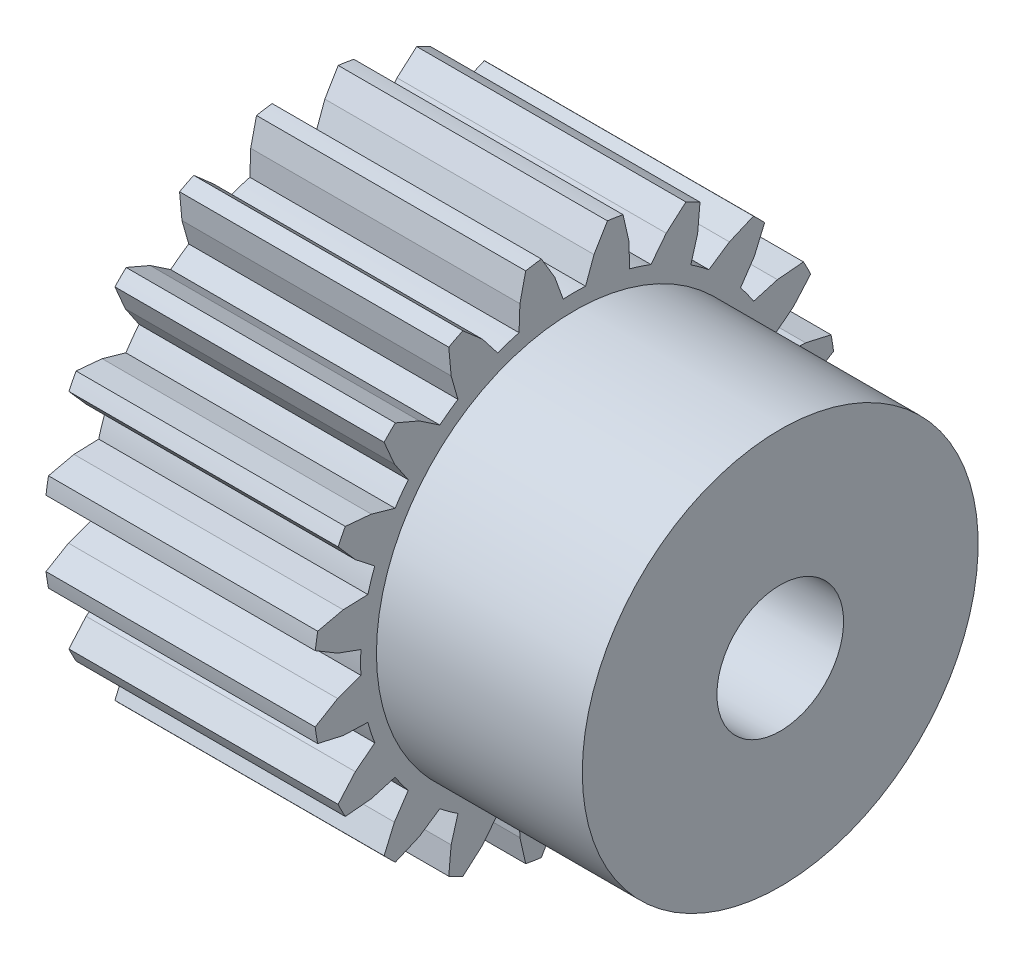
ISO-10303-21;
HEADER;
FILE_DESCRIPTION(('STEP AP214'),'2;1');
FILE_NAME('part.step','',(''),(''),'','','');
FILE_SCHEMA(('AUTOMOTIVE_DESIGN { 1 0 10303 214 1 1 1 1 }'));
ENDSEC;
DATA;
#1=APPLICATION_CONTEXT('core data for automotive mechanical design processes');
#2=APPLICATION_PROTOCOL_DEFINITION('international standard','automotive_design',2000,#1);
#3=PRODUCT_CONTEXT('',#1,'mechanical');
#4=PRODUCT('Part','Part','',(#3));
#5=PRODUCT_RELATED_PRODUCT_CATEGORY('part','',(#4));
#6=PRODUCT_DEFINITION_FORMATION('','',#4);
#7=PRODUCT_DEFINITION_CONTEXT('part definition',#1,'design');
#8=PRODUCT_DEFINITION('design','',#6,#7);
#9=PRODUCT_DEFINITION_SHAPE('','',#8);
#10=(LENGTH_UNIT() NAMED_UNIT(*) SI_UNIT(.MILLI.,.METRE.));
#11=(NAMED_UNIT(*) PLANE_ANGLE_UNIT() SI_UNIT($,.RADIAN.));
#12=(NAMED_UNIT(*) SI_UNIT($,.STERADIAN.) SOLID_ANGLE_UNIT());
#13=UNCERTAINTY_MEASURE_WITH_UNIT(LENGTH_MEASURE(1.E-05),#10,'distance_accuracy_value','');
#14=(GEOMETRIC_REPRESENTATION_CONTEXT(3) GLOBAL_UNCERTAINTY_ASSIGNED_CONTEXT((#13)) GLOBAL_UNIT_ASSIGNED_CONTEXT((#10,
#11,#12)) REPRESENTATION_CONTEXT('',''));
#15=CARTESIAN_POINT('',(0.,0.,0.));
#16=DIRECTION('',(0.,0.,1.));
#17=DIRECTION('',(1.,0.,0.));
#18=AXIS2_PLACEMENT_3D('',#15,#16,#17);
#19=CARTESIAN_POINT('',(-8.5,2.40042360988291E-13,5.49907341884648E-13));
#20=DIRECTION('',(-1.,0.,0.));
#21=DIRECTION('',(0.,0.,1.));
#22=AXIS2_PLACEMENT_3D('',#19,#20,#21);
#23=CYLINDRICAL_SURFACE('',#22,16.5000000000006);
#24=CARTESIAN_POINT('',(8.5,2.4E-13,5.5E-13));
#25=DIRECTION('',(-1.,0.,0.));
#26=DIRECTION('',(0.,-0.186292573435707,-0.982494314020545));
#27=AXIS2_PLACEMENT_3D('',#24,#25,#26);
#28=CIRCLE('',#27,16.5000000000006);
#29=CARTESIAN_POINT('',(8.5,-2.0861391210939,-16.3675906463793));
#30=VERTEX_POINT('',#29);
#31=CARTESIAN_POINT('',(8.5,-3.07382746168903,-16.211156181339));
#32=VERTEX_POINT('',#31);
#33=EDGE_CURVE('E849',#30,#32,#28,.T.);
#34=ORIENTED_EDGE('',*,*,#33,.T.);
#35=DIRECTION('',(-1.,0.,0.));
#36=VECTOR('',#35,1.);
#37=CARTESIAN_POINT('',(8.5,-3.07382746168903,-16.211156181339));
#38=LINE('',#37,#36);
#39=CARTESIAN_POINT('',(-8.5,-3.07382746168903,-16.211156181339));
#40=VERTEX_POINT('',#39);
#41=EDGE_CURVE('E843',#40,#32,#38,.F.);
#42=ORIENTED_EDGE('',*,*,#41,.F.);
#43=CARTESIAN_POINT('',(-8.5,2.4E-13,5.5E-13));
#44=DIRECTION('',(-1.,0.,0.));
#45=DIRECTION('',(0.,-0.186292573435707,-0.982494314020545));
#46=AXIS2_PLACEMENT_3D('',#43,#44,#45);
#47=CIRCLE('',#46,16.5000000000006);
#48=CARTESIAN_POINT('',(-8.5,-2.0861391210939,-16.3675906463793));
#49=VERTEX_POINT('',#48);
#50=EDGE_CURVE('E857',#40,#49,#47,.F.);
#51=ORIENTED_EDGE('',*,*,#50,.T.);
#52=DIRECTION('',(-1.,0.,0.));
#53=VECTOR('',#52,1.);
#54=CARTESIAN_POINT('',(8.5,-2.0861391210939,-16.3675906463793));
#55=LINE('',#54,#53);
#56=EDGE_CURVE('E820',#30,#49,#55,.T.);
#57=ORIENTED_EDGE('',*,*,#56,.F.);
#58=EDGE_LOOP('',(#34,#42,#51,#57));
#59=FACE_BOUND('',#58,.T.);
#60=ADVANCED_FACE('F15',(#59),#23,.T.);
#61=CARTESIAN_POINT('',(8.5,-3.07382746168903,-16.211156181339));
#62=DIRECTION('',(0.,-0.975179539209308,-0.221415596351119));
#63=DIRECTION('',(0.,-0.221415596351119,0.975179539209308));
#64=AXIS2_PLACEMENT_3D('',#61,#62,#63);
#65=PLANE('',#64);
#66=DIRECTION('',(0.,-0.221415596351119,0.975179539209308));
#67=VECTOR('',#66,1.);
#68=CARTESIAN_POINT('',(8.5,-3.25669846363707,-15.4057383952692));
#69=LINE('',#68,#67);
#70=CARTESIAN_POINT('',(8.5,-3.43956946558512,-14.6003206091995));
#71=VERTEX_POINT('',#70);
#72=EDGE_CURVE('E835',#32,#71,#69,.T.);
#73=ORIENTED_EDGE('',*,*,#72,.T.);
#74=DIRECTION('',(-1.,0.,0.));
#75=VECTOR('',#74,1.);
#76=CARTESIAN_POINT('',(8.5,-3.43956946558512,-14.6003206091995));
#77=LINE('',#76,#75);
#78=CARTESIAN_POINT('',(-8.5,-3.43956946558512,-14.6003206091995));
#79=VERTEX_POINT('',#78);
#80=EDGE_CURVE('E816',#79,#71,#77,.F.);
#81=ORIENTED_EDGE('',*,*,#80,.F.);
#82=DIRECTION('',(0.,0.221415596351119,-0.975179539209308));
#83=VECTOR('',#82,1.);
#84=CARTESIAN_POINT('',(-8.5,-3.25669846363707,-15.4057383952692));
#85=LINE('',#84,#83);
#86=EDGE_CURVE('E846',#79,#40,#85,.T.);
#87=ORIENTED_EDGE('',*,*,#86,.T.);
#88=ORIENTED_EDGE('',*,*,#41,.T.);
#89=EDGE_LOOP('',(#73,#81,#87,#88));
#90=FACE_BOUND('',#89,.T.);
#91=ADVANCED_FACE('F2489',(#90),#65,.T.);
#92=CARTESIAN_POINT('',(8.5,-1.24052223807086,-14.9486154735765));
#93=DIRECTION('',(0.,0.859029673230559,-0.511925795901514));
#94=DIRECTION('',(0.,-0.511925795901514,-0.859029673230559));
#95=AXIS2_PLACEMENT_3D('',#92,#93,#94);
#96=PLANE('',#95);
#97=DIRECTION('',(0.,-0.511925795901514,-0.859029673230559));
#98=VECTOR('',#97,1.);
#99=CARTESIAN_POINT('',(8.5,-1.66333067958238,-15.6581030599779));
#100=LINE('',#99,#98);
#101=CARTESIAN_POINT('',(8.5,-1.24052223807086,-14.9486154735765));
#102=VERTEX_POINT('',#101);
#103=EDGE_CURVE('E827',#102,#30,#100,.T.);
#104=ORIENTED_EDGE('',*,*,#103,.T.);
#105=ORIENTED_EDGE('',*,*,#56,.T.);
#106=DIRECTION('',(0.,0.511925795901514,0.859029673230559));
#107=VECTOR('',#106,1.);
#108=CARTESIAN_POINT('',(-8.5,-1.66333067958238,-15.6581030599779));
#109=LINE('',#108,#107);
#110=CARTESIAN_POINT('',(-8.5,-1.24052223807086,-14.9486154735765));
#111=VERTEX_POINT('',#110);
#112=EDGE_CURVE('E830',#49,#111,#109,.T.);
#113=ORIENTED_EDGE('',*,*,#112,.T.);
#114=DIRECTION('',(-1.,0.,0.));
#115=VECTOR('',#114,1.);
#116=CARTESIAN_POINT('',(8.5,-1.24052223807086,-14.9486154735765));
#117=LINE('',#116,#115);
#118=EDGE_CURVE('E760',#102,#111,#117,.T.);
#119=ORIENTED_EDGE('',*,*,#118,.F.);
#120=EDGE_LOOP('',(#104,#105,#113,#119));
#121=FACE_BOUND('',#120,.T.);
#122=ADVANCED_FACE('F2482',(#121),#96,.T.);
#123=CARTESIAN_POINT('',(8.5,-3.43956946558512,-14.6003206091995));
#124=DIRECTION('',(0.,-0.999390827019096,-0.0348994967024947));
#125=DIRECTION('',(0.,-0.0348994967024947,0.999390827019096));
#126=AXIS2_PLACEMENT_3D('',#123,#124,#125);
#127=PLANE('',#126);
#128=DIRECTION('',(0.,-0.0348994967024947,0.999390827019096));
#129=VECTOR('',#128,1.);
#130=CARTESIAN_POINT('',(8.5,-3.46681328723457,-13.8201596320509));
#131=LINE('',#130,#129);
#132=CARTESIAN_POINT('',(8.5,-3.49405710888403,-13.0399986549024));
#133=VERTEX_POINT('',#132);
#134=EDGE_CURVE('E811',#71,#133,#131,.T.);
#135=ORIENTED_EDGE('',*,*,#134,.T.);
#136=DIRECTION('',(1.,0.,0.));
#137=VECTOR('',#136,1.);
#138=CARTESIAN_POINT('',(0.,-3.49405710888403,-13.0399986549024));
#139=LINE('',#138,#137);
#140=CARTESIAN_POINT('',(-8.5,-3.49405710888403,-13.0399986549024));
#141=VERTEX_POINT('',#140);
#142=EDGE_CURVE('E759',#141,#133,#139,.T.);
#143=ORIENTED_EDGE('',*,*,#142,.F.);
#144=DIRECTION('',(0.,0.0348994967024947,-0.999390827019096));
#145=VECTOR('',#144,1.);
#146=CARTESIAN_POINT('',(-8.5,-3.46681328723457,-13.8201596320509));
#147=LINE('',#146,#145);
#148=EDGE_CURVE('E755',#141,#79,#147,.T.);
#149=ORIENTED_EDGE('',*,*,#148,.T.);
#150=ORIENTED_EDGE('',*,*,#80,.T.);
#151=EDGE_LOOP('',(#135,#143,#149,#150));
#152=FACE_BOUND('',#151,.T.);
#153=ADVANCED_FACE('F2492',(#152),#127,.T.);
#154=CARTESIAN_POINT('',(8.5,-0.70653540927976,-13.4814987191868));
#155=DIRECTION('',(0.,0.939692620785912,-0.342020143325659));
#156=DIRECTION('',(0.,-0.342020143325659,-0.939692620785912));
#157=AXIS2_PLACEMENT_3D('',#154,#155,#156);
#158=PLANE('',#157);
#159=DIRECTION('',(0.,-0.342020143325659,-0.939692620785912));
#160=VECTOR('',#159,1.);
#161=CARTESIAN_POINT('',(8.5,-0.97352882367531,-14.2150570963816));
#162=LINE('',#161,#160);
#163=CARTESIAN_POINT('',(8.5,-0.70653540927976,-13.4814987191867));
#164=VERTEX_POINT('',#163);
#165=EDGE_CURVE('E803',#164,#102,#162,.T.);
#166=ORIENTED_EDGE('',*,*,#165,.T.);
#167=ORIENTED_EDGE('',*,*,#118,.T.);
#168=DIRECTION('',(0.,0.342020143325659,0.939692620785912));
#169=VECTOR('',#168,1.);
#170=CARTESIAN_POINT('',(-8.5,-0.97352882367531,-14.2150570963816));
#171=LINE('',#170,#169);
#172=CARTESIAN_POINT('',(-8.5,-0.70653540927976,-13.4814987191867));
#173=VERTEX_POINT('',#172);
#174=EDGE_CURVE('E806',#111,#173,#171,.T.);
#175=ORIENTED_EDGE('',*,*,#174,.T.);
#176=DIRECTION('',(-1.,0.,0.));
#177=VECTOR('',#176,1.);
#178=CARTESIAN_POINT('',(0.,-0.70653540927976,-13.4814987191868));
#179=LINE('',#178,#177);
#180=EDGE_CURVE('E774',#164,#173,#179,.T.);
#181=ORIENTED_EDGE('',*,*,#180,.F.);
#182=EDGE_LOOP('',(#166,#167,#175,#181));
#183=FACE_BOUND('',#182,.T.);
#184=ADVANCED_FACE('F2479',(#183),#158,.T.);
#185=CARTESIAN_POINT('',(-8.5,-3.79904441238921E-13,-1.09027370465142E-12));
#186=DIRECTION('',(-1.,0.,0.));
#187=DIRECTION('',(0.,0.,1.));
#188=AXIS2_PLACEMENT_3D('',#185,#186,#187);
#189=CYLINDRICAL_SURFACE('',#188,13.4999999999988);
#190=CARTESIAN_POINT('',(8.5,-3.79904441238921E-13,-1.09027370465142E-12));
#191=DIRECTION('',(-1.,0.,0.));
#192=DIRECTION('',(0.,0.,1.));
#193=AXIS2_PLACEMENT_3D('',#190,#191,#192);
#194=CIRCLE('',#193,13.4999999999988);
#195=CARTESIAN_POINT('',(8.5,-4.83796731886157,-12.6033357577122));
#196=VERTEX_POINT('',#195);
#197=EDGE_CURVE('E765',#133,#196,#194,.T.);
#198=ORIENTED_EDGE('',*,*,#197,.T.);
#199=DIRECTION('',(-1.,0.,0.));
#200=VECTOR('',#199,1.);
#201=CARTESIAN_POINT('',(8.5,-4.83796731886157,-12.6033357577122));
#202=LINE('',#201,#200);
#203=CARTESIAN_POINT('',(-8.5,-4.83796731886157,-12.6033357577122));
#204=VERTEX_POINT('',#203);
#205=EDGE_CURVE('E762',#204,#196,#202,.F.);
#206=ORIENTED_EDGE('',*,*,#205,.F.);
#207=CARTESIAN_POINT('',(-8.5,-3.79904441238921E-13,-1.09027370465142E-12));
#208=DIRECTION('',(-1.,0.,0.));
#209=DIRECTION('',(0.,0.,1.));
#210=AXIS2_PLACEMENT_3D('',#207,#208,#209);
#211=CIRCLE('',#210,13.4999999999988);
#212=EDGE_CURVE('E18',#204,#141,#211,.F.);
#213=ORIENTED_EDGE('',*,*,#212,.T.);
#214=ORIENTED_EDGE('',*,*,#142,.T.);
#215=EDGE_LOOP('',(#198,#206,#213,#214));
#216=FACE_BOUND('',#215,.T.);
#217=ADVANCED_FACE('F763',(#216),#189,.T.);
#218=CARTESIAN_POINT('',(-8.5,0.,-1.39645239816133E-13));
#219=DIRECTION('',(-1.,0.,0.));
#220=DIRECTION('',(0.,0.,1.));
#221=AXIS2_PLACEMENT_3D('',#218,#219,#220);
#222=CYLINDRICAL_SURFACE('',#221,13.4999999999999);
#223=CARTESIAN_POINT('',(8.5,0.,-1.4E-13));
#224=DIRECTION('',(-1.,0.,0.));
#225=DIRECTION('',(0.,-0.0523359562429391,-0.998629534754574));
#226=AXIS2_PLACEMENT_3D('',#223,#224,#225);
#227=CIRCLE('',#226,13.4999999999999);
#228=CARTESIAN_POINT('',(8.5,0.70653540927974,-13.4814987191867));
#229=VERTEX_POINT('',#228);
#230=EDGE_CURVE('E777',#229,#164,#227,.T.);
#231=ORIENTED_EDGE('',*,*,#230,.T.);
#232=ORIENTED_EDGE('',*,*,#180,.T.);
#233=CARTESIAN_POINT('',(-8.5,0.,-1.4E-13));
#234=DIRECTION('',(-1.,0.,0.));
#235=DIRECTION('',(0.,-0.0523359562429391,-0.998629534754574));
#236=AXIS2_PLACEMENT_3D('',#233,#234,#235);
#237=CIRCLE('',#236,13.4999999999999);
#238=CARTESIAN_POINT('',(-8.5,0.70653540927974,-13.4814987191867));
#239=VERTEX_POINT('',#238);
#240=EDGE_CURVE('E794',#173,#239,#237,.F.);
#241=ORIENTED_EDGE('',*,*,#240,.T.);
#242=DIRECTION('',(-1.,0.,0.));
#243=VECTOR('',#242,1.);
#244=CARTESIAN_POINT('',(8.5,0.70653540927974,-13.4814987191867));
#245=LINE('',#244,#243);
#246=EDGE_CURVE('E785',#229,#239,#245,.T.);
#247=ORIENTED_EDGE('',*,*,#246,.F.);
#248=EDGE_LOOP('',(#231,#232,#241,#247));
#249=FACE_BOUND('',#248,.T.);
#250=ADVANCED_FACE('F2476',(#249),#222,.T.);
#251=CARTESIAN_POINT('',(8.5,-4.83796731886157,-12.6033357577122));
#252=DIRECTION('',(0.,0.788010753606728,-0.61566147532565));
#253=DIRECTION('',(0.,-0.61566147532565,-0.788010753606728));
#254=AXIS2_PLACEMENT_3D('',#251,#252,#253);
#255=PLANE('',#254);
#256=DIRECTION('',(0.,-0.61566147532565,-0.788010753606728));
#257=VECTOR('',#256,1.);
#258=CARTESIAN_POINT('',(8.5,-5.31857515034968,-13.2184857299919));
#259=LINE('',#258,#257);
#260=CARTESIAN_POINT('',(8.5,-5.79918298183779,-13.8336357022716));
#261=VERTEX_POINT('',#260);
#262=EDGE_CURVE('E768',#196,#261,#259,.T.);
#263=ORIENTED_EDGE('',*,*,#262,.T.);
#264=DIRECTION('',(-1.,0.,0.));
#265=VECTOR('',#264,1.);
#266=CARTESIAN_POINT('',(8.5,-5.79918298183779,-13.8336357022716));
#267=LINE('',#266,#265);
#268=CARTESIAN_POINT('',(-8.5,-5.79918298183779,-13.8336357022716));
#269=VERTEX_POINT('',#268);
#270=EDGE_CURVE('E772',#269,#261,#267,.F.);
#271=ORIENTED_EDGE('',*,*,#270,.F.);
#272=DIRECTION('',(0.,0.61566147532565,0.788010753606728));
#273=VECTOR('',#272,1.);
#274=CARTESIAN_POINT('',(-8.5,-5.31857515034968,-13.2184857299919));
#275=LINE('',#274,#273);
#276=EDGE_CURVE('E752',#269,#204,#275,.T.);
#277=ORIENTED_EDGE('',*,*,#276,.T.);
#278=ORIENTED_EDGE('',*,*,#205,.T.);
#279=EDGE_LOOP('',(#263,#271,#277,#278));
#280=FACE_BOUND('',#279,.T.);
#281=ADVANCED_FACE('F770',(#280),#255,.T.);
#282=CARTESIAN_POINT('',(8.5,1.24052223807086,-14.9486154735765));
#283=DIRECTION('',(0.,-0.939692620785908,-0.342020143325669));
#284=DIRECTION('',(0.,-0.342020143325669,0.939692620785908));
#285=AXIS2_PLACEMENT_3D('',#282,#283,#284);
#286=PLANE('',#285);
#287=DIRECTION('',(0.,-0.342020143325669,0.939692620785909));
#288=VECTOR('',#287,1.);
#289=CARTESIAN_POINT('',(8.5,0.9735288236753,-14.2150570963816));
#290=LINE('',#289,#288);
#291=CARTESIAN_POINT('',(8.5,1.24052223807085,-14.9486154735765));
#292=VERTEX_POINT('',#291);
#293=EDGE_CURVE('E789',#292,#229,#290,.T.);
#294=ORIENTED_EDGE('',*,*,#293,.T.);
#295=ORIENTED_EDGE('',*,*,#246,.T.);
#296=DIRECTION('',(0.,0.342020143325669,-0.939692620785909));
#297=VECTOR('',#296,1.);
#298=CARTESIAN_POINT('',(-8.5,0.9735288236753,-14.2150570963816));
#299=LINE('',#298,#297);
#300=CARTESIAN_POINT('',(-8.5,1.24052223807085,-14.9486154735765));
#301=VERTEX_POINT('',#300);
#302=EDGE_CURVE('E1106',#239,#301,#299,.T.);
#303=ORIENTED_EDGE('',*,*,#302,.T.);
#304=DIRECTION('',(-1.,0.,0.));
#305=VECTOR('',#304,1.);
#306=CARTESIAN_POINT('',(8.5,1.24052223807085,-14.9486154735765));
#307=LINE('',#306,#305);
#308=EDGE_CURVE('E1072',#292,#301,#307,.T.);
#309=ORIENTED_EDGE('',*,*,#308,.F.);
#310=EDGE_LOOP('',(#294,#295,#303,#309));
#311=FACE_BOUND('',#310,.T.);
#312=ADVANCED_FACE('F2473',(#311),#286,.T.);
#313=CARTESIAN_POINT('',(8.5,-5.79918298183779,-13.8336357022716));
#314=DIRECTION('',(0.,0.658791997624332,-0.752325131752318));
#315=DIRECTION('',(0.,-0.752325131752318,-0.658791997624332));
#316=AXIS2_PLACEMENT_3D('',#313,#314,#315);
#317=PLANE('',#316);
#318=DIRECTION('',(0.,-0.752325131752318,-0.658791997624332));
#319=VECTOR('',#318,1.);
#320=CARTESIAN_POINT('',(8.5,-6.420541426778,-14.3777435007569));
#321=LINE('',#320,#319);
#322=CARTESIAN_POINT('',(8.5,-7.04189987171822,-14.9218512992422));
#323=VERTEX_POINT('',#322);
#324=EDGE_CURVE('E1087',#261,#323,#321,.T.);
#325=ORIENTED_EDGE('',*,*,#324,.T.);
#326=DIRECTION('',(1.,0.,0.));
#327=VECTOR('',#326,1.);
#328=CARTESIAN_POINT('',(0.,-7.04189987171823,-14.9218512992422));
#329=LINE('',#328,#327);
#330=CARTESIAN_POINT('',(-8.5,-7.04189987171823,-14.9218512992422));
#331=VERTEX_POINT('',#330);
#332=EDGE_CURVE('E1066',#331,#323,#329,.T.);
#333=ORIENTED_EDGE('',*,*,#332,.F.);
#334=DIRECTION('',(0.,0.752325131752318,0.658791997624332));
#335=VECTOR('',#334,1.);
#336=CARTESIAN_POINT('',(-8.5,-6.420541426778,-14.3777435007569));
#337=LINE('',#336,#335);
#338=EDGE_CURVE('E788',#331,#269,#337,.T.);
#339=ORIENTED_EDGE('',*,*,#338,.T.);
#340=ORIENTED_EDGE('',*,*,#270,.T.);
#341=EDGE_LOOP('',(#325,#333,#339,#340));
#342=FACE_BOUND('',#341,.T.);
#343=ADVANCED_FACE('F1121',(#342),#317,.T.);
#344=CARTESIAN_POINT('',(8.5,2.08613912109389,-16.3675906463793));
#345=DIRECTION('',(0.,-0.859029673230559,-0.511925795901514));
#346=DIRECTION('',(0.,-0.511925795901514,0.859029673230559));
#347=AXIS2_PLACEMENT_3D('',#344,#345,#346);
#348=PLANE('',#347);
#349=DIRECTION('',(0.,-0.511925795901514,0.859029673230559));
#350=VECTOR('',#349,1.);
#351=CARTESIAN_POINT('',(8.5,1.66333067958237,-15.6581030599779));
#352=LINE('',#351,#350);
#353=CARTESIAN_POINT('',(8.5,2.08613912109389,-16.3675906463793));
#354=VERTEX_POINT('',#353);
#355=EDGE_CURVE('E1079',#354,#292,#352,.T.);
#356=ORIENTED_EDGE('',*,*,#355,.T.);
#357=ORIENTED_EDGE('',*,*,#308,.T.);
#358=DIRECTION('',(0.,0.511925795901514,-0.859029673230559));
#359=VECTOR('',#358,1.);
#360=CARTESIAN_POINT('',(-8.5,1.66333067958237,-15.6581030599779));
#361=LINE('',#360,#359);
#362=CARTESIAN_POINT('',(-8.5,2.08613912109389,-16.3675906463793));
#363=VERTEX_POINT('',#362);
#364=EDGE_CURVE('E1082',#301,#363,#361,.T.);
#365=ORIENTED_EDGE('',*,*,#364,.T.);
#366=DIRECTION('',(-1.,0.,0.));
#367=VECTOR('',#366,1.);
#368=CARTESIAN_POINT('',(0.,2.08613912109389,-16.3675906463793));
#369=LINE('',#368,#367);
#370=EDGE_CURVE('E1043',#354,#363,#369,.T.);
#371=ORIENTED_EDGE('',*,*,#370,.F.);
#372=EDGE_LOOP('',(#356,#357,#365,#371));
#373=FACE_BOUND('',#372,.T.);
#374=ADVANCED_FACE('F2470',(#373),#348,.T.);
#375=CARTESIAN_POINT('',(-8.5,-3.59955121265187E-13,-1.26027660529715E-12));
#376=DIRECTION('',(-1.,0.,0.));
#377=DIRECTION('',(0.,0.,1.));
#378=AXIS2_PLACEMENT_3D('',#375,#376,#377);
#379=CYLINDRICAL_SURFACE('',#378,16.4999999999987);
#380=CARTESIAN_POINT('',(8.5,-3.6E-13,-1.26E-12));
#381=DIRECTION('',(-1.,0.,0.));
#382=DIRECTION('',(0.,-0.480782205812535,-0.876840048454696));
#383=AXIS2_PLACEMENT_3D('',#380,#381,#382);
#384=CIRCLE('',#383,16.4999999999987);
#385=CARTESIAN_POINT('',(8.5,-7.93290639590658,-14.4678607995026));
#386=VERTEX_POINT('',#385);
#387=EDGE_CURVE('E1058',#323,#386,#384,.T.);
#388=ORIENTED_EDGE('',*,*,#387,.T.);
#389=DIRECTION('',(-1.,0.,0.));
#390=VECTOR('',#389,1.);
#391=CARTESIAN_POINT('',(8.5,-7.93290639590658,-14.4678607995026));
#392=LINE('',#391,#390);
#393=CARTESIAN_POINT('',(-8.5,-7.93290639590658,-14.4678607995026));
#394=VERTEX_POINT('',#393);
#395=EDGE_CURVE('E1037',#394,#386,#392,.F.);
#396=ORIENTED_EDGE('',*,*,#395,.F.);
#397=CARTESIAN_POINT('',(-8.5,-3.6E-13,-1.26E-12));
#398=DIRECTION('',(-1.,0.,0.));
#399=DIRECTION('',(0.,-0.480782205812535,-0.876840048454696));
#400=AXIS2_PLACEMENT_3D('',#397,#398,#399);
#401=CIRCLE('',#400,16.4999999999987);
#402=EDGE_CURVE('E1069',#394,#331,#401,.F.);
#403=ORIENTED_EDGE('',*,*,#402,.T.);
#404=ORIENTED_EDGE('',*,*,#332,.T.);
#405=EDGE_LOOP('',(#388,#396,#403,#404));
#406=FACE_BOUND('',#405,.T.);
#407=ADVANCED_FACE('F1125',(#406),#379,.T.);
#408=CARTESIAN_POINT('',(-8.5,-1.51007678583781E-12,7.0603245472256E-12));
#409=DIRECTION('',(-1.,0.,0.));
#410=DIRECTION('',(0.,0.,1.));
#411=AXIS2_PLACEMENT_3D('',#408,#409,#410);
#412=CYLINDRICAL_SURFACE('',#411,16.5000000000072);
#413=CARTESIAN_POINT('',(8.5,-1.51E-12,7.06E-12));
#414=DIRECTION('',(-1.,0.,0.));
#415=DIRECTION('',(0.,0.126432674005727,-0.991975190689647));
#416=AXIS2_PLACEMENT_3D('',#413,#414,#415);
#417=CIRCLE('',#416,16.5000000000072);
#418=CARTESIAN_POINT('',(8.5,3.07382746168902,-16.211156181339));
#419=VERTEX_POINT('',#418);
#420=EDGE_CURVE('E1050',#419,#354,#417,.T.);
#421=ORIENTED_EDGE('',*,*,#420,.T.);
#422=ORIENTED_EDGE('',*,*,#370,.T.);
#423=CARTESIAN_POINT('',(-8.5,-1.51E-12,7.06E-12));
#424=DIRECTION('',(-1.,0.,0.));
#425=DIRECTION('',(0.,0.126432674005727,-0.991975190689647));
#426=AXIS2_PLACEMENT_3D('',#423,#424,#425);
#427=CIRCLE('',#426,16.5000000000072);
#428=CARTESIAN_POINT('',(-8.5,3.07382746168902,-16.211156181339));
#429=VERTEX_POINT('',#428);
#430=EDGE_CURVE('E1053',#363,#429,#427,.F.);
#431=ORIENTED_EDGE('',*,*,#430,.T.);
#432=DIRECTION('',(-1.,0.,0.));
#433=VECTOR('',#432,1.);
#434=CARTESIAN_POINT('',(8.5,3.07382746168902,-16.211156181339));
#435=LINE('',#434,#433);
#436=EDGE_CURVE('E1020',#419,#429,#435,.T.);
#437=ORIENTED_EDGE('',*,*,#436,.F.);
#438=EDGE_LOOP('',(#421,#422,#431,#437));
#439=FACE_BOUND('',#438,.T.);
#440=ADVANCED_FACE('F2467',(#439),#412,.T.);
#441=CARTESIAN_POINT('',(8.5,-7.93290639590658,-14.4678607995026));
#442=DIRECTION('',(0.,-0.995872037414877,0.0907683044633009));
#443=DIRECTION('',(0.,0.0907683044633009,0.995872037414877));
#444=AXIS2_PLACEMENT_3D('',#441,#442,#443);
#445=PLANE('',#444);
#446=DIRECTION('',(0.,0.0907683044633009,0.995872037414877));
#447=VECTOR('',#446,1.);
#448=CARTESIAN_POINT('',(8.5,-7.85793927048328,-13.6453527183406));
#449=LINE('',#448,#447);
#450=CARTESIAN_POINT('',(8.5,-7.78297214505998,-12.8228446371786));
#451=VERTEX_POINT('',#450);
#452=EDGE_CURVE('E1026',#386,#451,#449,.T.);
#453=ORIENTED_EDGE('',*,*,#452,.T.);
#454=DIRECTION('',(-1.,0.,0.));
#455=VECTOR('',#454,1.);
#456=CARTESIAN_POINT('',(8.5,-7.78297214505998,-12.8228446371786));
#457=LINE('',#456,#455);
#458=CARTESIAN_POINT('',(-8.5,-7.78297214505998,-12.8228446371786));
#459=VERTEX_POINT('',#458);
#460=EDGE_CURVE('E1029',#459,#451,#457,.F.);
#461=ORIENTED_EDGE('',*,*,#460,.F.);
#462=DIRECTION('',(0.,-0.0907683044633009,-0.995872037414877));
#463=VECTOR('',#462,1.);
#464=CARTESIAN_POINT('',(-8.5,-7.85793927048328,-13.6453527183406));
#465=LINE('',#464,#463);
#466=EDGE_CURVE('E1040',#459,#394,#465,.T.);
#467=ORIENTED_EDGE('',*,*,#466,.T.);
#468=ORIENTED_EDGE('',*,*,#395,.T.);
#469=EDGE_LOOP('',(#453,#461,#467,#468));
#470=FACE_BOUND('',#469,.T.);
#471=ADVANCED_FACE('F1127',(#470),#445,.T.);
#472=CARTESIAN_POINT('',(8.5,3.4395694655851,-14.6003206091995));
#473=DIRECTION('',(0.,0.975179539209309,-0.221415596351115));
#474=DIRECTION('',(0.,-0.221415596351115,-0.975179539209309));
#475=AXIS2_PLACEMENT_3D('',#472,#473,#474);
#476=PLANE('',#475);
#477=DIRECTION('',(0.,-0.221415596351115,-0.975179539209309));
#478=VECTOR('',#477,1.);
#479=CARTESIAN_POINT('',(8.5,3.25669846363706,-15.4057383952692));
#480=LINE('',#479,#478);
#481=CARTESIAN_POINT('',(8.5,3.43956946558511,-14.6003206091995));
#482=VERTEX_POINT('',#481);
#483=EDGE_CURVE('E1017',#482,#419,#480,.T.);
#484=ORIENTED_EDGE('',*,*,#483,.T.);
#485=ORIENTED_EDGE('',*,*,#436,.T.);
#486=DIRECTION('',(0.,0.221415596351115,0.975179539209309));
#487=VECTOR('',#486,1.);
#488=CARTESIAN_POINT('',(-8.5,3.25669846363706,-15.4057383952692));
#489=LINE('',#488,#487);
#490=CARTESIAN_POINT('',(-8.5,3.43956946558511,-14.6003206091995));
#491=VERTEX_POINT('',#490);
#492=EDGE_CURVE('E1021',#429,#491,#489,.T.);
#493=ORIENTED_EDGE('',*,*,#492,.T.);
#494=DIRECTION('',(-1.,0.,0.));
#495=VECTOR('',#494,1.);
#496=CARTESIAN_POINT('',(8.5,3.43956946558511,-14.6003206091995));
#497=LINE('',#496,#495);
#498=EDGE_CURVE('E997',#482,#491,#497,.T.);
#499=ORIENTED_EDGE('',*,*,#498,.F.);
#500=EDGE_LOOP('',(#484,#485,#493,#499));
#501=FACE_BOUND('',#500,.T.);
#502=ADVANCED_FACE('F2465',(#501),#476,.T.);
#503=CARTESIAN_POINT('',(8.5,-7.78297214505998,-12.8228446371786));
#504=DIRECTION('',(0.,-0.961261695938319,0.275637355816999));
#505=DIRECTION('',(0.,0.275637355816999,0.961261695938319));
#506=AXIS2_PLACEMENT_3D('',#503,#504,#505);
#507=PLANE('',#506);
#508=DIRECTION('',(0.,0.275637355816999,0.961261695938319));
#509=VECTOR('',#508,1.);
#510=CARTESIAN_POINT('',(8.5,-7.56779955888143,-12.0724486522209));
#511=LINE('',#510,#509);
#512=CARTESIAN_POINT('',(8.5,-7.35262697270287,-11.3220526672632));
#513=VERTEX_POINT('',#512);
#514=EDGE_CURVE('E1032',#451,#513,#511,.T.);
#515=ORIENTED_EDGE('',*,*,#514,.T.);
#516=DIRECTION('',(1.,0.,0.));
#517=VECTOR('',#516,1.);
#518=CARTESIAN_POINT('',(0.,-7.35262697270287,-11.3220526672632));
#519=LINE('',#518,#517);
#520=CARTESIAN_POINT('',(-8.5,-7.35262697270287,-11.3220526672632));
#521=VERTEX_POINT('',#520);
#522=EDGE_CURVE('E994',#521,#513,#519,.T.);
#523=ORIENTED_EDGE('',*,*,#522,.F.);
#524=DIRECTION('',(0.,-0.275637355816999,-0.961261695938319));
#525=VECTOR('',#524,1.);
#526=CARTESIAN_POINT('',(-8.5,-7.56779955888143,-12.0724486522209));
#527=LINE('',#526,#525);
#528=EDGE_CURVE('E1033',#521,#459,#527,.T.);
#529=ORIENTED_EDGE('',*,*,#528,.T.);
#530=ORIENTED_EDGE('',*,*,#460,.T.);
#531=EDGE_LOOP('',(#515,#523,#529,#530));
#532=FACE_BOUND('',#531,.T.);
#533=ADVANCED_FACE('F1132',(#532),#507,.T.);
#534=CARTESIAN_POINT('',(8.5,3.49405710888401,-13.0399986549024));
#535=DIRECTION('',(0.,0.999390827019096,-0.0348994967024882));
#536=DIRECTION('',(0.,-0.0348994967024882,-0.999390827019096));
#537=AXIS2_PLACEMENT_3D('',#534,#535,#536);
#538=PLANE('',#537);
#539=DIRECTION('',(0.,-0.0348994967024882,-0.999390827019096));
#540=VECTOR('',#539,1.);
#541=CARTESIAN_POINT('',(8.5,3.46681328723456,-13.8201596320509));
#542=LINE('',#541,#540);
#543=CARTESIAN_POINT('',(8.5,3.49405710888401,-13.0399986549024));
#544=VERTEX_POINT('',#543);
#545=EDGE_CURVE('E1003',#544,#482,#542,.T.);
#546=ORIENTED_EDGE('',*,*,#545,.T.);
#547=ORIENTED_EDGE('',*,*,#498,.T.);
#548=DIRECTION('',(0.,0.0348994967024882,0.999390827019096));
#549=VECTOR('',#548,1.);
#550=CARTESIAN_POINT('',(-8.5,3.46681328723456,-13.8201596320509));
#551=LINE('',#550,#549);
#552=CARTESIAN_POINT('',(-8.5,3.49405710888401,-13.0399986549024));
#553=VERTEX_POINT('',#552);
#554=EDGE_CURVE('E1009',#491,#553,#551,.T.);
#555=ORIENTED_EDGE('',*,*,#554,.T.);
#556=DIRECTION('',(-1.,0.,0.));
#557=VECTOR('',#556,1.);
#558=CARTESIAN_POINT('',(0.,3.49405710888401,-13.0399986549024));
#559=LINE('',#558,#557);
#560=EDGE_CURVE('E988',#544,#553,#559,.T.);
#561=ORIENTED_EDGE('',*,*,#560,.F.);
#562=EDGE_LOOP('',(#546,#547,#555,#561));
#563=FACE_BOUND('',#562,.T.);
#564=ADVANCED_FACE('F2462',(#563),#538,.T.);
#565=CARTESIAN_POINT('',(-8.5,-5.89805981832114E-13,-7.39859562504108E-13));
#566=DIRECTION('',(-1.,0.,0.));
#567=DIRECTION('',(0.,0.,1.));
#568=AXIS2_PLACEMENT_3D('',#565,#566,#567);
#569=CYLINDRICAL_SURFACE('',#568,13.4999999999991);
#570=CARTESIAN_POINT('',(8.5,-5.89805981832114E-13,-7.39859562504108E-13));
#571=DIRECTION('',(-1.,0.,0.));
#572=DIRECTION('',(0.,0.,1.));
#573=AXIS2_PLACEMENT_3D('',#570,#571,#572);
#574=CIRCLE('',#573,13.4999999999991);
#575=CARTESIAN_POINT('',(8.5,-8.49582527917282,-10.4914704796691));
#576=VERTEX_POINT('',#575);
#577=EDGE_CURVE('E992',#513,#576,#574,.T.);
#578=ORIENTED_EDGE('',*,*,#577,.T.);
#579=DIRECTION('',(-1.,0.,0.));
#580=VECTOR('',#579,1.);
#581=CARTESIAN_POINT('',(8.5,-8.49582527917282,-10.4914704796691));
#582=LINE('',#581,#580);
#583=CARTESIAN_POINT('',(-8.5,-8.49582527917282,-10.4914704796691));
#584=VERTEX_POINT('',#583);
#585=EDGE_CURVE('E1145',#584,#576,#582,.F.);
#586=ORIENTED_EDGE('',*,*,#585,.F.);
#587=CARTESIAN_POINT('',(-8.5,-5.89805981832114E-13,-7.39859562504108E-13));
#588=DIRECTION('',(-1.,0.,0.));
#589=DIRECTION('',(0.,0.,1.));
#590=AXIS2_PLACEMENT_3D('',#587,#588,#589);
#591=CIRCLE('',#590,13.4999999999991);
#592=EDGE_CURVE('E995',#584,#521,#591,.F.);
#593=ORIENTED_EDGE('',*,*,#592,.T.);
#594=ORIENTED_EDGE('',*,*,#522,.T.);
#595=EDGE_LOOP('',(#578,#586,#593,#594));
#596=FACE_BOUND('',#595,.T.);
#597=ADVANCED_FACE('F2865',(#596),#569,.T.);
#598=CARTESIAN_POINT('',(-8.5,0.,0.));
#599=DIRECTION('',(-1.,0.,0.));
#600=DIRECTION('',(0.,0.,1.));
#601=AXIS2_PLACEMENT_3D('',#598,#599,#600);
#602=CYLINDRICAL_SURFACE('',#601,13.4999999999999);
#603=CARTESIAN_POINT('',(8.5,0.,0.));
#604=DIRECTION('',(-1.,0.,0.));
#605=DIRECTION('',(0.,0.,1.));
#606=AXIS2_PLACEMENT_3D('',#603,#604,#605);
#607=CIRCLE('',#606,13.4999999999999);
#608=CARTESIAN_POINT('',(8.5,4.83796731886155,-12.6033357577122));
#609=VERTEX_POINT('',#608);
#610=EDGE_CURVE('E985',#609,#544,#607,.T.);
#611=ORIENTED_EDGE('',*,*,#610,.T.);
#612=ORIENTED_EDGE('',*,*,#560,.T.);
#613=CARTESIAN_POINT('',(-8.5,0.,0.));
#614=DIRECTION('',(-1.,0.,0.));
#615=DIRECTION('',(0.,0.,1.));
#616=AXIS2_PLACEMENT_3D('',#613,#614,#615);
#617=CIRCLE('',#616,13.4999999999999);
#618=CARTESIAN_POINT('',(-8.5,4.83796731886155,-12.6033357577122));
#619=VERTEX_POINT('',#618);
#620=EDGE_CURVE('E989',#553,#619,#617,.F.);
#621=ORIENTED_EDGE('',*,*,#620,.T.);
#622=DIRECTION('',(-1.,0.,0.));
#623=VECTOR('',#622,1.);
#624=CARTESIAN_POINT('',(8.5,4.83796731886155,-12.6033357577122));
#625=LINE('',#624,#623);
#626=EDGE_CURVE('E1149',#609,#619,#625,.T.);
#627=ORIENTED_EDGE('',*,*,#626,.F.);
#628=EDGE_LOOP('',(#611,#612,#621,#627));
#629=FACE_BOUND('',#628,.T.);
#630=ADVANCED_FACE('F2460',(#629),#602,.T.);
#631=CARTESIAN_POINT('',(8.5,-8.49582527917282,-10.4914704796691));
#632=DIRECTION('',(0.,0.559192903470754,-0.829037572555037));
#633=DIRECTION('',(0.,-0.829037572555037,-0.559192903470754));
#634=AXIS2_PLACEMENT_3D('',#631,#632,#633);
#635=PLANE('',#634);
#636=DIRECTION('',(0.,-0.829037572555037,-0.559192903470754));
#637=VECTOR('',#636,1.);
#638=CARTESIAN_POINT('',(8.5,-9.14300228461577,-10.927996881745));
#639=LINE('',#638,#637);
#640=CARTESIAN_POINT('',(8.5,-9.79017929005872,-11.3645232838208));
#641=VERTEX_POINT('',#640);
#642=EDGE_CURVE('E1148',#576,#641,#639,.T.);
#643=ORIENTED_EDGE('',*,*,#642,.T.);
#644=DIRECTION('',(-1.,0.,0.));
#645=VECTOR('',#644,1.);
#646=CARTESIAN_POINT('',(8.5,-9.79017929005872,-11.3645232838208));
#647=LINE('',#646,#645);
#648=CARTESIAN_POINT('',(-8.5,-9.79017929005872,-11.3645232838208));
#649=VERTEX_POINT('',#648);
#650=EDGE_CURVE('E1164',#649,#641,#647,.F.);
#651=ORIENTED_EDGE('',*,*,#650,.F.);
#652=DIRECTION('',(0.,0.829037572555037,0.559192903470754));
#653=VECTOR('',#652,1.);
#654=CARTESIAN_POINT('',(-8.5,-9.14300228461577,-10.927996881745));
#655=LINE('',#654,#653);
#656=EDGE_CURVE('E1144',#649,#584,#655,.T.);
#657=ORIENTED_EDGE('',*,*,#656,.T.);
#658=ORIENTED_EDGE('',*,*,#585,.T.);
#659=EDGE_LOOP('',(#643,#651,#657,#658));
#660=FACE_BOUND('',#659,.T.);
#661=ADVANCED_FACE('F2859',(#660),#635,.T.);
#662=CARTESIAN_POINT('',(8.5,5.79918298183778,-13.8336357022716));
#663=DIRECTION('',(0.,-0.788010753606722,-0.615661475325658));
#664=DIRECTION('',(0.,-0.615661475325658,0.788010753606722));
#665=AXIS2_PLACEMENT_3D('',#662,#663,#664);
#666=PLANE('',#665);
#667=DIRECTION('',(0.,-0.615661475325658,0.788010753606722));
#668=VECTOR('',#667,1.);
#669=CARTESIAN_POINT('',(8.5,5.31857515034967,-13.2184857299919));
#670=LINE('',#669,#668);
#671=CARTESIAN_POINT('',(8.5,5.79918298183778,-13.8336357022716));
#672=VERTEX_POINT('',#671);
#673=EDGE_CURVE('E1153',#672,#609,#670,.T.);
#674=ORIENTED_EDGE('',*,*,#673,.T.);
#675=ORIENTED_EDGE('',*,*,#626,.T.);
#676=DIRECTION('',(0.,0.615661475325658,-0.788010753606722));
#677=VECTOR('',#676,1.);
#678=CARTESIAN_POINT('',(-8.5,5.31857515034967,-13.2184857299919));
#679=LINE('',#678,#677);
#680=CARTESIAN_POINT('',(-8.5,5.79918298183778,-13.8336357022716));
#681=VERTEX_POINT('',#680);
#682=EDGE_CURVE('E1161',#619,#681,#679,.T.);
#683=ORIENTED_EDGE('',*,*,#682,.T.);
#684=DIRECTION('',(-1.,0.,0.));
#685=VECTOR('',#684,1.);
#686=CARTESIAN_POINT('',(8.5,5.79918298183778,-13.8336357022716));
#687=LINE('',#686,#685);
#688=EDGE_CURVE('E1178',#672,#681,#687,.T.);
#689=ORIENTED_EDGE('',*,*,#688,.F.);
#690=EDGE_LOOP('',(#674,#675,#683,#689));
#691=FACE_BOUND('',#690,.T.);
#692=ADVANCED_FACE('F2457',(#691),#666,.T.);
#693=CARTESIAN_POINT('',(8.5,-9.79017929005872,-11.3645232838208));
#694=DIRECTION('',(0.,0.394067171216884,-0.919081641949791));
#695=DIRECTION('',(0.,-0.919081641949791,-0.394067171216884));
#696=AXIS2_PLACEMENT_3D('',#693,#694,#695);
#697=PLANE('',#696);
#698=DIRECTION('',(0.,-0.919081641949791,-0.394067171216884));
#699=VECTOR('',#698,1.);
#700=CARTESIAN_POINT('',(8.5,-10.549264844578,-11.6899902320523));
#701=LINE('',#700,#699);
#702=CARTESIAN_POINT('',(8.5,-11.3083503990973,-12.0154571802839));
#703=VERTEX_POINT('',#702);
#704=EDGE_CURVE('E1167',#641,#703,#701,.T.);
#705=ORIENTED_EDGE('',*,*,#704,.T.);
#706=DIRECTION('',(1.,0.,0.));
#707=VECTOR('',#706,1.);
#708=CARTESIAN_POINT('',(0.,-11.3083503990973,-12.0154571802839));
#709=LINE('',#708,#707);
#710=CARTESIAN_POINT('',(-8.5,-11.3083503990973,-12.0154571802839));
#711=VERTEX_POINT('',#710);
#712=EDGE_CURVE('E1193',#711,#703,#709,.T.);
#713=ORIENTED_EDGE('',*,*,#712,.F.);
#714=DIRECTION('',(0.,0.919081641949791,0.394067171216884));
#715=VECTOR('',#714,1.);
#716=CARTESIAN_POINT('',(-8.5,-10.549264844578,-11.6899902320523));
#717=LINE('',#716,#715);
#718=EDGE_CURVE('E1152',#711,#649,#717,.T.);
#719=ORIENTED_EDGE('',*,*,#718,.T.);
#720=ORIENTED_EDGE('',*,*,#650,.T.);
#721=EDGE_LOOP('',(#705,#713,#719,#720));
#722=FACE_BOUND('',#721,.T.);
#723=ADVANCED_FACE('F2853',(#722),#697,.T.);
#724=CARTESIAN_POINT('',(8.5,7.04189987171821,-14.9218512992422));
#725=DIRECTION('',(0.,-0.658791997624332,-0.752325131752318));
#726=DIRECTION('',(0.,-0.752325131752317,0.658791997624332));
#727=AXIS2_PLACEMENT_3D('',#724,#725,#726);
#728=PLANE('',#727);
#729=DIRECTION('',(0.,-0.752325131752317,0.658791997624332));
#730=VECTOR('',#729,1.);
#731=CARTESIAN_POINT('',(8.5,6.420541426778,-14.3777435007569));
#732=LINE('',#731,#730);
#733=CARTESIAN_POINT('',(8.5,7.04189987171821,-14.9218512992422));
#734=VERTEX_POINT('',#733);
#735=EDGE_CURVE('E1182',#734,#672,#732,.T.);
#736=ORIENTED_EDGE('',*,*,#735,.T.);
#737=ORIENTED_EDGE('',*,*,#688,.T.);
#738=DIRECTION('',(0.,0.752325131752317,-0.658791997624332));
#739=VECTOR('',#738,1.);
#740=CARTESIAN_POINT('',(-8.5,6.420541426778,-14.3777435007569));
#741=LINE('',#740,#739);
#742=CARTESIAN_POINT('',(-8.5,7.04189987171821,-14.9218512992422));
#743=VERTEX_POINT('',#742);
#744=EDGE_CURVE('E1190',#681,#743,#741,.T.);
#745=ORIENTED_EDGE('',*,*,#744,.T.);
#746=DIRECTION('',(-1.,0.,0.));
#747=VECTOR('',#746,1.);
#748=CARTESIAN_POINT('',(0.,7.04189987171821,-14.9218512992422));
#749=LINE('',#748,#747);
#750=EDGE_CURVE('E1207',#734,#743,#749,.T.);
#751=ORIENTED_EDGE('',*,*,#750,.F.);
#752=EDGE_LOOP('',(#736,#737,#745,#751));
#753=FACE_BOUND('',#752,.T.);
#754=ADVANCED_FACE('F2454',(#753),#728,.T.);
#755=CARTESIAN_POINT('',(-8.5,7.79758202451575E-13,9.69710423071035E-13));
#756=DIRECTION('',(-1.,0.,0.));
#757=DIRECTION('',(0.,0.,1.));
#758=AXIS2_PLACEMENT_3D('',#755,#756,#757);
#759=CYLINDRICAL_SURFACE('',#758,16.5000000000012);
#760=CARTESIAN_POINT('',(8.5,7.80000000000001E-13,9.70000000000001E-13));
#761=DIRECTION('',(-1.,0.,0.));
#762=DIRECTION('',(0.,-0.728209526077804,-0.68535456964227));
#763=AXIS2_PLACEMENT_3D('',#760,#761,#762);
#764=CIRCLE('',#763,16.5000000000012);
#765=CARTESIAN_POINT('',(8.5,-12.0154571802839,-11.3083503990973));
#766=VERTEX_POINT('',#765);
#767=EDGE_CURVE('E1196',#703,#766,#764,.T.);
#768=ORIENTED_EDGE('',*,*,#767,.T.);
#769=DIRECTION('',(-1.,0.,0.));
#770=VECTOR('',#769,1.);
#771=CARTESIAN_POINT('',(8.5,-12.0154571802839,-11.3083503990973));
#772=LINE('',#771,#770);
#773=CARTESIAN_POINT('',(-8.5,-12.0154571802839,-11.3083503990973));
#774=VERTEX_POINT('',#773);
#775=EDGE_CURVE('E1222',#774,#766,#772,.F.);
#776=ORIENTED_EDGE('',*,*,#775,.F.);
#777=CARTESIAN_POINT('',(-8.5,7.80000000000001E-13,9.70000000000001E-13));
#778=DIRECTION('',(-1.,0.,0.));
#779=DIRECTION('',(0.,-0.728209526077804,-0.68535456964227));
#780=AXIS2_PLACEMENT_3D('',#777,#778,#779);
#781=CIRCLE('',#780,16.5000000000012);
#782=EDGE_CURVE('E1181',#774,#711,#781,.F.);
#783=ORIENTED_EDGE('',*,*,#782,.T.);
#784=ORIENTED_EDGE('',*,*,#712,.T.);
#785=EDGE_LOOP('',(#768,#776,#783,#784));
#786=FACE_BOUND('',#785,.T.);
#787=ADVANCED_FACE('F2847',(#786),#759,.T.);
#788=CARTESIAN_POINT('',(-8.5,-2.4980018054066E-13,1.196959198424E-13));
#789=DIRECTION('',(-1.,0.,0.));
#790=DIRECTION('',(0.,0.,1.));
#791=AXIS2_PLACEMENT_3D('',#788,#789,#790);
#792=CYLINDRICAL_SURFACE('',#791,16.5000000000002);
#793=CARTESIAN_POINT('',(8.5,-2.5E-13,1.2E-13));
#794=DIRECTION('',(-1.,0.,0.));
#795=DIRECTION('',(0.,0.426781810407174,-0.90435462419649));
#796=AXIS2_PLACEMENT_3D('',#793,#794,#795);
#797=CIRCLE('',#796,16.5000000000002);
#798=CARTESIAN_POINT('',(8.5,7.93290639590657,-14.4678607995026));
#799=VERTEX_POINT('',#798);
#800=EDGE_CURVE('E1211',#799,#734,#797,.T.);
#801=ORIENTED_EDGE('',*,*,#800,.T.);
#802=ORIENTED_EDGE('',*,*,#750,.T.);
#803=CARTESIAN_POINT('',(-8.5,-2.5E-13,1.2E-13));
#804=DIRECTION('',(-1.,0.,0.));
#805=DIRECTION('',(0.,0.426781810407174,-0.90435462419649));
#806=AXIS2_PLACEMENT_3D('',#803,#804,#805);
#807=CIRCLE('',#806,16.5000000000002);
#808=CARTESIAN_POINT('',(-8.5,7.93290639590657,-14.4678607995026));
#809=VERTEX_POINT('',#808);
#810=EDGE_CURVE('E1219',#743,#809,#807,.F.);
#811=ORIENTED_EDGE('',*,*,#810,.T.);
#812=DIRECTION('',(-1.,0.,0.));
#813=VECTOR('',#812,1.);
#814=CARTESIAN_POINT('',(8.5,7.93290639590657,-14.4678607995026));
#815=LINE('',#814,#813);
#816=EDGE_CURVE('E1236',#799,#809,#815,.T.);
#817=ORIENTED_EDGE('',*,*,#816,.F.);
#818=EDGE_LOOP('',(#801,#802,#811,#817));
#819=FACE_BOUND('',#818,.T.);
#820=ADVANCED_FACE('F2451',(#819),#792,.T.);
#821=CARTESIAN_POINT('',(8.5,-12.0154571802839,-11.3083503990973));
#822=DIRECTION('',(0.,-0.919081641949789,0.394067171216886));
#823=DIRECTION('',(0.,0.394067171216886,0.919081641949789));
#824=AXIS2_PLACEMENT_3D('',#821,#822,#823);
#825=PLANE('',#824);
#826=DIRECTION('',(0.,0.394067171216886,0.91908164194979));
#827=VECTOR('',#826,1.);
#828=CARTESIAN_POINT('',(8.5,-11.6899902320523,-10.549264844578));
#829=LINE('',#828,#827);
#830=CARTESIAN_POINT('',(8.5,-11.3645232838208,-9.79017929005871));
#831=VERTEX_POINT('',#830);
#832=EDGE_CURVE('E1225',#766,#831,#829,.T.);
#833=ORIENTED_EDGE('',*,*,#832,.T.);
#834=DIRECTION('',(-1.,0.,0.));
#835=VECTOR('',#834,1.);
#836=CARTESIAN_POINT('',(8.5,-11.3645232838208,-9.79017929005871));
#837=LINE('',#836,#835);
#838=CARTESIAN_POINT('',(-8.5,-11.3645232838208,-9.79017929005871));
#839=VERTEX_POINT('',#838);
#840=EDGE_CURVE('E1251',#839,#831,#837,.F.);
#841=ORIENTED_EDGE('',*,*,#840,.F.);
#842=DIRECTION('',(0.,-0.394067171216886,-0.91908164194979));
#843=VECTOR('',#842,1.);
#844=CARTESIAN_POINT('',(-8.5,-11.6899902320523,-10.549264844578));
#845=LINE('',#844,#843);
#846=EDGE_CURVE('E1210',#839,#774,#845,.T.);
#847=ORIENTED_EDGE('',*,*,#846,.T.);
#848=ORIENTED_EDGE('',*,*,#775,.T.);
#849=EDGE_LOOP('',(#833,#841,#847,#848));
#850=FACE_BOUND('',#849,.T.);
#851=ADVANCED_FACE('F2841',(#850),#825,.T.);
#852=CARTESIAN_POINT('',(8.5,7.78297214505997,-12.8228446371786));
#853=DIRECTION('',(0.,0.995872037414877,0.0907683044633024));
#854=DIRECTION('',(0.,0.0907683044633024,-0.995872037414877));
#855=AXIS2_PLACEMENT_3D('',#852,#853,#854);
#856=PLANE('',#855);
#857=DIRECTION('',(0.,0.0907683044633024,-0.995872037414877));
#858=VECTOR('',#857,1.);
#859=CARTESIAN_POINT('',(8.5,7.85793927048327,-13.6453527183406));
#860=LINE('',#859,#858);
#861=CARTESIAN_POINT('',(8.5,7.78297214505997,-12.8228446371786));
#862=VERTEX_POINT('',#861);
#863=EDGE_CURVE('E1240',#862,#799,#860,.T.);
#864=ORIENTED_EDGE('',*,*,#863,.T.);
#865=ORIENTED_EDGE('',*,*,#816,.T.);
#866=DIRECTION('',(0.,-0.0907683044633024,0.995872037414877));
#867=VECTOR('',#866,1.);
#868=CARTESIAN_POINT('',(-8.5,7.85793927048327,-13.6453527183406));
#869=LINE('',#868,#867);
#870=CARTESIAN_POINT('',(-8.5,7.78297214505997,-12.8228446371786));
#871=VERTEX_POINT('',#870);
#872=EDGE_CURVE('E1248',#809,#871,#869,.T.);
#873=ORIENTED_EDGE('',*,*,#872,.T.);
#874=DIRECTION('',(-1.,0.,0.));
#875=VECTOR('',#874,1.);
#876=CARTESIAN_POINT('',(8.5,7.78297214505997,-12.8228446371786));
#877=LINE('',#876,#875);
#878=EDGE_CURVE('E984',#862,#871,#877,.T.);
#879=ORIENTED_EDGE('',*,*,#878,.F.);
#880=EDGE_LOOP('',(#864,#865,#873,#879));
#881=FACE_BOUND('',#880,.T.);
#882=ADVANCED_FACE('F2448',(#881),#856,.T.);
#883=CARTESIAN_POINT('',(8.5,-11.3645232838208,-9.79017929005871));
#884=DIRECTION('',(0.,-0.829037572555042,0.559192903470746));
#885=DIRECTION('',(0.,0.559192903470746,0.829037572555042));
#886=AXIS2_PLACEMENT_3D('',#883,#884,#885);
#887=PLANE('',#886);
#888=DIRECTION('',(0.,0.559192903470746,0.829037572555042));
#889=VECTOR('',#888,1.);
#890=CARTESIAN_POINT('',(8.5,-10.927996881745,-9.14300228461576));
#891=LINE('',#890,#889);
#892=CARTESIAN_POINT('',(8.5,-10.4914704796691,-8.4958252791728));
#893=VERTEX_POINT('',#892);
#894=EDGE_CURVE('E1254',#831,#893,#891,.T.);
#895=ORIENTED_EDGE('',*,*,#894,.T.);
#896=DIRECTION('',(1.,0.,0.));
#897=VECTOR('',#896,1.);
#898=CARTESIAN_POINT('',(0.,-10.4914704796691,-8.4958252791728));
#899=LINE('',#898,#897);
#900=CARTESIAN_POINT('',(-8.5,-10.4914704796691,-8.4958252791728));
#901=VERTEX_POINT('',#900);
#902=EDGE_CURVE('E980',#901,#893,#899,.T.);
#903=ORIENTED_EDGE('',*,*,#902,.F.);
#904=DIRECTION('',(0.,-0.559192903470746,-0.829037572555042));
#905=VECTOR('',#904,1.);
#906=CARTESIAN_POINT('',(-8.5,-10.927996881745,-9.14300228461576));
#907=LINE('',#906,#905);
#908=EDGE_CURVE('E1239',#901,#839,#907,.T.);
#909=ORIENTED_EDGE('',*,*,#908,.T.);
#910=ORIENTED_EDGE('',*,*,#840,.T.);
#911=EDGE_LOOP('',(#895,#903,#909,#910));
#912=FACE_BOUND('',#911,.T.);
#913=ADVANCED_FACE('F2835',(#912),#887,.T.);
#914=CARTESIAN_POINT('',(8.5,7.35262697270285,-11.3220526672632));
#915=DIRECTION('',(0.,0.961261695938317,0.275637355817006));
#916=DIRECTION('',(0.,0.275637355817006,-0.961261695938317));
#917=AXIS2_PLACEMENT_3D('',#914,#915,#916);
#918=PLANE('',#917);
#919=DIRECTION('',(0.,0.275637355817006,-0.961261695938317));
#920=VECTOR('',#919,1.);
#921=CARTESIAN_POINT('',(8.5,7.56779955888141,-12.0724486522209));
#922=LINE('',#921,#920);
#923=CARTESIAN_POINT('',(8.5,7.35262697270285,-11.3220526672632));
#924=VERTEX_POINT('',#923);
#925=EDGE_CURVE('E1267',#924,#862,#922,.T.);
#926=ORIENTED_EDGE('',*,*,#925,.T.);
#927=ORIENTED_EDGE('',*,*,#878,.T.);
#928=DIRECTION('',(0.,-0.275637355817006,0.961261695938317));
#929=VECTOR('',#928,1.);
#930=CARTESIAN_POINT('',(-8.5,7.56779955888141,-12.0724486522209));
#931=LINE('',#930,#929);
#932=CARTESIAN_POINT('',(-8.5,7.35262697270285,-11.3220526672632));
#933=VERTEX_POINT('',#932);
#934=EDGE_CURVE('E1275',#871,#933,#931,.T.);
#935=ORIENTED_EDGE('',*,*,#934,.T.);
#936=DIRECTION('',(-1.,0.,0.));
#937=VECTOR('',#936,1.);
#938=CARTESIAN_POINT('',(0.,7.35262697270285,-11.3220526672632));
#939=LINE('',#938,#937);
#940=EDGE_CURVE('E974',#924,#933,#939,.T.);
#941=ORIENTED_EDGE('',*,*,#940,.F.);
#942=EDGE_LOOP('',(#926,#927,#935,#941));
#943=FACE_BOUND('',#942,.T.);
#944=ADVANCED_FACE('F2445',(#943),#918,.T.);
#945=CARTESIAN_POINT('',(-8.5,-7.90166543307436E-13,-5.49907341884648E-13));
#946=DIRECTION('',(-1.,0.,0.));
#947=DIRECTION('',(0.,0.,1.));
#948=AXIS2_PLACEMENT_3D('',#945,#946,#947);
#949=CYLINDRICAL_SURFACE('',#948,13.499999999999);
#950=CARTESIAN_POINT('',(8.5,-7.90166543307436E-13,-5.49907341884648E-13));
#951=DIRECTION('',(-1.,0.,0.));
#952=DIRECTION('',(0.,0.,1.));
#953=AXIS2_PLACEMENT_3D('',#950,#951,#952);
#954=CIRCLE('',#953,13.499999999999);
#955=CARTESIAN_POINT('',(8.5,-11.3220526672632,-7.35262697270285));
#956=VERTEX_POINT('',#955);
#957=EDGE_CURVE('E978',#893,#956,#954,.T.);
#958=ORIENTED_EDGE('',*,*,#957,.T.);
#959=DIRECTION('',(-1.,0.,0.));
#960=VECTOR('',#959,1.);
#961=CARTESIAN_POINT('',(8.5,-11.3220526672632,-7.35262697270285));
#962=LINE('',#961,#960);
#963=CARTESIAN_POINT('',(-8.5,-11.3220526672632,-7.35262697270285));
#964=VERTEX_POINT('',#963);
#965=EDGE_CURVE('E1289',#964,#956,#962,.F.);
#966=ORIENTED_EDGE('',*,*,#965,.F.);
#967=CARTESIAN_POINT('',(-8.5,-7.90166543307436E-13,-5.49907341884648E-13));
#968=DIRECTION('',(-1.,0.,0.));
#969=DIRECTION('',(0.,0.,1.));
#970=AXIS2_PLACEMENT_3D('',#967,#968,#969);
#971=CIRCLE('',#970,13.499999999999);
#972=EDGE_CURVE('E981',#964,#901,#971,.F.);
#973=ORIENTED_EDGE('',*,*,#972,.T.);
#974=ORIENTED_EDGE('',*,*,#902,.T.);
#975=EDGE_LOOP('',(#958,#966,#973,#974));
#976=FACE_BOUND('',#975,.T.);
#977=ADVANCED_FACE('F2829',(#976),#949,.T.);
#978=CARTESIAN_POINT('',(-8.5,2.90132501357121E-13,-6.20163642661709E-13));
#979=DIRECTION('',(-1.,0.,0.));
#980=DIRECTION('',(0.,0.,1.));
#981=AXIS2_PLACEMENT_3D('',#978,#979,#980);
#982=CYLINDRICAL_SURFACE('',#981,13.4999999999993);
#983=CARTESIAN_POINT('',(8.5,2.90132501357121E-13,-6.20163642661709E-13));
#984=DIRECTION('',(-1.,0.,0.));
#985=DIRECTION('',(0.,0.,1.));
#986=AXIS2_PLACEMENT_3D('',#983,#984,#985);
#987=CIRCLE('',#986,13.4999999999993);
#988=CARTESIAN_POINT('',(8.5,8.49582527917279,-10.4914704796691));
#989=VERTEX_POINT('',#988);
#990=EDGE_CURVE('E971',#989,#924,#987,.T.);
#991=ORIENTED_EDGE('',*,*,#990,.T.);
#992=ORIENTED_EDGE('',*,*,#940,.T.);
#993=CARTESIAN_POINT('',(-8.5,2.90132501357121E-13,-6.20163642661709E-13));
#994=DIRECTION('',(-1.,0.,0.));
#995=DIRECTION('',(0.,0.,1.));
#996=AXIS2_PLACEMENT_3D('',#993,#994,#995);
#997=CIRCLE('',#996,13.4999999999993);
#998=CARTESIAN_POINT('',(-8.5,8.49582527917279,-10.4914704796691));
#999=VERTEX_POINT('',#998);
#1000=EDGE_CURVE('E975',#933,#999,#997,.F.);
#1001=ORIENTED_EDGE('',*,*,#1000,.T.);
#1002=DIRECTION('',(-1.,0.,0.));
#1003=VECTOR('',#1002,1.);
#1004=CARTESIAN_POINT('',(8.5,8.49582527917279,-10.4914704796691));
#1005=LINE('',#1004,#1003);
#1006=EDGE_CURVE('E1293',#989,#999,#1005,.T.);
#1007=ORIENTED_EDGE('',*,*,#1006,.F.);
#1008=EDGE_LOOP('',(#991,#992,#1001,#1007));
#1009=FACE_BOUND('',#1008,.T.);
#1010=ADVANCED_FACE('F2442',(#1009),#982,.T.);
#1011=CARTESIAN_POINT('',(8.5,-11.3220526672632,-7.35262697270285));
#1012=DIRECTION('',(0.,0.275637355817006,-0.961261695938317));
#1013=DIRECTION('',(0.,-0.961261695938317,-0.275637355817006));
#1014=AXIS2_PLACEMENT_3D('',#1011,#1012,#1013);
#1015=PLANE('',#1014);
#1016=DIRECTION('',(0.,-0.961261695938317,-0.275637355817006));
#1017=VECTOR('',#1016,1.);
#1018=CARTESIAN_POINT('',(8.5,-12.0724486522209,-7.56779955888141));
#1019=LINE('',#1018,#1017);
#1020=CARTESIAN_POINT('',(8.5,-12.8228446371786,-7.78297214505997));
#1021=VERTEX_POINT('',#1020);
#1022=EDGE_CURVE('E1292',#956,#1021,#1019,.T.);
#1023=ORIENTED_EDGE('',*,*,#1022,.T.);
#1024=DIRECTION('',(-1.,0.,0.));
#1025=VECTOR('',#1024,1.);
#1026=CARTESIAN_POINT('',(8.5,-12.8228446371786,-7.78297214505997));
#1027=LINE('',#1026,#1025);
#1028=CARTESIAN_POINT('',(-8.5,-12.8228446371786,-7.78297214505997));
#1029=VERTEX_POINT('',#1028);
#1030=EDGE_CURVE('E1308',#1029,#1021,#1027,.F.);
#1031=ORIENTED_EDGE('',*,*,#1030,.F.);
#1032=DIRECTION('',(0.,0.961261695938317,0.275637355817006));
#1033=VECTOR('',#1032,1.);
#1034=CARTESIAN_POINT('',(-8.5,-12.0724486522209,-7.56779955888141));
#1035=LINE('',#1034,#1033);
#1036=EDGE_CURVE('E1288',#1029,#964,#1035,.T.);
#1037=ORIENTED_EDGE('',*,*,#1036,.T.);
#1038=ORIENTED_EDGE('',*,*,#965,.T.);
#1039=EDGE_LOOP('',(#1023,#1031,#1037,#1038));
#1040=FACE_BOUND('',#1039,.T.);
#1041=ADVANCED_FACE('F2823',(#1040),#1015,.T.);
#1042=CARTESIAN_POINT('',(8.5,9.79017929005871,-11.3645232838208));
#1043=DIRECTION('',(0.,-0.559192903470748,-0.829037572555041));
#1044=DIRECTION('',(0.,-0.829037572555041,0.559192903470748));
#1045=AXIS2_PLACEMENT_3D('',#1042,#1043,#1044);
#1046=PLANE('',#1045);
#1047=DIRECTION('',(0.,-0.829037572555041,0.559192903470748));
#1048=VECTOR('',#1047,1.);
#1049=CARTESIAN_POINT('',(8.5,9.14300228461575,-10.927996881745));
#1050=LINE('',#1049,#1048);
#1051=CARTESIAN_POINT('',(8.5,9.79017929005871,-11.3645232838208));
#1052=VERTEX_POINT('',#1051);
#1053=EDGE_CURVE('E1297',#1052,#989,#1050,.T.);
#1054=ORIENTED_EDGE('',*,*,#1053,.T.);
#1055=ORIENTED_EDGE('',*,*,#1006,.T.);
#1056=DIRECTION('',(0.,0.829037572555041,-0.559192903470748));
#1057=VECTOR('',#1056,1.);
#1058=CARTESIAN_POINT('',(-8.5,9.14300228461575,-10.927996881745));
#1059=LINE('',#1058,#1057);
#1060=CARTESIAN_POINT('',(-8.5,9.79017929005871,-11.3645232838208));
#1061=VERTEX_POINT('',#1060);
#1062=EDGE_CURVE('E1305',#999,#1061,#1059,.T.);
#1063=ORIENTED_EDGE('',*,*,#1062,.T.);
#1064=DIRECTION('',(-1.,0.,0.));
#1065=VECTOR('',#1064,1.);
#1066=CARTESIAN_POINT('',(8.5,9.79017929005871,-11.3645232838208));
#1067=LINE('',#1066,#1065);
#1068=EDGE_CURVE('E1322',#1052,#1061,#1067,.T.);
#1069=ORIENTED_EDGE('',*,*,#1068,.F.);
#1070=EDGE_LOOP('',(#1054,#1055,#1063,#1069));
#1071=FACE_BOUND('',#1070,.T.);
#1072=ADVANCED_FACE('F2439',(#1071),#1046,.T.);
#1073=CARTESIAN_POINT('',(8.5,-12.8228446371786,-7.78297214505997));
#1074=DIRECTION('',(0.,0.0907683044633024,-0.995872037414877));
#1075=DIRECTION('',(0.,-0.995872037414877,-0.0907683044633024));
#1076=AXIS2_PLACEMENT_3D('',#1073,#1074,#1075);
#1077=PLANE('',#1076);
#1078=DIRECTION('',(0.,-0.995872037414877,-0.0907683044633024));
#1079=VECTOR('',#1078,1.);
#1080=CARTESIAN_POINT('',(8.5,-13.6453527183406,-7.85793927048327));
#1081=LINE('',#1080,#1079);
#1082=CARTESIAN_POINT('',(8.5,-14.4678607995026,-7.93290639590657));
#1083=VERTEX_POINT('',#1082);
#1084=EDGE_CURVE('E1311',#1021,#1083,#1081,.T.);
#1085=ORIENTED_EDGE('',*,*,#1084,.T.);
#1086=DIRECTION('',(1.,0.,0.));
#1087=VECTOR('',#1086,1.);
#1088=CARTESIAN_POINT('',(0.,-14.4678607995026,-7.93290639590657));
#1089=LINE('',#1088,#1087);
#1090=CARTESIAN_POINT('',(-8.5,-14.4678607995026,-7.93290639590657));
#1091=VERTEX_POINT('',#1090);
#1092=EDGE_CURVE('E1337',#1091,#1083,#1089,.T.);
#1093=ORIENTED_EDGE('',*,*,#1092,.F.);
#1094=DIRECTION('',(0.,0.995872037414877,0.0907683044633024));
#1095=VECTOR('',#1094,1.);
#1096=CARTESIAN_POINT('',(-8.5,-13.6453527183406,-7.85793927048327));
#1097=LINE('',#1096,#1095);
#1098=EDGE_CURVE('E1296',#1091,#1029,#1097,.T.);
#1099=ORIENTED_EDGE('',*,*,#1098,.T.);
#1100=ORIENTED_EDGE('',*,*,#1030,.T.);
#1101=EDGE_LOOP('',(#1085,#1093,#1099,#1100));
#1102=FACE_BOUND('',#1101,.T.);
#1103=ADVANCED_FACE('F2817',(#1102),#1077,.T.);
#1104=CARTESIAN_POINT('',(8.5,11.3083503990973,-12.0154571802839));
#1105=DIRECTION('',(0.,-0.394067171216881,-0.919081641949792));
#1106=DIRECTION('',(0.,-0.919081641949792,0.394067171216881));
#1107=AXIS2_PLACEMENT_3D('',#1104,#1105,#1106);
#1108=PLANE('',#1107);
#1109=DIRECTION('',(0.,-0.919081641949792,0.394067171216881));
#1110=VECTOR('',#1109,1.);
#1111=CARTESIAN_POINT('',(8.5,10.549264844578,-11.6899902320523));
#1112=LINE('',#1111,#1110);
#1113=CARTESIAN_POINT('',(8.5,11.3083503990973,-12.0154571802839));
#1114=VERTEX_POINT('',#1113);
#1115=EDGE_CURVE('E1326',#1114,#1052,#1112,.T.);
#1116=ORIENTED_EDGE('',*,*,#1115,.T.);
#1117=ORIENTED_EDGE('',*,*,#1068,.T.);
#1118=DIRECTION('',(0.,0.919081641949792,-0.394067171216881));
#1119=VECTOR('',#1118,1.);
#1120=CARTESIAN_POINT('',(-8.5,10.549264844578,-11.6899902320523));
#1121=LINE('',#1120,#1119);
#1122=CARTESIAN_POINT('',(-8.5,11.3083503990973,-12.0154571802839));
#1123=VERTEX_POINT('',#1122);
#1124=EDGE_CURVE('E1334',#1061,#1123,#1121,.T.);
#1125=ORIENTED_EDGE('',*,*,#1124,.T.);
#1126=DIRECTION('',(-1.,0.,0.));
#1127=VECTOR('',#1126,1.);
#1128=CARTESIAN_POINT('',(0.,11.3083503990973,-12.0154571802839));
#1129=LINE('',#1128,#1127);
#1130=EDGE_CURVE('E1351',#1114,#1123,#1129,.T.);
#1131=ORIENTED_EDGE('',*,*,#1130,.F.);
#1132=EDGE_LOOP('',(#1116,#1117,#1125,#1131));
#1133=FACE_BOUND('',#1132,.T.);
#1134=ADVANCED_FACE('F2436',(#1133),#1108,.T.);
#1135=CARTESIAN_POINT('',(-8.5,2.89004931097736E-12,1.52005144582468E-12));
#1136=DIRECTION('',(-1.,0.,0.));
#1137=DIRECTION('',(0.,0.,1.));
#1138=AXIS2_PLACEMENT_3D('',#1135,#1136,#1137);
#1139=CYLINDRICAL_SURFACE('',#1138,16.5000000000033);
#1140=CARTESIAN_POINT('',(8.5,2.89E-12,1.52E-12));
#1141=DIRECTION('',(-1.,0.,0.));
#1142=DIRECTION('',(0.,-0.904354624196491,-0.426781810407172));
#1143=AXIS2_PLACEMENT_3D('',#1140,#1141,#1142);
#1144=CIRCLE('',#1143,16.5000000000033);
#1145=CARTESIAN_POINT('',(8.5,-14.9218512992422,-7.04189987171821));
#1146=VERTEX_POINT('',#1145);
#1147=EDGE_CURVE('E1340',#1083,#1146,#1144,.T.);
#1148=ORIENTED_EDGE('',*,*,#1147,.T.);
#1149=DIRECTION('',(-1.,0.,0.));
#1150=VECTOR('',#1149,1.);
#1151=CARTESIAN_POINT('',(8.5,-14.9218512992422,-7.04189987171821));
#1152=LINE('',#1151,#1150);
#1153=CARTESIAN_POINT('',(-8.5,-14.9218512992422,-7.04189987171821));
#1154=VERTEX_POINT('',#1153);
#1155=EDGE_CURVE('E1366',#1154,#1146,#1152,.F.);
#1156=ORIENTED_EDGE('',*,*,#1155,.F.);
#1157=CARTESIAN_POINT('',(-8.5,2.89E-12,1.52E-12));
#1158=DIRECTION('',(-1.,0.,0.));
#1159=DIRECTION('',(0.,-0.904354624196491,-0.426781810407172));
#1160=AXIS2_PLACEMENT_3D('',#1157,#1158,#1159);
#1161=CIRCLE('',#1160,16.5000000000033);
#1162=EDGE_CURVE('E1325',#1154,#1091,#1161,.F.);
#1163=ORIENTED_EDGE('',*,*,#1162,.T.);
#1164=ORIENTED_EDGE('',*,*,#1092,.T.);
#1165=EDGE_LOOP('',(#1148,#1156,#1163,#1164));
#1166=FACE_BOUND('',#1165,.T.);
#1167=ADVANCED_FACE('F2811',(#1166),#1139,.T.);
#1168=CARTESIAN_POINT('',(-8.5,-1.62023172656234E-12,1.9298798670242E-12));
#1169=DIRECTION('',(-1.,0.,0.));
#1170=DIRECTION('',(0.,0.,1.));
#1171=AXIS2_PLACEMENT_3D('',#1168,#1169,#1170);
#1172=CYLINDRICAL_SURFACE('',#1171,16.5000000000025);
#1173=CARTESIAN_POINT('',(8.5,-1.62E-12,1.93E-12));
#1174=DIRECTION('',(-1.,0.,0.));
#1175=DIRECTION('',(0.,0.685354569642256,-0.728209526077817));
#1176=AXIS2_PLACEMENT_3D('',#1173,#1174,#1175);
#1177=CIRCLE('',#1176,16.5000000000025);
#1178=CARTESIAN_POINT('',(8.5,12.0154571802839,-11.3083503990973));
#1179=VERTEX_POINT('',#1178);
#1180=EDGE_CURVE('E1355',#1179,#1114,#1177,.T.);
#1181=ORIENTED_EDGE('',*,*,#1180,.T.);
#1182=ORIENTED_EDGE('',*,*,#1130,.T.);
#1183=CARTESIAN_POINT('',(-8.5,-1.62E-12,1.93E-12));
#1184=DIRECTION('',(-1.,0.,0.));
#1185=DIRECTION('',(0.,0.685354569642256,-0.728209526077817));
#1186=AXIS2_PLACEMENT_3D('',#1183,#1184,#1185);
#1187=CIRCLE('',#1186,16.5000000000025);
#1188=CARTESIAN_POINT('',(-8.5,12.0154571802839,-11.3083503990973));
#1189=VERTEX_POINT('',#1188);
#1190=EDGE_CURVE('E1363',#1123,#1189,#1187,.F.);
#1191=ORIENTED_EDGE('',*,*,#1190,.T.);
#1192=DIRECTION('',(-1.,0.,0.));
#1193=VECTOR('',#1192,1.);
#1194=CARTESIAN_POINT('',(8.5,12.0154571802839,-11.3083503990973));
#1195=LINE('',#1194,#1193);
#1196=EDGE_CURVE('E1380',#1179,#1189,#1195,.T.);
#1197=ORIENTED_EDGE('',*,*,#1196,.F.);
#1198=EDGE_LOOP('',(#1181,#1182,#1191,#1197));
#1199=FACE_BOUND('',#1198,.T.);
#1200=ADVANCED_FACE('F2433',(#1199),#1172,.T.);
#1201=CARTESIAN_POINT('',(8.5,-14.9218512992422,-7.04189987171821));
#1202=DIRECTION('',(0.,-0.75232513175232,0.658791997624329));
#1203=DIRECTION('',(0.,0.658791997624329,0.75232513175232));
#1204=AXIS2_PLACEMENT_3D('',#1201,#1202,#1203);
#1205=PLANE('',#1204);
#1206=DIRECTION('',(0.,0.658791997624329,0.75232513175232));
#1207=VECTOR('',#1206,1.);
#1208=CARTESIAN_POINT('',(8.5,-14.3777435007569,-6.420541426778));
#1209=LINE('',#1208,#1207);
#1210=CARTESIAN_POINT('',(8.5,-13.8336357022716,-5.79918298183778));
#1211=VERTEX_POINT('',#1210);
#1212=EDGE_CURVE('E1369',#1146,#1211,#1209,.T.);
#1213=ORIENTED_EDGE('',*,*,#1212,.T.);
#1214=DIRECTION('',(-1.,0.,0.));
#1215=VECTOR('',#1214,1.);
#1216=CARTESIAN_POINT('',(8.5,-13.8336357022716,-5.79918298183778));
#1217=LINE('',#1216,#1215);
#1218=CARTESIAN_POINT('',(-8.5,-13.8336357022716,-5.79918298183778));
#1219=VERTEX_POINT('',#1218);
#1220=EDGE_CURVE('E1395',#1219,#1211,#1217,.F.);
#1221=ORIENTED_EDGE('',*,*,#1220,.F.);
#1222=DIRECTION('',(0.,-0.658791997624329,-0.75232513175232));
#1223=VECTOR('',#1222,1.);
#1224=CARTESIAN_POINT('',(-8.5,-14.3777435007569,-6.420541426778));
#1225=LINE('',#1224,#1223);
#1226=EDGE_CURVE('E1354',#1219,#1154,#1225,.T.);
#1227=ORIENTED_EDGE('',*,*,#1226,.T.);
#1228=ORIENTED_EDGE('',*,*,#1155,.T.);
#1229=EDGE_LOOP('',(#1213,#1221,#1227,#1228));
#1230=FACE_BOUND('',#1229,.T.);
#1231=ADVANCED_FACE('F2805',(#1230),#1205,.T.);
#1232=CARTESIAN_POINT('',(8.5,11.3645232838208,-9.79017929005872));
#1233=DIRECTION('',(0.,0.91908164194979,0.394067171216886));
#1234=DIRECTION('',(0.,0.394067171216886,-0.91908164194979));
#1235=AXIS2_PLACEMENT_3D('',#1232,#1233,#1234);
#1236=PLANE('',#1235);
#1237=DIRECTION('',(0.,0.394067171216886,-0.91908164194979));
#1238=VECTOR('',#1237,1.);
#1239=CARTESIAN_POINT('',(8.5,11.6899902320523,-10.549264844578));
#1240=LINE('',#1239,#1238);
#1241=CARTESIAN_POINT('',(8.5,11.3645232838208,-9.79017929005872));
#1242=VERTEX_POINT('',#1241);
#1243=EDGE_CURVE('E1384',#1242,#1179,#1240,.T.);
#1244=ORIENTED_EDGE('',*,*,#1243,.T.);
#1245=ORIENTED_EDGE('',*,*,#1196,.T.);
#1246=DIRECTION('',(0.,-0.394067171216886,0.91908164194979));
#1247=VECTOR('',#1246,1.);
#1248=CARTESIAN_POINT('',(-8.5,11.6899902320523,-10.549264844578));
#1249=LINE('',#1248,#1247);
#1250=CARTESIAN_POINT('',(-8.5,11.3645232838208,-9.79017929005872));
#1251=VERTEX_POINT('',#1250);
#1252=EDGE_CURVE('E1392',#1189,#1251,#1249,.T.);
#1253=ORIENTED_EDGE('',*,*,#1252,.T.);
#1254=DIRECTION('',(-1.,0.,0.));
#1255=VECTOR('',#1254,1.);
#1256=CARTESIAN_POINT('',(8.5,11.3645232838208,-9.79017929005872));
#1257=LINE('',#1256,#1255);
#1258=EDGE_CURVE('E970',#1242,#1251,#1257,.T.);
#1259=ORIENTED_EDGE('',*,*,#1258,.F.);
#1260=EDGE_LOOP('',(#1244,#1245,#1253,#1259));
#1261=FACE_BOUND('',#1260,.T.);
#1262=ADVANCED_FACE('F2430',(#1261),#1236,.T.);
#1263=CARTESIAN_POINT('',(8.5,-13.8336357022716,-5.79918298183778));
#1264=DIRECTION('',(0.,-0.615661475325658,0.788010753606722));
#1265=DIRECTION('',(0.,0.788010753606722,0.615661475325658));
#1266=AXIS2_PLACEMENT_3D('',#1263,#1264,#1265);
#1267=PLANE('',#1266);
#1268=DIRECTION('',(0.,0.788010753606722,0.615661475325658));
#1269=VECTOR('',#1268,1.);
#1270=CARTESIAN_POINT('',(8.5,-13.2184857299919,-5.31857515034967));
#1271=LINE('',#1270,#1269);
#1272=CARTESIAN_POINT('',(8.5,-12.6033357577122,-4.83796731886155));
#1273=VERTEX_POINT('',#1272);
#1274=EDGE_CURVE('E1398',#1211,#1273,#1271,.T.);
#1275=ORIENTED_EDGE('',*,*,#1274,.T.);
#1276=DIRECTION('',(1.,0.,0.));
#1277=VECTOR('',#1276,1.);
#1278=CARTESIAN_POINT('',(0.,-12.6033357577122,-4.83796731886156));
#1279=LINE('',#1278,#1277);
#1280=CARTESIAN_POINT('',(-8.5,-12.6033357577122,-4.83796731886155));
#1281=VERTEX_POINT('',#1280);
#1282=EDGE_CURVE('E966',#1281,#1273,#1279,.T.);
#1283=ORIENTED_EDGE('',*,*,#1282,.F.);
#1284=DIRECTION('',(0.,-0.788010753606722,-0.615661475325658));
#1285=VECTOR('',#1284,1.);
#1286=CARTESIAN_POINT('',(-8.5,-13.2184857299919,-5.31857515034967));
#1287=LINE('',#1286,#1285);
#1288=EDGE_CURVE('E1383',#1281,#1219,#1287,.T.);
#1289=ORIENTED_EDGE('',*,*,#1288,.T.);
#1290=ORIENTED_EDGE('',*,*,#1220,.T.);
#1291=EDGE_LOOP('',(#1275,#1283,#1289,#1290));
#1292=FACE_BOUND('',#1291,.T.);
#1293=ADVANCED_FACE('F2799',(#1292),#1267,.T.);
#1294=CARTESIAN_POINT('',(8.5,10.4914704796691,-8.49582527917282));
#1295=DIRECTION('',(0.,0.829037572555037,0.559192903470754));
#1296=DIRECTION('',(0.,0.559192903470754,-0.829037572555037));
#1297=AXIS2_PLACEMENT_3D('',#1294,#1295,#1296);
#1298=PLANE('',#1297);
#1299=DIRECTION('',(0.,0.559192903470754,-0.829037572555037));
#1300=VECTOR('',#1299,1.);
#1301=CARTESIAN_POINT('',(8.5,10.927996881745,-9.14300228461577));
#1302=LINE('',#1301,#1300);
#1303=CARTESIAN_POINT('',(8.5,10.4914704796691,-8.49582527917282));
#1304=VERTEX_POINT('',#1303);
#1305=EDGE_CURVE('E1411',#1304,#1242,#1302,.T.);
#1306=ORIENTED_EDGE('',*,*,#1305,.T.);
#1307=ORIENTED_EDGE('',*,*,#1258,.T.);
#1308=DIRECTION('',(0.,-0.559192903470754,0.829037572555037));
#1309=VECTOR('',#1308,1.);
#1310=CARTESIAN_POINT('',(-8.5,10.927996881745,-9.14300228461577));
#1311=LINE('',#1310,#1309);
#1312=CARTESIAN_POINT('',(-8.5,10.4914704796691,-8.49582527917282));
#1313=VERTEX_POINT('',#1312);
#1314=EDGE_CURVE('E1419',#1251,#1313,#1311,.T.);
#1315=ORIENTED_EDGE('',*,*,#1314,.T.);
#1316=DIRECTION('',(-1.,0.,0.));
#1317=VECTOR('',#1316,1.);
#1318=CARTESIAN_POINT('',(0.,10.4914704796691,-8.49582527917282));
#1319=LINE('',#1318,#1317);
#1320=EDGE_CURVE('E960',#1304,#1313,#1319,.T.);
#1321=ORIENTED_EDGE('',*,*,#1320,.F.);
#1322=EDGE_LOOP('',(#1306,#1307,#1315,#1321));
#1323=FACE_BOUND('',#1322,.T.);
#1324=ADVANCED_FACE('F2427',(#1323),#1298,.T.);
#1325=CARTESIAN_POINT('',(-8.5,8.8037216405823E-13,2.89915660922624E-13));
#1326=DIRECTION('',(-1.,0.,0.));
#1327=DIRECTION('',(0.,0.,1.));
#1328=AXIS2_PLACEMENT_3D('',#1325,#1326,#1327);
#1329=CYLINDRICAL_SURFACE('',#1328,13.5000000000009);
#1330=CARTESIAN_POINT('',(8.5,8.8037216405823E-13,2.89915660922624E-13));
#1331=DIRECTION('',(-1.,0.,0.));
#1332=DIRECTION('',(0.,0.,1.));
#1333=AXIS2_PLACEMENT_3D('',#1330,#1331,#1332);
#1334=CIRCLE('',#1333,13.5000000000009);
#1335=CARTESIAN_POINT('',(8.5,-13.0399986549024,-3.49405710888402));
#1336=VERTEX_POINT('',#1335);
#1337=EDGE_CURVE('E964',#1273,#1336,#1334,.T.);
#1338=ORIENTED_EDGE('',*,*,#1337,.T.);
#1339=DIRECTION('',(-1.,0.,0.));
#1340=VECTOR('',#1339,1.);
#1341=CARTESIAN_POINT('',(8.5,-13.0399986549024,-3.49405710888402));
#1342=LINE('',#1341,#1340);
#1343=CARTESIAN_POINT('',(-8.5,-13.0399986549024,-3.49405710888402));
#1344=VERTEX_POINT('',#1343);
#1345=EDGE_CURVE('E1433',#1344,#1336,#1342,.F.);
#1346=ORIENTED_EDGE('',*,*,#1345,.F.);
#1347=CARTESIAN_POINT('',(-8.5,8.8037216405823E-13,2.89915660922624E-13));
#1348=DIRECTION('',(-1.,0.,0.));
#1349=DIRECTION('',(0.,0.,1.));
#1350=AXIS2_PLACEMENT_3D('',#1347,#1348,#1349);
#1351=CIRCLE('',#1350,13.5000000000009);
#1352=EDGE_CURVE('E967',#1344,#1281,#1351,.F.);
#1353=ORIENTED_EDGE('',*,*,#1352,.T.);
#1354=ORIENTED_EDGE('',*,*,#1282,.T.);
#1355=EDGE_LOOP('',(#1338,#1346,#1353,#1354));
#1356=FACE_BOUND('',#1355,.T.);
#1357=ADVANCED_FACE('F2793',(#1356),#1329,.T.);
#1358=CARTESIAN_POINT('',(-8.5,-7.30318583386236E-13,4.59701721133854E-13));
#1359=DIRECTION('',(-1.,0.,0.));
#1360=DIRECTION('',(0.,0.,1.));
#1361=AXIS2_PLACEMENT_3D('',#1358,#1359,#1360);
#1362=CYLINDRICAL_SURFACE('',#1361,13.5000000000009);
#1363=CARTESIAN_POINT('',(8.5,-7.30318583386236E-13,4.59701721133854E-13));
#1364=DIRECTION('',(-1.,0.,0.));
#1365=DIRECTION('',(0.,0.,1.));
#1366=AXIS2_PLACEMENT_3D('',#1363,#1364,#1365);
#1367=CIRCLE('',#1366,13.5000000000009);
#1368=CARTESIAN_POINT('',(8.5,11.3220526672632,-7.35262697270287));
#1369=VERTEX_POINT('',#1368);
#1370=EDGE_CURVE('E957',#1369,#1304,#1367,.T.);
#1371=ORIENTED_EDGE('',*,*,#1370,.T.);
#1372=ORIENTED_EDGE('',*,*,#1320,.T.);
#1373=CARTESIAN_POINT('',(-8.5,-7.30318583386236E-13,4.59701721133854E-13));
#1374=DIRECTION('',(-1.,0.,0.));
#1375=DIRECTION('',(0.,0.,1.));
#1376=AXIS2_PLACEMENT_3D('',#1373,#1374,#1375);
#1377=CIRCLE('',#1376,13.5000000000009);
#1378=CARTESIAN_POINT('',(-8.5,11.3220526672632,-7.35262697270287));
#1379=VERTEX_POINT('',#1378);
#1380=EDGE_CURVE('E961',#1313,#1379,#1377,.F.);
#1381=ORIENTED_EDGE('',*,*,#1380,.T.);
#1382=DIRECTION('',(-1.,0.,0.));
#1383=VECTOR('',#1382,1.);
#1384=CARTESIAN_POINT('',(8.5,11.3220526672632,-7.35262697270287));
#1385=LINE('',#1384,#1383);
#1386=EDGE_CURVE('E1437',#1369,#1379,#1385,.T.);
#1387=ORIENTED_EDGE('',*,*,#1386,.F.);
#1388=EDGE_LOOP('',(#1371,#1372,#1381,#1387));
#1389=FACE_BOUND('',#1388,.T.);
#1390=ADVANCED_FACE('F2424',(#1389),#1362,.T.);
#1391=CARTESIAN_POINT('',(8.5,-13.0399986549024,-3.49405710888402));
#1392=DIRECTION('',(0.,-0.0348994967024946,-0.999390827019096));
#1393=DIRECTION('',(0.,-0.999390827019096,0.0348994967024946));
#1394=AXIS2_PLACEMENT_3D('',#1391,#1392,#1393);
#1395=PLANE('',#1394);
#1396=DIRECTION('',(0.,-0.999390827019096,0.0348994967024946));
#1397=VECTOR('',#1396,1.);
#1398=CARTESIAN_POINT('',(8.5,-13.8201596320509,-3.46681328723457));
#1399=LINE('',#1398,#1397);
#1400=CARTESIAN_POINT('',(8.5,-14.6003206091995,-3.4395694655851));
#1401=VERTEX_POINT('',#1400);
#1402=EDGE_CURVE('E1436',#1336,#1401,#1399,.T.);
#1403=ORIENTED_EDGE('',*,*,#1402,.T.);
#1404=DIRECTION('',(-1.,0.,0.));
#1405=VECTOR('',#1404,1.);
#1406=CARTESIAN_POINT('',(8.5,-14.6003206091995,-3.4395694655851));
#1407=LINE('',#1406,#1405);
#1408=CARTESIAN_POINT('',(-8.5,-14.6003206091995,-3.4395694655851));
#1409=VERTEX_POINT('',#1408);
#1410=EDGE_CURVE('E1452',#1409,#1401,#1407,.F.);
#1411=ORIENTED_EDGE('',*,*,#1410,.F.);
#1412=DIRECTION('',(0.,0.999390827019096,-0.0348994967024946));
#1413=VECTOR('',#1412,1.);
#1414=CARTESIAN_POINT('',(-8.5,-13.8201596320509,-3.46681328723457));
#1415=LINE('',#1414,#1413);
#1416=EDGE_CURVE('E1432',#1409,#1344,#1415,.T.);
#1417=ORIENTED_EDGE('',*,*,#1416,.T.);
#1418=ORIENTED_EDGE('',*,*,#1345,.T.);
#1419=EDGE_LOOP('',(#1403,#1411,#1417,#1418));
#1420=FACE_BOUND('',#1419,.T.);
#1421=ADVANCED_FACE('F2787',(#1420),#1395,.T.);
#1422=CARTESIAN_POINT('',(8.5,12.8228446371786,-7.78297214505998));
#1423=DIRECTION('',(0.,-0.275637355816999,-0.961261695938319));
#1424=DIRECTION('',(0.,-0.961261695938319,0.275637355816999));
#1425=AXIS2_PLACEMENT_3D('',#1422,#1423,#1424);
#1426=PLANE('',#1425);
#1427=DIRECTION('',(0.,-0.961261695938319,0.275637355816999));
#1428=VECTOR('',#1427,1.);
#1429=CARTESIAN_POINT('',(8.5,12.0724486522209,-7.56779955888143));
#1430=LINE('',#1429,#1428);
#1431=CARTESIAN_POINT('',(8.5,12.8228446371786,-7.78297214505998));
#1432=VERTEX_POINT('',#1431);
#1433=EDGE_CURVE('E1441',#1432,#1369,#1430,.T.);
#1434=ORIENTED_EDGE('',*,*,#1433,.T.);
#1435=ORIENTED_EDGE('',*,*,#1386,.T.);
#1436=DIRECTION('',(0.,0.961261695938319,-0.275637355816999));
#1437=VECTOR('',#1436,1.);
#1438=CARTESIAN_POINT('',(-8.5,12.0724486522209,-7.56779955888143));
#1439=LINE('',#1438,#1437);
#1440=CARTESIAN_POINT('',(-8.5,12.8228446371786,-7.78297214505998));
#1441=VERTEX_POINT('',#1440);
#1442=EDGE_CURVE('E1449',#1379,#1441,#1439,.T.);
#1443=ORIENTED_EDGE('',*,*,#1442,.T.);
#1444=DIRECTION('',(-1.,0.,0.));
#1445=VECTOR('',#1444,1.);
#1446=CARTESIAN_POINT('',(8.5,12.8228446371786,-7.78297214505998));
#1447=LINE('',#1446,#1445);
#1448=EDGE_CURVE('E1466',#1432,#1441,#1447,.T.);
#1449=ORIENTED_EDGE('',*,*,#1448,.F.);
#1450=EDGE_LOOP('',(#1434,#1435,#1443,#1449));
#1451=FACE_BOUND('',#1450,.T.);
#1452=ADVANCED_FACE('F2421',(#1451),#1426,.T.);
#1453=CARTESIAN_POINT('',(8.5,-14.6003206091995,-3.4395694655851));
#1454=DIRECTION('',(0.,-0.221415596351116,-0.975179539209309));
#1455=DIRECTION('',(0.,-0.975179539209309,0.221415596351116));
#1456=AXIS2_PLACEMENT_3D('',#1453,#1454,#1455);
#1457=PLANE('',#1456);
#1458=DIRECTION('',(0.,-0.975179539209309,0.221415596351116));
#1459=VECTOR('',#1458,1.);
#1460=CARTESIAN_POINT('',(8.5,-15.4057383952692,-3.25669846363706));
#1461=LINE('',#1460,#1459);
#1462=CARTESIAN_POINT('',(8.5,-16.211156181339,-3.07382746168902));
#1463=VERTEX_POINT('',#1462);
#1464=EDGE_CURVE('E1455',#1401,#1463,#1461,.T.);
#1465=ORIENTED_EDGE('',*,*,#1464,.T.);
#1466=DIRECTION('',(1.,0.,0.));
#1467=VECTOR('',#1466,1.);
#1468=CARTESIAN_POINT('',(0.,-16.211156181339,-3.07382746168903));
#1469=LINE('',#1468,#1467);
#1470=CARTESIAN_POINT('',(-8.5,-16.211156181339,-3.07382746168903));
#1471=VERTEX_POINT('',#1470);
#1472=EDGE_CURVE('E1481',#1471,#1463,#1469,.T.);
#1473=ORIENTED_EDGE('',*,*,#1472,.F.);
#1474=DIRECTION('',(0.,0.975179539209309,-0.221415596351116));
#1475=VECTOR('',#1474,1.);
#1476=CARTESIAN_POINT('',(-8.5,-15.4057383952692,-3.25669846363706));
#1477=LINE('',#1476,#1475);
#1478=EDGE_CURVE('E1440',#1471,#1409,#1477,.T.);
#1479=ORIENTED_EDGE('',*,*,#1478,.T.);
#1480=ORIENTED_EDGE('',*,*,#1410,.T.);
#1481=EDGE_LOOP('',(#1465,#1473,#1479,#1480));
#1482=FACE_BOUND('',#1481,.T.);
#1483=ADVANCED_FACE('F2781',(#1482),#1457,.T.);
#1484=CARTESIAN_POINT('',(8.5,14.4678607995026,-7.93290639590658));
#1485=DIRECTION('',(0.,-0.0907683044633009,-0.995872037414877));
#1486=DIRECTION('',(0.,-0.995872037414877,0.0907683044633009));
#1487=AXIS2_PLACEMENT_3D('',#1484,#1485,#1486);
#1488=PLANE('',#1487);
#1489=DIRECTION('',(0.,-0.995872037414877,0.0907683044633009));
#1490=VECTOR('',#1489,1.);
#1491=CARTESIAN_POINT('',(8.5,13.6453527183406,-7.85793927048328));
#1492=LINE('',#1491,#1490);
#1493=CARTESIAN_POINT('',(8.5,14.4678607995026,-7.93290639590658));
#1494=VERTEX_POINT('',#1493);
#1495=EDGE_CURVE('E1470',#1494,#1432,#1492,.T.);
#1496=ORIENTED_EDGE('',*,*,#1495,.T.);
#1497=ORIENTED_EDGE('',*,*,#1448,.T.);
#1498=DIRECTION('',(0.,0.995872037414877,-0.0907683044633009));
#1499=VECTOR('',#1498,1.);
#1500=CARTESIAN_POINT('',(-8.5,13.6453527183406,-7.85793927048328));
#1501=LINE('',#1500,#1499);
#1502=CARTESIAN_POINT('',(-8.5,14.4678607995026,-7.93290639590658));
#1503=VERTEX_POINT('',#1502);
#1504=EDGE_CURVE('E1478',#1441,#1503,#1501,.T.);
#1505=ORIENTED_EDGE('',*,*,#1504,.T.);
#1506=DIRECTION('',(-1.,0.,0.));
#1507=VECTOR('',#1506,1.);
#1508=CARTESIAN_POINT('',(0.,14.4678607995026,-7.93290639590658));
#1509=LINE('',#1508,#1507);
#1510=EDGE_CURVE('E1495',#1494,#1503,#1509,.T.);
#1511=ORIENTED_EDGE('',*,*,#1510,.F.);
#1512=EDGE_LOOP('',(#1496,#1497,#1505,#1511));
#1513=FACE_BOUND('',#1512,.T.);
#1514=ADVANCED_FACE('F2418',(#1513),#1488,.T.);
#1515=CARTESIAN_POINT('',(-8.5,3.10515502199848E-13,5.70073502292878E-13));
#1516=DIRECTION('',(-1.,0.,0.));
#1517=DIRECTION('',(0.,0.,1.));
#1518=AXIS2_PLACEMENT_3D('',#1515,#1516,#1517);
#1519=CYLINDRICAL_SURFACE('',#1518,16.5000000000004);
#1520=CARTESIAN_POINT('',(8.5,3.1E-13,5.7E-13));
#1521=DIRECTION('',(-1.,0.,0.));
#1522=DIRECTION('',(0.,-0.991975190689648,-0.126432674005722));
#1523=AXIS2_PLACEMENT_3D('',#1520,#1521,#1522);
#1524=CIRCLE('',#1523,16.5000000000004);
#1525=CARTESIAN_POINT('',(8.5,-16.3675906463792,-2.08613912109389));
#1526=VERTEX_POINT('',#1525);
#1527=EDGE_CURVE('E1484',#1463,#1526,#1524,.T.);
#1528=ORIENTED_EDGE('',*,*,#1527,.T.);
#1529=DIRECTION('',(-1.,0.,0.));
#1530=VECTOR('',#1529,1.);
#1531=CARTESIAN_POINT('',(8.5,-16.3675906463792,-2.08613912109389));
#1532=LINE('',#1531,#1530);
#1533=CARTESIAN_POINT('',(-8.5,-16.3675906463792,-2.08613912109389));
#1534=VERTEX_POINT('',#1533);
#1535=EDGE_CURVE('E1510',#1534,#1526,#1532,.F.);
#1536=ORIENTED_EDGE('',*,*,#1535,.F.);
#1537=CARTESIAN_POINT('',(-8.5,3.1E-13,5.7E-13));
#1538=DIRECTION('',(-1.,0.,0.));
#1539=DIRECTION('',(0.,-0.991975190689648,-0.126432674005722));
#1540=AXIS2_PLACEMENT_3D('',#1537,#1538,#1539);
#1541=CIRCLE('',#1540,16.5000000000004);
#1542=EDGE_CURVE('E1469',#1534,#1471,#1541,.F.);
#1543=ORIENTED_EDGE('',*,*,#1542,.T.);
#1544=ORIENTED_EDGE('',*,*,#1472,.T.);
#1545=EDGE_LOOP('',(#1528,#1536,#1543,#1544));
#1546=FACE_BOUND('',#1545,.T.);
#1547=ADVANCED_FACE('F2775',(#1546),#1519,.T.);
#1548=CARTESIAN_POINT('',(-8.5,1.45976980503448E-12,-4.19803081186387E-13));
#1549=DIRECTION('',(-1.,0.,0.));
#1550=DIRECTION('',(0.,0.,1.));
#1551=AXIS2_PLACEMENT_3D('',#1548,#1549,#1550);
#1552=CYLINDRICAL_SURFACE('',#1551,16.4999999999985);
#1553=CARTESIAN_POINT('',(8.5,1.46E-12,-4.2E-13));
#1554=DIRECTION('',(-1.,0.,0.));
#1555=DIRECTION('',(0.,0.876840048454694,-0.480782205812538));
#1556=AXIS2_PLACEMENT_3D('',#1553,#1554,#1555);
#1557=CIRCLE('',#1556,16.4999999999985);
#1558=CARTESIAN_POINT('',(8.5,14.9218512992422,-7.04189987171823));
#1559=VERTEX_POINT('',#1558);
#1560=EDGE_CURVE('E1499',#1559,#1494,#1557,.T.);
#1561=ORIENTED_EDGE('',*,*,#1560,.T.);
#1562=ORIENTED_EDGE('',*,*,#1510,.T.);
#1563=CARTESIAN_POINT('',(-8.5,1.46E-12,-4.2E-13));
#1564=DIRECTION('',(-1.,0.,0.));
#1565=DIRECTION('',(0.,0.876840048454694,-0.480782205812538));
#1566=AXIS2_PLACEMENT_3D('',#1563,#1564,#1565);
#1567=CIRCLE('',#1566,16.4999999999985);
#1568=CARTESIAN_POINT('',(-8.5,14.9218512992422,-7.04189987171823));
#1569=VERTEX_POINT('',#1568);
#1570=EDGE_CURVE('E1507',#1503,#1569,#1567,.F.);
#1571=ORIENTED_EDGE('',*,*,#1570,.T.);
#1572=DIRECTION('',(-1.,0.,0.));
#1573=VECTOR('',#1572,1.);
#1574=CARTESIAN_POINT('',(8.5,14.9218512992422,-7.04189987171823));
#1575=LINE('',#1574,#1573);
#1576=EDGE_CURVE('E1524',#1559,#1569,#1575,.T.);
#1577=ORIENTED_EDGE('',*,*,#1576,.F.);
#1578=EDGE_LOOP('',(#1561,#1562,#1571,#1577));
#1579=FACE_BOUND('',#1578,.T.);
#1580=ADVANCED_FACE('F2415',(#1579),#1552,.T.);
#1581=CARTESIAN_POINT('',(8.5,-16.3675906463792,-2.08613912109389));
#1582=DIRECTION('',(0.,-0.511925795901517,0.859029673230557));
#1583=DIRECTION('',(0.,0.859029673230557,0.511925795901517));
#1584=AXIS2_PLACEMENT_3D('',#1581,#1582,#1583);
#1585=PLANE('',#1584);
#1586=DIRECTION('',(0.,0.859029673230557,0.511925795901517));
#1587=VECTOR('',#1586,1.);
#1588=CARTESIAN_POINT('',(8.5,-15.6581030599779,-1.66333067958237));
#1589=LINE('',#1588,#1587);
#1590=CARTESIAN_POINT('',(8.5,-14.9486154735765,-1.24052223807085));
#1591=VERTEX_POINT('',#1590);
#1592=EDGE_CURVE('E1513',#1526,#1591,#1589,.T.);
#1593=ORIENTED_EDGE('',*,*,#1592,.T.);
#1594=DIRECTION('',(-1.,0.,0.));
#1595=VECTOR('',#1594,1.);
#1596=CARTESIAN_POINT('',(8.5,-14.9486154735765,-1.24052223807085));
#1597=LINE('',#1596,#1595);
#1598=CARTESIAN_POINT('',(-8.5,-14.9486154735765,-1.24052223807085));
#1599=VERTEX_POINT('',#1598);
#1600=EDGE_CURVE('E1539',#1599,#1591,#1597,.F.);
#1601=ORIENTED_EDGE('',*,*,#1600,.F.);
#1602=DIRECTION('',(0.,-0.859029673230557,-0.511925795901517));
#1603=VECTOR('',#1602,1.);
#1604=CARTESIAN_POINT('',(-8.5,-15.6581030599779,-1.66333067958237));
#1605=LINE('',#1604,#1603);
#1606=EDGE_CURVE('E1498',#1599,#1534,#1605,.T.);
#1607=ORIENTED_EDGE('',*,*,#1606,.T.);
#1608=ORIENTED_EDGE('',*,*,#1535,.T.);
#1609=EDGE_LOOP('',(#1593,#1601,#1607,#1608));
#1610=FACE_BOUND('',#1609,.T.);
#1611=ADVANCED_FACE('F2769',(#1610),#1585,.T.);
#1612=CARTESIAN_POINT('',(8.5,13.8336357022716,-5.79918298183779));
#1613=DIRECTION('',(0.,0.752325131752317,0.658791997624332));
#1614=DIRECTION('',(0.,0.658791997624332,-0.752325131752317));
#1615=AXIS2_PLACEMENT_3D('',#1612,#1613,#1614);
#1616=PLANE('',#1615);
#1617=DIRECTION('',(0.,0.658791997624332,-0.752325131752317));
#1618=VECTOR('',#1617,1.);
#1619=CARTESIAN_POINT('',(8.5,14.3777435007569,-6.42054142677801));
#1620=LINE('',#1619,#1618);
#1621=CARTESIAN_POINT('',(8.5,13.8336357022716,-5.79918298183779));
#1622=VERTEX_POINT('',#1621);
#1623=EDGE_CURVE('E1528',#1622,#1559,#1620,.T.);
#1624=ORIENTED_EDGE('',*,*,#1623,.T.);
#1625=ORIENTED_EDGE('',*,*,#1576,.T.);
#1626=DIRECTION('',(0.,-0.658791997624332,0.752325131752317));
#1627=VECTOR('',#1626,1.);
#1628=CARTESIAN_POINT('',(-8.5,14.3777435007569,-6.42054142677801));
#1629=LINE('',#1628,#1627);
#1630=CARTESIAN_POINT('',(-8.5,13.8336357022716,-5.79918298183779));
#1631=VERTEX_POINT('',#1630);
#1632=EDGE_CURVE('E1536',#1569,#1631,#1629,.T.);
#1633=ORIENTED_EDGE('',*,*,#1632,.T.);
#1634=DIRECTION('',(-1.,0.,0.));
#1635=VECTOR('',#1634,1.);
#1636=CARTESIAN_POINT('',(8.5,13.8336357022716,-5.79918298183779));
#1637=LINE('',#1636,#1635);
#1638=EDGE_CURVE('E956',#1622,#1631,#1637,.T.);
#1639=ORIENTED_EDGE('',*,*,#1638,.F.);
#1640=EDGE_LOOP('',(#1624,#1625,#1633,#1639));
#1641=FACE_BOUND('',#1640,.T.);
#1642=ADVANCED_FACE('F2412',(#1641),#1616,.T.);
#1643=CARTESIAN_POINT('',(8.5,-14.9486154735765,-1.24052223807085));
#1644=DIRECTION('',(0.,-0.342020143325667,0.939692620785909));
#1645=DIRECTION('',(0.,0.939692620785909,0.342020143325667));
#1646=AXIS2_PLACEMENT_3D('',#1643,#1644,#1645);
#1647=PLANE('',#1646);
#1648=DIRECTION('',(0.,0.939692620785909,0.342020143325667));
#1649=VECTOR('',#1648,1.);
#1650=CARTESIAN_POINT('',(8.5,-14.2150570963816,-0.973528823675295));
#1651=LINE('',#1650,#1649);
#1652=CARTESIAN_POINT('',(8.5,-13.4814987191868,-0.70653540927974));
#1653=VERTEX_POINT('',#1652);
#1654=EDGE_CURVE('E1542',#1591,#1653,#1651,.T.);
#1655=ORIENTED_EDGE('',*,*,#1654,.T.);
#1656=DIRECTION('',(1.,0.,0.));
#1657=VECTOR('',#1656,1.);
#1658=CARTESIAN_POINT('',(0.,-13.4814987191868,-0.70653540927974));
#1659=LINE('',#1658,#1657);
#1660=CARTESIAN_POINT('',(-8.5,-13.4814987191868,-0.70653540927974));
#1661=VERTEX_POINT('',#1660);
#1662=EDGE_CURVE('E952',#1661,#1653,#1659,.T.);
#1663=ORIENTED_EDGE('',*,*,#1662,.F.);
#1664=DIRECTION('',(0.,-0.939692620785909,-0.342020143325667));
#1665=VECTOR('',#1664,1.);
#1666=CARTESIAN_POINT('',(-8.5,-14.2150570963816,-0.973528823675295));
#1667=LINE('',#1666,#1665);
#1668=EDGE_CURVE('E1527',#1661,#1599,#1667,.T.);
#1669=ORIENTED_EDGE('',*,*,#1668,.T.);
#1670=ORIENTED_EDGE('',*,*,#1600,.T.);
#1671=EDGE_LOOP('',(#1655,#1663,#1669,#1670));
#1672=FACE_BOUND('',#1671,.T.);
#1673=ADVANCED_FACE('F2763',(#1672),#1647,.T.);
#1674=CARTESIAN_POINT('',(8.5,12.6033357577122,-4.83796731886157));
#1675=DIRECTION('',(0.,0.61566147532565,0.788010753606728));
#1676=DIRECTION('',(0.,0.788010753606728,-0.61566147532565));
#1677=AXIS2_PLACEMENT_3D('',#1674,#1675,#1676);
#1678=PLANE('',#1677);
#1679=DIRECTION('',(0.,0.788010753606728,-0.61566147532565));
#1680=VECTOR('',#1679,1.);
#1681=CARTESIAN_POINT('',(8.5,13.2184857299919,-5.31857515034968));
#1682=LINE('',#1681,#1680);
#1683=CARTESIAN_POINT('',(8.5,12.6033357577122,-4.83796731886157));
#1684=VERTEX_POINT('',#1683);
#1685=EDGE_CURVE('E1555',#1684,#1622,#1682,.T.);
#1686=ORIENTED_EDGE('',*,*,#1685,.T.);
#1687=ORIENTED_EDGE('',*,*,#1638,.T.);
#1688=DIRECTION('',(0.,-0.788010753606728,0.61566147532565));
#1689=VECTOR('',#1688,1.);
#1690=CARTESIAN_POINT('',(-8.5,13.2184857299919,-5.31857515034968));
#1691=LINE('',#1690,#1689);
#1692=CARTESIAN_POINT('',(-8.5,12.6033357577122,-4.83796731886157));
#1693=VERTEX_POINT('',#1692);
#1694=EDGE_CURVE('E1563',#1631,#1693,#1691,.T.);
#1695=ORIENTED_EDGE('',*,*,#1694,.T.);
#1696=DIRECTION('',(-1.,0.,0.));
#1697=VECTOR('',#1696,1.);
#1698=CARTESIAN_POINT('',(0.,12.6033357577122,-4.83796731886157));
#1699=LINE('',#1698,#1697);
#1700=EDGE_CURVE('E946',#1684,#1693,#1699,.T.);
#1701=ORIENTED_EDGE('',*,*,#1700,.F.);
#1702=EDGE_LOOP('',(#1686,#1687,#1695,#1701));
#1703=FACE_BOUND('',#1702,.T.);
#1704=ADVANCED_FACE('F2409',(#1703),#1678,.T.);
#1705=CARTESIAN_POINT('',(-8.5,-1.70002900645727E-13,0.));
#1706=DIRECTION('',(-1.,0.,0.));
#1707=DIRECTION('',(0.,0.,1.));
#1708=AXIS2_PLACEMENT_3D('',#1705,#1706,#1707);
#1709=CYLINDRICAL_SURFACE('',#1708,13.4999999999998);
#1710=CARTESIAN_POINT('',(8.5,-1.70002900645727E-13,0.));
#1711=DIRECTION('',(-1.,0.,0.));
#1712=DIRECTION('',(0.,0.,1.));
#1713=AXIS2_PLACEMENT_3D('',#1710,#1711,#1712);
#1714=CIRCLE('',#1713,13.4999999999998);
#1715=CARTESIAN_POINT('',(8.5,-13.4814987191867,0.706535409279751));
#1716=VERTEX_POINT('',#1715);
#1717=EDGE_CURVE('E950',#1653,#1716,#1714,.T.);
#1718=ORIENTED_EDGE('',*,*,#1717,.T.);
#1719=DIRECTION('',(-1.,0.,0.));
#1720=VECTOR('',#1719,1.);
#1721=CARTESIAN_POINT('',(8.5,-13.4814987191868,0.70653540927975));
#1722=LINE('',#1721,#1720);
#1723=CARTESIAN_POINT('',(-8.5,-13.4814987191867,0.706535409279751));
#1724=VERTEX_POINT('',#1723);
#1725=EDGE_CURVE('E1577',#1724,#1716,#1722,.F.);
#1726=ORIENTED_EDGE('',*,*,#1725,.F.);
#1727=CARTESIAN_POINT('',(-8.5,-1.70002900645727E-13,0.));
#1728=DIRECTION('',(-1.,0.,0.));
#1729=DIRECTION('',(0.,0.,1.));
#1730=AXIS2_PLACEMENT_3D('',#1727,#1728,#1729);
#1731=CIRCLE('',#1730,13.4999999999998);
#1732=EDGE_CURVE('E953',#1724,#1661,#1731,.F.);
#1733=ORIENTED_EDGE('',*,*,#1732,.T.);
#1734=ORIENTED_EDGE('',*,*,#1662,.T.);
#1735=EDGE_LOOP('',(#1718,#1726,#1733,#1734));
#1736=FACE_BOUND('',#1735,.T.);
#1737=ADVANCED_FACE('F2757',(#1736),#1709,.T.);
#1738=CARTESIAN_POINT('',(-8.5,-2.60208521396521E-13,1.40078920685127E-13));
#1739=DIRECTION('',(-1.,0.,0.));
#1740=DIRECTION('',(0.,0.,1.));
#1741=AXIS2_PLACEMENT_3D('',#1738,#1739,#1740);
#1742=CYLINDRICAL_SURFACE('',#1741,13.5000000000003);
#1743=CARTESIAN_POINT('',(8.5,-2.60208521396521E-13,1.40078920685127E-13));
#1744=DIRECTION('',(-1.,0.,0.));
#1745=DIRECTION('',(0.,0.,1.));
#1746=AXIS2_PLACEMENT_3D('',#1743,#1744,#1745);
#1747=CIRCLE('',#1746,13.5000000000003);
#1748=CARTESIAN_POINT('',(8.5,13.0399986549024,-3.49405710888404));
#1749=VERTEX_POINT('',#1748);
#1750=EDGE_CURVE('E943',#1749,#1684,#1747,.T.);
#1751=ORIENTED_EDGE('',*,*,#1750,.T.);
#1752=ORIENTED_EDGE('',*,*,#1700,.T.);
#1753=CARTESIAN_POINT('',(-8.5,-2.60208521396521E-13,1.40078920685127E-13));
#1754=DIRECTION('',(-1.,0.,0.));
#1755=DIRECTION('',(0.,0.,1.));
#1756=AXIS2_PLACEMENT_3D('',#1753,#1754,#1755);
#1757=CIRCLE('',#1756,13.5000000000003);
#1758=CARTESIAN_POINT('',(-8.5,13.0399986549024,-3.49405710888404));
#1759=VERTEX_POINT('',#1758);
#1760=EDGE_CURVE('E947',#1693,#1759,#1757,.F.);
#1761=ORIENTED_EDGE('',*,*,#1760,.T.);
#1762=DIRECTION('',(-1.,0.,0.));
#1763=VECTOR('',#1762,1.);
#1764=CARTESIAN_POINT('',(8.5,13.0399986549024,-3.49405710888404));
#1765=LINE('',#1764,#1763);
#1766=EDGE_CURVE('E1581',#1749,#1759,#1765,.T.);
#1767=ORIENTED_EDGE('',*,*,#1766,.F.);
#1768=EDGE_LOOP('',(#1751,#1752,#1761,#1767));
#1769=FACE_BOUND('',#1768,.T.);
#1770=ADVANCED_FACE('F2406',(#1769),#1742,.T.);
#1771=CARTESIAN_POINT('',(8.5,-13.4814987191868,0.70653540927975));
#1772=DIRECTION('',(0.,-0.342020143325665,-0.93969262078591));
#1773=DIRECTION('',(0.,-0.93969262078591,0.342020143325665));
#1774=AXIS2_PLACEMENT_3D('',#1771,#1772,#1773);
#1775=PLANE('',#1774);
#1776=DIRECTION('',(0.,-0.93969262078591,0.342020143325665));
#1777=VECTOR('',#1776,1.);
#1778=CARTESIAN_POINT('',(8.5,-14.2150570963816,0.973528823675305));
#1779=LINE('',#1778,#1777);
#1780=CARTESIAN_POINT('',(8.5,-14.9486154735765,1.24052223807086));
#1781=VERTEX_POINT('',#1780);
#1782=EDGE_CURVE('E1580',#1716,#1781,#1779,.T.);
#1783=ORIENTED_EDGE('',*,*,#1782,.T.);
#1784=DIRECTION('',(-1.,0.,0.));
#1785=VECTOR('',#1784,1.);
#1786=CARTESIAN_POINT('',(8.5,-14.9486154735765,1.24052223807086));
#1787=LINE('',#1786,#1785);
#1788=CARTESIAN_POINT('',(-8.5,-14.9486154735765,1.24052223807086));
#1789=VERTEX_POINT('',#1788);
#1790=EDGE_CURVE('E1596',#1789,#1781,#1787,.F.);
#1791=ORIENTED_EDGE('',*,*,#1790,.F.);
#1792=DIRECTION('',(0.,0.93969262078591,-0.342020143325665));
#1793=VECTOR('',#1792,1.);
#1794=CARTESIAN_POINT('',(-8.5,-14.2150570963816,0.973528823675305));
#1795=LINE('',#1794,#1793);
#1796=EDGE_CURVE('E1576',#1789,#1724,#1795,.T.);
#1797=ORIENTED_EDGE('',*,*,#1796,.T.);
#1798=ORIENTED_EDGE('',*,*,#1725,.T.);
#1799=EDGE_LOOP('',(#1783,#1791,#1797,#1798));
#1800=FACE_BOUND('',#1799,.T.);
#1801=ADVANCED_FACE('F2751',(#1800),#1775,.T.);
#1802=CARTESIAN_POINT('',(8.5,14.6003206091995,-3.43956946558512));
#1803=DIRECTION('',(0.,0.0348994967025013,-0.999390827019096));
#1804=DIRECTION('',(0.,-0.999390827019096,-0.0348994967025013));
#1805=AXIS2_PLACEMENT_3D('',#1802,#1803,#1804);
#1806=PLANE('',#1805);
#1807=DIRECTION('',(0.,-0.999390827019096,-0.0348994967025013));
#1808=VECTOR('',#1807,1.);
#1809=CARTESIAN_POINT('',(8.5,13.8201596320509,-3.46681328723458));
#1810=LINE('',#1809,#1808);
#1811=CARTESIAN_POINT('',(8.5,14.6003206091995,-3.43956946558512));
#1812=VERTEX_POINT('',#1811);
#1813=EDGE_CURVE('E1585',#1812,#1749,#1810,.T.);
#1814=ORIENTED_EDGE('',*,*,#1813,.T.);
#1815=ORIENTED_EDGE('',*,*,#1766,.T.);
#1816=DIRECTION('',(0.,0.999390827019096,0.0348994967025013));
#1817=VECTOR('',#1816,1.);
#1818=CARTESIAN_POINT('',(-8.5,13.8201596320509,-3.46681328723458));
#1819=LINE('',#1818,#1817);
#1820=CARTESIAN_POINT('',(-8.5,14.6003206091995,-3.43956946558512));
#1821=VERTEX_POINT('',#1820);
#1822=EDGE_CURVE('E1593',#1759,#1821,#1819,.T.);
#1823=ORIENTED_EDGE('',*,*,#1822,.T.);
#1824=DIRECTION('',(-1.,0.,0.));
#1825=VECTOR('',#1824,1.);
#1826=CARTESIAN_POINT('',(8.5,14.6003206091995,-3.43956946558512));
#1827=LINE('',#1826,#1825);
#1828=EDGE_CURVE('E1610',#1812,#1821,#1827,.T.);
#1829=ORIENTED_EDGE('',*,*,#1828,.F.);
#1830=EDGE_LOOP('',(#1814,#1815,#1823,#1829));
#1831=FACE_BOUND('',#1830,.T.);
#1832=ADVANCED_FACE('F2403',(#1831),#1806,.T.);
#1833=CARTESIAN_POINT('',(8.5,-14.9486154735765,1.24052223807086));
#1834=DIRECTION('',(0.,-0.511925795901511,-0.859029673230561));
#1835=DIRECTION('',(0.,-0.859029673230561,0.511925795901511));
#1836=AXIS2_PLACEMENT_3D('',#1833,#1834,#1835);
#1837=PLANE('',#1836);
#1838=DIRECTION('',(0.,-0.859029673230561,0.511925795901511));
#1839=VECTOR('',#1838,1.);
#1840=CARTESIAN_POINT('',(8.5,-15.6581030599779,1.66333067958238));
#1841=LINE('',#1840,#1839);
#1842=CARTESIAN_POINT('',(8.5,-16.3675906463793,2.0861391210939));
#1843=VERTEX_POINT('',#1842);
#1844=EDGE_CURVE('E1599',#1781,#1843,#1841,.T.);
#1845=ORIENTED_EDGE('',*,*,#1844,.T.);
#1846=DIRECTION('',(1.,0.,0.));
#1847=VECTOR('',#1846,1.);
#1848=CARTESIAN_POINT('',(0.,-16.3675906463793,2.0861391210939));
#1849=LINE('',#1848,#1847);
#1850=CARTESIAN_POINT('',(-8.5,-16.3675906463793,2.0861391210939));
#1851=VERTEX_POINT('',#1850);
#1852=EDGE_CURVE('E1625',#1851,#1843,#1849,.T.);
#1853=ORIENTED_EDGE('',*,*,#1852,.F.);
#1854=DIRECTION('',(0.,0.859029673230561,-0.511925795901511));
#1855=VECTOR('',#1854,1.);
#1856=CARTESIAN_POINT('',(-8.5,-15.6581030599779,1.66333067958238));
#1857=LINE('',#1856,#1855);
#1858=EDGE_CURVE('E1584',#1851,#1789,#1857,.T.);
#1859=ORIENTED_EDGE('',*,*,#1858,.T.);
#1860=ORIENTED_EDGE('',*,*,#1790,.T.);
#1861=EDGE_LOOP('',(#1845,#1853,#1859,#1860));
#1862=FACE_BOUND('',#1861,.T.);
#1863=ADVANCED_FACE('F2745',(#1862),#1837,.T.);
#1864=CARTESIAN_POINT('',(8.5,16.211156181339,-3.07382746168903));
#1865=DIRECTION('',(0.,0.221415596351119,-0.975179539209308));
#1866=DIRECTION('',(0.,-0.975179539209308,-0.221415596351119));
#1867=AXIS2_PLACEMENT_3D('',#1864,#1865,#1866);
#1868=PLANE('',#1867);
#1869=DIRECTION('',(0.,-0.975179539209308,-0.221415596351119));
#1870=VECTOR('',#1869,1.);
#1871=CARTESIAN_POINT('',(8.5,15.4057383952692,-3.25669846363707));
#1872=LINE('',#1871,#1870);
#1873=CARTESIAN_POINT('',(8.5,16.211156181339,-3.07382746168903));
#1874=VERTEX_POINT('',#1873);
#1875=EDGE_CURVE('E1614',#1874,#1812,#1872,.T.);
#1876=ORIENTED_EDGE('',*,*,#1875,.T.);
#1877=ORIENTED_EDGE('',*,*,#1828,.T.);
#1878=DIRECTION('',(0.,0.975179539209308,0.221415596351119));
#1879=VECTOR('',#1878,1.);
#1880=CARTESIAN_POINT('',(-8.5,15.4057383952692,-3.25669846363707));
#1881=LINE('',#1880,#1879);
#1882=CARTESIAN_POINT('',(-8.5,16.211156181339,-3.07382746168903));
#1883=VERTEX_POINT('',#1882);
#1884=EDGE_CURVE('E1622',#1821,#1883,#1881,.T.);
#1885=ORIENTED_EDGE('',*,*,#1884,.T.);
#1886=DIRECTION('',(-1.,0.,0.));
#1887=VECTOR('',#1886,1.);
#1888=CARTESIAN_POINT('',(0.,16.211156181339,-3.07382746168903));
#1889=LINE('',#1888,#1887);
#1890=EDGE_CURVE('E1639',#1874,#1883,#1889,.T.);
#1891=ORIENTED_EDGE('',*,*,#1890,.F.);
#1892=EDGE_LOOP('',(#1876,#1877,#1885,#1891));
#1893=FACE_BOUND('',#1892,.T.);
#1894=ADVANCED_FACE('F2400',(#1893),#1868,.T.);
#1895=CARTESIAN_POINT('',(-8.5,4.40619762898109E-13,-4.00070601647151E-13));
#1896=DIRECTION('',(-1.,0.,0.));
#1897=DIRECTION('',(0.,0.,1.));
#1898=AXIS2_PLACEMENT_3D('',#1895,#1896,#1897);
#1899=CYLINDRICAL_SURFACE('',#1898,16.5000000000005);
#1900=CARTESIAN_POINT('',(8.5,4.4E-13,-4.E-13));
#1901=DIRECTION('',(-1.,0.,0.));
#1902=DIRECTION('',(0.,-0.982494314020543,0.186292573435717));
#1903=AXIS2_PLACEMENT_3D('',#1900,#1901,#1902);
#1904=CIRCLE('',#1903,16.5000000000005);
#1905=CARTESIAN_POINT('',(8.5,-16.211156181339,3.07382746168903));
#1906=VERTEX_POINT('',#1905);
#1907=EDGE_CURVE('E1628',#1843,#1906,#1904,.T.);
#1908=ORIENTED_EDGE('',*,*,#1907,.T.);
#1909=DIRECTION('',(-1.,0.,0.));
#1910=VECTOR('',#1909,1.);
#1911=CARTESIAN_POINT('',(8.5,-16.211156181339,3.07382746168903));
#1912=LINE('',#1911,#1910);
#1913=CARTESIAN_POINT('',(-8.5,-16.211156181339,3.07382746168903));
#1914=VERTEX_POINT('',#1913);
#1915=EDGE_CURVE('E1654',#1914,#1906,#1912,.F.);
#1916=ORIENTED_EDGE('',*,*,#1915,.F.);
#1917=CARTESIAN_POINT('',(-8.5,4.4E-13,-4.E-13));
#1918=DIRECTION('',(-1.,0.,0.));
#1919=DIRECTION('',(0.,-0.982494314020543,0.186292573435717));
#1920=AXIS2_PLACEMENT_3D('',#1917,#1918,#1919);
#1921=CIRCLE('',#1920,16.5000000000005);
#1922=EDGE_CURVE('E1613',#1914,#1851,#1921,.F.);
#1923=ORIENTED_EDGE('',*,*,#1922,.T.);
#1924=ORIENTED_EDGE('',*,*,#1852,.T.);
#1925=EDGE_LOOP('',(#1908,#1916,#1923,#1924));
#1926=FACE_BOUND('',#1925,.T.);
#1927=ADVANCED_FACE('F2739',(#1926),#1899,.T.);
#1928=CARTESIAN_POINT('',(-8.5,-3.7695541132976E-12,7.79975042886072E-13));
#1929=DIRECTION('',(-1.,0.,0.));
#1930=DIRECTION('',(0.,0.,1.));
#1931=AXIS2_PLACEMENT_3D('',#1928,#1929,#1930);
#1932=CYLINDRICAL_SURFACE('',#1931,16.5000000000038);
#1933=CARTESIAN_POINT('',(8.5,-3.77E-12,7.80000000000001E-13));
#1934=DIRECTION('',(-1.,0.,0.));
#1935=DIRECTION('',(0.,0.982494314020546,-0.186292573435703));
#1936=AXIS2_PLACEMENT_3D('',#1933,#1934,#1935);
#1937=CIRCLE('',#1936,16.5000000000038);
#1938=CARTESIAN_POINT('',(8.5,16.3675906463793,-2.0861391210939));
#1939=VERTEX_POINT('',#1938);
#1940=EDGE_CURVE('E1643',#1939,#1874,#1937,.T.);
#1941=ORIENTED_EDGE('',*,*,#1940,.T.);
#1942=ORIENTED_EDGE('',*,*,#1890,.T.);
#1943=CARTESIAN_POINT('',(-8.5,-3.77E-12,7.80000000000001E-13));
#1944=DIRECTION('',(-1.,0.,0.));
#1945=DIRECTION('',(0.,0.982494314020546,-0.186292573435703));
#1946=AXIS2_PLACEMENT_3D('',#1943,#1944,#1945);
#1947=CIRCLE('',#1946,16.5000000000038);
#1948=CARTESIAN_POINT('',(-8.5,16.3675906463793,-2.0861391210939));
#1949=VERTEX_POINT('',#1948);
#1950=EDGE_CURVE('E1651',#1883,#1949,#1947,.F.);
#1951=ORIENTED_EDGE('',*,*,#1950,.T.);
#1952=DIRECTION('',(-1.,0.,0.));
#1953=VECTOR('',#1952,1.);
#1954=CARTESIAN_POINT('',(8.5,16.3675906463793,-2.0861391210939));
#1955=LINE('',#1954,#1953);
#1956=EDGE_CURVE('E1668',#1939,#1949,#1955,.T.);
#1957=ORIENTED_EDGE('',*,*,#1956,.F.);
#1958=EDGE_LOOP('',(#1941,#1942,#1951,#1957));
#1959=FACE_BOUND('',#1958,.T.);
#1960=ADVANCED_FACE('F2397',(#1959),#1932,.T.);
#1961=CARTESIAN_POINT('',(8.5,-16.211156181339,3.07382746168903));
#1962=DIRECTION('',(0.,-0.221415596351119,0.975179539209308));
#1963=DIRECTION('',(0.,0.975179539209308,0.221415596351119));
#1964=AXIS2_PLACEMENT_3D('',#1961,#1962,#1963);
#1965=PLANE('',#1964);
#1966=DIRECTION('',(0.,0.975179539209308,0.221415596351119));
#1967=VECTOR('',#1966,1.);
#1968=CARTESIAN_POINT('',(8.5,-15.4057383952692,3.25669846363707));
#1969=LINE('',#1968,#1967);
#1970=CARTESIAN_POINT('',(8.5,-14.6003206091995,3.43956946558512));
#1971=VERTEX_POINT('',#1970);
#1972=EDGE_CURVE('E1657',#1906,#1971,#1969,.T.);
#1973=ORIENTED_EDGE('',*,*,#1972,.T.);
#1974=DIRECTION('',(-1.,0.,0.));
#1975=VECTOR('',#1974,1.);
#1976=CARTESIAN_POINT('',(8.5,-14.6003206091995,3.43956946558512));
#1977=LINE('',#1976,#1975);
#1978=CARTESIAN_POINT('',(-8.5,-14.6003206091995,3.43956946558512));
#1979=VERTEX_POINT('',#1978);
#1980=EDGE_CURVE('E1683',#1979,#1971,#1977,.F.);
#1981=ORIENTED_EDGE('',*,*,#1980,.F.);
#1982=DIRECTION('',(0.,-0.975179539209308,-0.221415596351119));
#1983=VECTOR('',#1982,1.);
#1984=CARTESIAN_POINT('',(-8.5,-15.4057383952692,3.25669846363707));
#1985=LINE('',#1984,#1983);
#1986=EDGE_CURVE('E1642',#1979,#1914,#1985,.T.);
#1987=ORIENTED_EDGE('',*,*,#1986,.T.);
#1988=ORIENTED_EDGE('',*,*,#1915,.T.);
#1989=EDGE_LOOP('',(#1973,#1981,#1987,#1988));
#1990=FACE_BOUND('',#1989,.T.);
#1991=ADVANCED_FACE('F2733',(#1990),#1965,.T.);
#1992=CARTESIAN_POINT('',(8.5,14.9486154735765,-1.24052223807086));
#1993=DIRECTION('',(0.,0.511925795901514,0.859029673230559));
#1994=DIRECTION('',(0.,0.859029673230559,-0.511925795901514));
#1995=AXIS2_PLACEMENT_3D('',#1992,#1993,#1994);
#1996=PLANE('',#1995);
#1997=DIRECTION('',(0.,0.859029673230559,-0.511925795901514));
#1998=VECTOR('',#1997,1.);
#1999=CARTESIAN_POINT('',(8.5,15.6581030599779,-1.66333067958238));
#2000=LINE('',#1999,#1998);
#2001=CARTESIAN_POINT('',(8.5,14.9486154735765,-1.24052223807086));
#2002=VERTEX_POINT('',#2001);
#2003=EDGE_CURVE('E1672',#2002,#1939,#2000,.T.);
#2004=ORIENTED_EDGE('',*,*,#2003,.T.);
#2005=ORIENTED_EDGE('',*,*,#1956,.T.);
#2006=DIRECTION('',(0.,-0.859029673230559,0.511925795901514));
#2007=VECTOR('',#2006,1.);
#2008=CARTESIAN_POINT('',(-8.5,15.6581030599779,-1.66333067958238));
#2009=LINE('',#2008,#2007);
#2010=CARTESIAN_POINT('',(-8.5,14.9486154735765,-1.24052223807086));
#2011=VERTEX_POINT('',#2010);
#2012=EDGE_CURVE('E1680',#1949,#2011,#2009,.T.);
#2013=ORIENTED_EDGE('',*,*,#2012,.T.);
#2014=DIRECTION('',(-1.,0.,0.));
#2015=VECTOR('',#2014,1.);
#2016=CARTESIAN_POINT('',(8.5,14.9486154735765,-1.24052223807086));
#2017=LINE('',#2016,#2015);
#2018=EDGE_CURVE('E942',#2002,#2011,#2017,.T.);
#2019=ORIENTED_EDGE('',*,*,#2018,.F.);
#2020=EDGE_LOOP('',(#2004,#2005,#2013,#2019));
#2021=FACE_BOUND('',#2020,.T.);
#2022=ADVANCED_FACE('F2394',(#2021),#1996,.T.);
#2023=CARTESIAN_POINT('',(8.5,-14.6003206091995,3.43956946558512));
#2024=DIRECTION('',(0.,-0.0348994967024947,0.999390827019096));
#2025=DIRECTION('',(0.,0.999390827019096,0.0348994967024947));
#2026=AXIS2_PLACEMENT_3D('',#2023,#2024,#2025);
#2027=PLANE('',#2026);
#2028=DIRECTION('',(0.,0.999390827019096,0.0348994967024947));
#2029=VECTOR('',#2028,1.);
#2030=CARTESIAN_POINT('',(8.5,-13.8201596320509,3.46681328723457));
#2031=LINE('',#2030,#2029);
#2032=CARTESIAN_POINT('',(8.5,-13.0399986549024,3.49405710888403));
#2033=VERTEX_POINT('',#2032);
#2034=EDGE_CURVE('E1686',#1971,#2033,#2031,.T.);
#2035=ORIENTED_EDGE('',*,*,#2034,.T.);
#2036=DIRECTION('',(1.,0.,0.));
#2037=VECTOR('',#2036,1.);
#2038=CARTESIAN_POINT('',(0.,-13.0399986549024,3.49405710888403));
#2039=LINE('',#2038,#2037);
#2040=CARTESIAN_POINT('',(-8.5,-13.0399986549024,3.49405710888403));
#2041=VERTEX_POINT('',#2040);
#2042=EDGE_CURVE('E938',#2041,#2033,#2039,.T.);
#2043=ORIENTED_EDGE('',*,*,#2042,.F.);
#2044=DIRECTION('',(0.,-0.999390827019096,-0.0348994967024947));
#2045=VECTOR('',#2044,1.);
#2046=CARTESIAN_POINT('',(-8.5,-13.8201596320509,3.46681328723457));
#2047=LINE('',#2046,#2045);
#2048=EDGE_CURVE('E1671',#2041,#1979,#2047,.T.);
#2049=ORIENTED_EDGE('',*,*,#2048,.T.);
#2050=ORIENTED_EDGE('',*,*,#1980,.T.);
#2051=EDGE_LOOP('',(#2035,#2043,#2049,#2050));
#2052=FACE_BOUND('',#2051,.T.);
#2053=ADVANCED_FACE('F2727',(#2052),#2027,.T.);
#2054=CARTESIAN_POINT('',(8.5,13.4814987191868,-0.70653540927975));
#2055=DIRECTION('',(0.,0.342020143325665,0.93969262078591));
#2056=DIRECTION('',(0.,0.93969262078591,-0.342020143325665));
#2057=AXIS2_PLACEMENT_3D('',#2054,#2055,#2056);
#2058=PLANE('',#2057);
#2059=DIRECTION('',(0.,0.93969262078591,-0.342020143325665));
#2060=VECTOR('',#2059,1.);
#2061=CARTESIAN_POINT('',(8.5,14.2150570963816,-0.973528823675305));
#2062=LINE('',#2061,#2060);
#2063=CARTESIAN_POINT('',(8.5,13.4814987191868,-0.706535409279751));
#2064=VERTEX_POINT('',#2063);
#2065=EDGE_CURVE('E1699',#2064,#2002,#2062,.T.);
#2066=ORIENTED_EDGE('',*,*,#2065,.T.);
#2067=ORIENTED_EDGE('',*,*,#2018,.T.);
#2068=DIRECTION('',(0.,-0.93969262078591,0.342020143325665));
#2069=VECTOR('',#2068,1.);
#2070=CARTESIAN_POINT('',(-8.5,14.2150570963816,-0.973528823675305));
#2071=LINE('',#2070,#2069);
#2072=CARTESIAN_POINT('',(-8.5,13.4814987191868,-0.706535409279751));
#2073=VERTEX_POINT('',#2072);
#2074=EDGE_CURVE('E1707',#2011,#2073,#2071,.T.);
#2075=ORIENTED_EDGE('',*,*,#2074,.T.);
#2076=DIRECTION('',(-1.,0.,0.));
#2077=VECTOR('',#2076,1.);
#2078=CARTESIAN_POINT('',(0.,13.4814987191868,-0.70653540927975));
#2079=LINE('',#2078,#2077);
#2080=EDGE_CURVE('E932',#2064,#2073,#2079,.T.);
#2081=ORIENTED_EDGE('',*,*,#2080,.F.);
#2082=EDGE_LOOP('',(#2066,#2067,#2075,#2081));
#2083=FACE_BOUND('',#2082,.T.);
#2084=ADVANCED_FACE('F2391',(#2083),#2058,.T.);
#2085=CARTESIAN_POINT('',(-8.5,1.0096090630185E-12,-3.49980461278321E-13));
#2086=DIRECTION('',(-1.,0.,0.));
#2087=DIRECTION('',(0.,0.,1.));
#2088=AXIS2_PLACEMENT_3D('',#2085,#2086,#2087);
#2089=CYLINDRICAL_SURFACE('',#2088,13.5000000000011);
#2090=CARTESIAN_POINT('',(8.5,1.0096090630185E-12,-3.49980461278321E-13));
#2091=DIRECTION('',(-1.,0.,0.));
#2092=DIRECTION('',(0.,0.,1.));
#2093=AXIS2_PLACEMENT_3D('',#2090,#2091,#2092);
#2094=CIRCLE('',#2093,13.5000000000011);
#2095=CARTESIAN_POINT('',(8.5,-12.6033357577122,4.83796731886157));
#2096=VERTEX_POINT('',#2095);
#2097=EDGE_CURVE('E936',#2033,#2096,#2094,.T.);
#2098=ORIENTED_EDGE('',*,*,#2097,.T.);
#2099=DIRECTION('',(-1.,0.,0.));
#2100=VECTOR('',#2099,1.);
#2101=CARTESIAN_POINT('',(8.5,-12.6033357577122,4.83796731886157));
#2102=LINE('',#2101,#2100);
#2103=CARTESIAN_POINT('',(-8.5,-12.6033357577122,4.83796731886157));
#2104=VERTEX_POINT('',#2103);
#2105=EDGE_CURVE('E1721',#2104,#2096,#2102,.F.);
#2106=ORIENTED_EDGE('',*,*,#2105,.F.);
#2107=CARTESIAN_POINT('',(-8.5,1.0096090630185E-12,-3.49980461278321E-13));
#2108=DIRECTION('',(-1.,0.,0.));
#2109=DIRECTION('',(0.,0.,1.));
#2110=AXIS2_PLACEMENT_3D('',#2107,#2108,#2109);
#2111=CIRCLE('',#2110,13.5000000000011);
#2112=EDGE_CURVE('E939',#2104,#2041,#2111,.F.);
#2113=ORIENTED_EDGE('',*,*,#2112,.T.);
#2114=ORIENTED_EDGE('',*,*,#2042,.T.);
#2115=EDGE_LOOP('',(#2098,#2106,#2113,#2114));
#2116=FACE_BOUND('',#2115,.T.);
#2117=ADVANCED_FACE('F2721',(#2116),#2089,.T.);
#2118=CARTESIAN_POINT('',(-8.5,9.29811783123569E-13,0.));
#2119=DIRECTION('',(-1.,0.,0.));
#2120=DIRECTION('',(0.,0.,1.));
#2121=AXIS2_PLACEMENT_3D('',#2118,#2119,#2120);
#2122=CYLINDRICAL_SURFACE('',#2121,13.4999999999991);
#2123=CARTESIAN_POINT('',(8.5,9.29811783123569E-13,0.));
#2124=DIRECTION('',(-1.,0.,0.));
#2125=DIRECTION('',(0.,0.,1.));
#2126=AXIS2_PLACEMENT_3D('',#2123,#2124,#2125);
#2127=CIRCLE('',#2126,13.4999999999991);
#2128=CARTESIAN_POINT('',(8.5,13.4814987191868,0.706535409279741));
#2129=VERTEX_POINT('',#2128);
#2130=EDGE_CURVE('E929',#2129,#2064,#2127,.T.);
#2131=ORIENTED_EDGE('',*,*,#2130,.T.);
#2132=ORIENTED_EDGE('',*,*,#2080,.T.);
#2133=CARTESIAN_POINT('',(-8.5,9.29811783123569E-13,0.));
#2134=DIRECTION('',(-1.,0.,0.));
#2135=DIRECTION('',(0.,0.,1.));
#2136=AXIS2_PLACEMENT_3D('',#2133,#2134,#2135);
#2137=CIRCLE('',#2136,13.4999999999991);
#2138=CARTESIAN_POINT('',(-8.5,13.4814987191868,0.706535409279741));
#2139=VERTEX_POINT('',#2138);
#2140=EDGE_CURVE('E933',#2073,#2139,#2137,.F.);
#2141=ORIENTED_EDGE('',*,*,#2140,.T.);
#2142=DIRECTION('',(-1.,0.,0.));
#2143=VECTOR('',#2142,1.);
#2144=CARTESIAN_POINT('',(8.5,13.4814987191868,0.70653540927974));
#2145=LINE('',#2144,#2143);
#2146=EDGE_CURVE('E1725',#2129,#2139,#2145,.T.);
#2147=ORIENTED_EDGE('',*,*,#2146,.F.);
#2148=EDGE_LOOP('',(#2131,#2132,#2141,#2147));
#2149=FACE_BOUND('',#2148,.T.);
#2150=ADVANCED_FACE('F2388',(#2149),#2122,.T.);
#2151=CARTESIAN_POINT('',(8.5,-12.6033357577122,4.83796731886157));
#2152=DIRECTION('',(0.,-0.61566147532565,-0.788010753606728));
#2153=DIRECTION('',(0.,-0.788010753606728,0.61566147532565));
#2154=AXIS2_PLACEMENT_3D('',#2151,#2152,#2153);
#2155=PLANE('',#2154);
#2156=DIRECTION('',(0.,-0.788010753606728,0.61566147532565));
#2157=VECTOR('',#2156,1.);
#2158=CARTESIAN_POINT('',(8.5,-13.2184857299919,5.31857515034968));
#2159=LINE('',#2158,#2157);
#2160=CARTESIAN_POINT('',(8.5,-13.8336357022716,5.79918298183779));
#2161=VERTEX_POINT('',#2160);
#2162=EDGE_CURVE('E1724',#2096,#2161,#2159,.T.);
#2163=ORIENTED_EDGE('',*,*,#2162,.T.);
#2164=DIRECTION('',(-1.,0.,0.));
#2165=VECTOR('',#2164,1.);
#2166=CARTESIAN_POINT('',(8.5,-13.8336357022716,5.79918298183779));
#2167=LINE('',#2166,#2165);
#2168=CARTESIAN_POINT('',(-8.5,-13.8336357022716,5.79918298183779));
#2169=VERTEX_POINT('',#2168);
#2170=EDGE_CURVE('E1740',#2169,#2161,#2167,.F.);
#2171=ORIENTED_EDGE('',*,*,#2170,.F.);
#2172=DIRECTION('',(0.,0.788010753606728,-0.61566147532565));
#2173=VECTOR('',#2172,1.);
#2174=CARTESIAN_POINT('',(-8.5,-13.2184857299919,5.31857515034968));
#2175=LINE('',#2174,#2173);
#2176=EDGE_CURVE('E1720',#2169,#2104,#2175,.T.);
#2177=ORIENTED_EDGE('',*,*,#2176,.T.);
#2178=ORIENTED_EDGE('',*,*,#2105,.T.);
#2179=EDGE_LOOP('',(#2163,#2171,#2177,#2178));
#2180=FACE_BOUND('',#2179,.T.);
#2181=ADVANCED_FACE('F2715',(#2180),#2155,.T.);
#2182=CARTESIAN_POINT('',(8.5,14.9486154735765,1.24052223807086));
#2183=DIRECTION('',(0.,0.342020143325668,-0.939692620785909));
#2184=DIRECTION('',(0.,-0.939692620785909,-0.342020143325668));
#2185=AXIS2_PLACEMENT_3D('',#2182,#2183,#2184);
#2186=PLANE('',#2185);
#2187=DIRECTION('',(0.,-0.939692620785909,-0.342020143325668));
#2188=VECTOR('',#2187,1.);
#2189=CARTESIAN_POINT('',(8.5,14.2150570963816,0.9735288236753));
#2190=LINE('',#2189,#2188);
#2191=CARTESIAN_POINT('',(8.5,14.9486154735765,1.24052223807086));
#2192=VERTEX_POINT('',#2191);
#2193=EDGE_CURVE('E1729',#2192,#2129,#2190,.T.);
#2194=ORIENTED_EDGE('',*,*,#2193,.T.);
#2195=ORIENTED_EDGE('',*,*,#2146,.T.);
#2196=DIRECTION('',(0.,0.939692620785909,0.342020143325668));
#2197=VECTOR('',#2196,1.);
#2198=CARTESIAN_POINT('',(-8.5,14.2150570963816,0.9735288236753));
#2199=LINE('',#2198,#2197);
#2200=CARTESIAN_POINT('',(-8.5,14.9486154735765,1.24052223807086));
#2201=VERTEX_POINT('',#2200);
#2202=EDGE_CURVE('E1737',#2139,#2201,#2199,.T.);
#2203=ORIENTED_EDGE('',*,*,#2202,.T.);
#2204=DIRECTION('',(-1.,0.,0.));
#2205=VECTOR('',#2204,1.);
#2206=CARTESIAN_POINT('',(8.5,14.9486154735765,1.24052223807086));
#2207=LINE('',#2206,#2205);
#2208=EDGE_CURVE('E1754',#2192,#2201,#2207,.T.);
#2209=ORIENTED_EDGE('',*,*,#2208,.F.);
#2210=EDGE_LOOP('',(#2194,#2195,#2203,#2209));
#2211=FACE_BOUND('',#2210,.T.);
#2212=ADVANCED_FACE('F2385',(#2211),#2186,.T.);
#2213=CARTESIAN_POINT('',(8.5,-13.8336357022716,5.79918298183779));
#2214=DIRECTION('',(0.,-0.752325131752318,-0.658791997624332));
#2215=DIRECTION('',(0.,-0.658791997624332,0.752325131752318));
#2216=AXIS2_PLACEMENT_3D('',#2213,#2214,#2215);
#2217=PLANE('',#2216);
#2218=DIRECTION('',(0.,-0.658791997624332,0.752325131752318));
#2219=VECTOR('',#2218,1.);
#2220=CARTESIAN_POINT('',(8.5,-14.3777435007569,6.420541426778));
#2221=LINE('',#2220,#2219);
#2222=CARTESIAN_POINT('',(8.5,-14.9218512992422,7.04189987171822));
#2223=VERTEX_POINT('',#2222);
#2224=EDGE_CURVE('E1743',#2161,#2223,#2221,.T.);
#2225=ORIENTED_EDGE('',*,*,#2224,.T.);
#2226=DIRECTION('',(1.,0.,0.));
#2227=VECTOR('',#2226,1.);
#2228=CARTESIAN_POINT('',(0.,-14.9218512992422,7.04189987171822));
#2229=LINE('',#2228,#2227);
#2230=CARTESIAN_POINT('',(-8.5,-14.9218512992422,7.04189987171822));
#2231=VERTEX_POINT('',#2230);
#2232=EDGE_CURVE('E1769',#2231,#2223,#2229,.T.);
#2233=ORIENTED_EDGE('',*,*,#2232,.F.);
#2234=DIRECTION('',(0.,0.658791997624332,-0.752325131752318));
#2235=VECTOR('',#2234,1.);
#2236=CARTESIAN_POINT('',(-8.5,-14.3777435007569,6.420541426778));
#2237=LINE('',#2236,#2235);
#2238=EDGE_CURVE('E1728',#2231,#2169,#2237,.T.);
#2239=ORIENTED_EDGE('',*,*,#2238,.T.);
#2240=ORIENTED_EDGE('',*,*,#2170,.T.);
#2241=EDGE_LOOP('',(#2225,#2233,#2239,#2240));
#2242=FACE_BOUND('',#2241,.T.);
#2243=ADVANCED_FACE('F2709',(#2242),#2217,.T.);
#2244=CARTESIAN_POINT('',(8.5,16.3675906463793,2.08613912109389));
#2245=DIRECTION('',(0.,0.51192579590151,-0.859029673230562));
#2246=DIRECTION('',(0.,-0.859029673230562,-0.51192579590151));
#2247=AXIS2_PLACEMENT_3D('',#2244,#2245,#2246);
#2248=PLANE('',#2247);
#2249=DIRECTION('',(0.,-0.859029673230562,-0.51192579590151));
#2250=VECTOR('',#2249,1.);
#2251=CARTESIAN_POINT('',(8.5,15.6581030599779,1.66333067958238));
#2252=LINE('',#2251,#2250);
#2253=CARTESIAN_POINT('',(8.5,16.3675906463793,2.08613912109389));
#2254=VERTEX_POINT('',#2253);
#2255=EDGE_CURVE('E1758',#2254,#2192,#2252,.T.);
#2256=ORIENTED_EDGE('',*,*,#2255,.T.);
#2257=ORIENTED_EDGE('',*,*,#2208,.T.);
#2258=DIRECTION('',(0.,0.859029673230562,0.51192579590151));
#2259=VECTOR('',#2258,1.);
#2260=CARTESIAN_POINT('',(-8.5,15.6581030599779,1.66333067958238));
#2261=LINE('',#2260,#2259);
#2262=CARTESIAN_POINT('',(-8.5,16.3675906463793,2.08613912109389));
#2263=VERTEX_POINT('',#2262);
#2264=EDGE_CURVE('E1766',#2201,#2263,#2261,.T.);
#2265=ORIENTED_EDGE('',*,*,#2264,.T.);
#2266=DIRECTION('',(-1.,0.,0.));
#2267=VECTOR('',#2266,1.);
#2268=CARTESIAN_POINT('',(0.,16.3675906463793,2.08613912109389));
#2269=LINE('',#2268,#2267);
#2270=EDGE_CURVE('E1783',#2254,#2263,#2269,.T.);
#2271=ORIENTED_EDGE('',*,*,#2270,.F.);
#2272=EDGE_LOOP('',(#2256,#2257,#2265,#2271));
#2273=FACE_BOUND('',#2272,.T.);
#2274=ADVANCED_FACE('F2382',(#2273),#2248,.T.);
#2275=CARTESIAN_POINT('',(-8.5,2.13978140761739E-12,-1.30971622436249E-12));
#2276=DIRECTION('',(-1.,0.,0.));
#2277=DIRECTION('',(0.,0.,1.));
#2278=AXIS2_PLACEMENT_3D('',#2275,#2276,#2277);
#2279=CYLINDRICAL_SURFACE('',#2278,16.5000000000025);
#2280=CARTESIAN_POINT('',(8.5,2.14E-12,-1.31E-12));
#2281=DIRECTION('',(-1.,0.,0.));
#2282=DIRECTION('',(0.,-0.876840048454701,0.480782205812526));
#2283=AXIS2_PLACEMENT_3D('',#2280,#2281,#2282);
#2284=CIRCLE('',#2283,16.5000000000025);
#2285=CARTESIAN_POINT('',(8.5,-14.4678607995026,7.93290639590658));
#2286=VERTEX_POINT('',#2285);
#2287=EDGE_CURVE('E1772',#2223,#2286,#2284,.T.);
#2288=ORIENTED_EDGE('',*,*,#2287,.T.);
#2289=DIRECTION('',(-1.,0.,0.));
#2290=VECTOR('',#2289,1.);
#2291=CARTESIAN_POINT('',(8.5,-14.4678607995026,7.93290639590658));
#2292=LINE('',#2291,#2290);
#2293=CARTESIAN_POINT('',(-8.5,-14.4678607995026,7.93290639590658));
#2294=VERTEX_POINT('',#2293);
#2295=EDGE_CURVE('E1798',#2294,#2286,#2292,.F.);
#2296=ORIENTED_EDGE('',*,*,#2295,.F.);
#2297=CARTESIAN_POINT('',(-8.5,2.14E-12,-1.31E-12));
#2298=DIRECTION('',(-1.,0.,0.));
#2299=DIRECTION('',(0.,-0.876840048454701,0.480782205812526));
#2300=AXIS2_PLACEMENT_3D('',#2297,#2298,#2299);
#2301=CIRCLE('',#2300,16.5000000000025);
#2302=EDGE_CURVE('E1757',#2294,#2231,#2301,.F.);
#2303=ORIENTED_EDGE('',*,*,#2302,.T.);
#2304=ORIENTED_EDGE('',*,*,#2232,.T.);
#2305=EDGE_LOOP('',(#2288,#2296,#2303,#2304));
#2306=FACE_BOUND('',#2305,.T.);
#2307=ADVANCED_FACE('F2703',(#2306),#2279,.T.);
#2308=CARTESIAN_POINT('',(-8.5,-7.80972508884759E-12,-1.76009380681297E-12));
#2309=DIRECTION('',(-1.,0.,0.));
#2310=DIRECTION('',(0.,0.,1.));
#2311=AXIS2_PLACEMENT_3D('',#2308,#2309,#2310);
#2312=CYLINDRICAL_SURFACE('',#2311,16.500000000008);
#2313=CARTESIAN_POINT('',(8.5,-7.81E-12,-1.76E-12));
#2314=DIRECTION('',(-1.,0.,0.));
#2315=DIRECTION('',(0.,0.991975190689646,0.126432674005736));
#2316=AXIS2_PLACEMENT_3D('',#2313,#2314,#2315);
#2317=CIRCLE('',#2316,16.500000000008);
#2318=CARTESIAN_POINT('',(8.5,16.211156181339,3.07382746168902));
#2319=VERTEX_POINT('',#2318);
#2320=EDGE_CURVE('E1787',#2319,#2254,#2317,.T.);
#2321=ORIENTED_EDGE('',*,*,#2320,.T.);
#2322=ORIENTED_EDGE('',*,*,#2270,.T.);
#2323=CARTESIAN_POINT('',(-8.5,-7.81E-12,-1.76E-12));
#2324=DIRECTION('',(-1.,0.,0.));
#2325=DIRECTION('',(0.,0.991975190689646,0.126432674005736));
#2326=AXIS2_PLACEMENT_3D('',#2323,#2324,#2325);
#2327=CIRCLE('',#2326,16.500000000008);
#2328=CARTESIAN_POINT('',(-8.5,16.211156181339,3.07382746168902));
#2329=VERTEX_POINT('',#2328);
#2330=EDGE_CURVE('E1795',#2263,#2329,#2327,.F.);
#2331=ORIENTED_EDGE('',*,*,#2330,.T.);
#2332=DIRECTION('',(-1.,0.,0.));
#2333=VECTOR('',#2332,1.);
#2334=CARTESIAN_POINT('',(8.5,16.211156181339,3.07382746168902));
#2335=LINE('',#2334,#2333);
#2336=EDGE_CURVE('E1812',#2319,#2329,#2335,.T.);
#2337=ORIENTED_EDGE('',*,*,#2336,.F.);
#2338=EDGE_LOOP('',(#2321,#2322,#2331,#2337));
#2339=FACE_BOUND('',#2338,.T.);
#2340=ADVANCED_FACE('F2379',(#2339),#2312,.T.);
#2341=CARTESIAN_POINT('',(8.5,-14.4678607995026,7.93290639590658));
#2342=DIRECTION('',(0.,0.0907683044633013,0.995872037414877));
#2343=DIRECTION('',(0.,0.995872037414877,-0.0907683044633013));
#2344=AXIS2_PLACEMENT_3D('',#2341,#2342,#2343);
#2345=PLANE('',#2344);
#2346=DIRECTION('',(0.,0.995872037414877,-0.0907683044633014));
#2347=VECTOR('',#2346,1.);
#2348=CARTESIAN_POINT('',(8.5,-13.6453527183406,7.85793927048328));
#2349=LINE('',#2348,#2347);
#2350=CARTESIAN_POINT('',(8.5,-12.8228446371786,7.78297214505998));
#2351=VERTEX_POINT('',#2350);
#2352=EDGE_CURVE('E1801',#2286,#2351,#2349,.T.);
#2353=ORIENTED_EDGE('',*,*,#2352,.T.);
#2354=DIRECTION('',(-1.,0.,0.));
#2355=VECTOR('',#2354,1.);
#2356=CARTESIAN_POINT('',(8.5,-12.8228446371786,7.78297214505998));
#2357=LINE('',#2356,#2355);
#2358=CARTESIAN_POINT('',(-8.5,-12.8228446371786,7.78297214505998));
#2359=VERTEX_POINT('',#2358);
#2360=EDGE_CURVE('E1827',#2359,#2351,#2357,.F.);
#2361=ORIENTED_EDGE('',*,*,#2360,.F.);
#2362=DIRECTION('',(0.,-0.995872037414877,0.0907683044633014));
#2363=VECTOR('',#2362,1.);
#2364=CARTESIAN_POINT('',(-8.5,-13.6453527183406,7.85793927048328));
#2365=LINE('',#2364,#2363);
#2366=EDGE_CURVE('E1786',#2359,#2294,#2365,.T.);
#2367=ORIENTED_EDGE('',*,*,#2366,.T.);
#2368=ORIENTED_EDGE('',*,*,#2295,.T.);
#2369=EDGE_LOOP('',(#2353,#2361,#2367,#2368));
#2370=FACE_BOUND('',#2369,.T.);
#2371=ADVANCED_FACE('F2697',(#2370),#2345,.T.);
#2372=CARTESIAN_POINT('',(8.5,14.6003206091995,3.4395694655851));
#2373=DIRECTION('',(0.,0.221415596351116,0.975179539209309));
#2374=DIRECTION('',(0.,0.975179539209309,-0.221415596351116));
#2375=AXIS2_PLACEMENT_3D('',#2372,#2373,#2374);
#2376=PLANE('',#2375);
#2377=DIRECTION('',(0.,0.975179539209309,-0.221415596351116));
#2378=VECTOR('',#2377,1.);
#2379=CARTESIAN_POINT('',(8.5,15.4057383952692,3.25669846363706));
#2380=LINE('',#2379,#2378);
#2381=CARTESIAN_POINT('',(8.5,14.6003206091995,3.43956946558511));
#2382=VERTEX_POINT('',#2381);
#2383=EDGE_CURVE('E1816',#2382,#2319,#2380,.T.);
#2384=ORIENTED_EDGE('',*,*,#2383,.T.);
#2385=ORIENTED_EDGE('',*,*,#2336,.T.);
#2386=DIRECTION('',(0.,-0.975179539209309,0.221415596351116));
#2387=VECTOR('',#2386,1.);
#2388=CARTESIAN_POINT('',(-8.5,15.4057383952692,3.25669846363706));
#2389=LINE('',#2388,#2387);
#2390=CARTESIAN_POINT('',(-8.5,14.6003206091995,3.43956946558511));
#2391=VERTEX_POINT('',#2390);
#2392=EDGE_CURVE('E1824',#2329,#2391,#2389,.T.);
#2393=ORIENTED_EDGE('',*,*,#2392,.T.);
#2394=DIRECTION('',(-1.,0.,0.));
#2395=VECTOR('',#2394,1.);
#2396=CARTESIAN_POINT('',(8.5,14.6003206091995,3.43956946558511));
#2397=LINE('',#2396,#2395);
#2398=EDGE_CURVE('E928',#2382,#2391,#2397,.T.);
#2399=ORIENTED_EDGE('',*,*,#2398,.F.);
#2400=EDGE_LOOP('',(#2384,#2385,#2393,#2399));
#2401=FACE_BOUND('',#2400,.T.);
#2402=ADVANCED_FACE('F2376',(#2401),#2376,.T.);
#2403=CARTESIAN_POINT('',(8.5,-12.8228446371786,7.78297214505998));
#2404=DIRECTION('',(0.,0.275637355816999,0.961261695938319));
#2405=DIRECTION('',(0.,0.961261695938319,-0.275637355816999));
#2406=AXIS2_PLACEMENT_3D('',#2403,#2404,#2405);
#2407=PLANE('',#2406);
#2408=DIRECTION('',(0.,0.961261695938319,-0.275637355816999));
#2409=VECTOR('',#2408,1.);
#2410=CARTESIAN_POINT('',(8.5,-12.0724486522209,7.56779955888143));
#2411=LINE('',#2410,#2409);
#2412=CARTESIAN_POINT('',(8.5,-11.3220526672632,7.35262697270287));
#2413=VERTEX_POINT('',#2412);
#2414=EDGE_CURVE('E1830',#2351,#2413,#2411,.T.);
#2415=ORIENTED_EDGE('',*,*,#2414,.T.);
#2416=DIRECTION('',(1.,0.,0.));
#2417=VECTOR('',#2416,1.);
#2418=CARTESIAN_POINT('',(0.,-11.3220526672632,7.35262697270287));
#2419=LINE('',#2418,#2417);
#2420=CARTESIAN_POINT('',(-8.5,-11.3220526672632,7.35262697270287));
#2421=VERTEX_POINT('',#2420);
#2422=EDGE_CURVE('E924',#2421,#2413,#2419,.T.);
#2423=ORIENTED_EDGE('',*,*,#2422,.F.);
#2424=DIRECTION('',(0.,-0.961261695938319,0.275637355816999));
#2425=VECTOR('',#2424,1.);
#2426=CARTESIAN_POINT('',(-8.5,-12.0724486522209,7.56779955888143));
#2427=LINE('',#2426,#2425);
#2428=EDGE_CURVE('E1815',#2421,#2359,#2427,.T.);
#2429=ORIENTED_EDGE('',*,*,#2428,.T.);
#2430=ORIENTED_EDGE('',*,*,#2360,.T.);
#2431=EDGE_LOOP('',(#2415,#2423,#2429,#2430));
#2432=FACE_BOUND('',#2431,.T.);
#2433=ADVANCED_FACE('F2691',(#2432),#2407,.T.);
#2434=CARTESIAN_POINT('',(8.5,13.0399986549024,3.49405710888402));
#2435=DIRECTION('',(0.,0.0348994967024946,0.999390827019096));
#2436=DIRECTION('',(0.,0.999390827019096,-0.0348994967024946));
#2437=AXIS2_PLACEMENT_3D('',#2434,#2435,#2436);
#2438=PLANE('',#2437);
#2439=DIRECTION('',(0.,0.999390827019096,-0.0348994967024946));
#2440=VECTOR('',#2439,1.);
#2441=CARTESIAN_POINT('',(8.5,13.8201596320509,3.46681328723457));
#2442=LINE('',#2441,#2440);
#2443=CARTESIAN_POINT('',(8.5,13.0399986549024,3.49405710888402));
#2444=VERTEX_POINT('',#2443);
#2445=EDGE_CURVE('E1843',#2444,#2382,#2442,.T.);
#2446=ORIENTED_EDGE('',*,*,#2445,.T.);
#2447=ORIENTED_EDGE('',*,*,#2398,.T.);
#2448=DIRECTION('',(0.,-0.999390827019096,0.0348994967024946));
#2449=VECTOR('',#2448,1.);
#2450=CARTESIAN_POINT('',(-8.5,13.8201596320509,3.46681328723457));
#2451=LINE('',#2450,#2449);
#2452=CARTESIAN_POINT('',(-8.5,13.0399986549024,3.49405710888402));
#2453=VERTEX_POINT('',#2452);
#2454=EDGE_CURVE('E1851',#2391,#2453,#2451,.T.);
#2455=ORIENTED_EDGE('',*,*,#2454,.T.);
#2456=DIRECTION('',(-1.,0.,0.));
#2457=VECTOR('',#2456,1.);
#2458=CARTESIAN_POINT('',(0.,13.0399986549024,3.49405710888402));
#2459=LINE('',#2458,#2457);
#2460=EDGE_CURVE('E918',#2444,#2453,#2459,.T.);
#2461=ORIENTED_EDGE('',*,*,#2460,.F.);
#2462=EDGE_LOOP('',(#2446,#2447,#2455,#2461));
#2463=FACE_BOUND('',#2462,.T.);
#2464=ADVANCED_FACE('F2373',(#2463),#2438,.T.);
#2465=CARTESIAN_POINT('',(-8.5,9.40220123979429E-13,-6.90419943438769E-13));
#2466=DIRECTION('',(-1.,0.,0.));
#2467=DIRECTION('',(0.,0.,1.));
#2468=AXIS2_PLACEMENT_3D('',#2465,#2466,#2467);
#2469=CYLINDRICAL_SURFACE('',#2468,13.5000000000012);
#2470=CARTESIAN_POINT('',(8.5,9.40220123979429E-13,-6.90419943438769E-13));
#2471=DIRECTION('',(-1.,0.,0.));
#2472=DIRECTION('',(0.,0.,1.));
#2473=AXIS2_PLACEMENT_3D('',#2470,#2471,#2472);
#2474=CIRCLE('',#2473,13.5000000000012);
#2475=CARTESIAN_POINT('',(8.5,-10.4914704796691,8.49582527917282));
#2476=VERTEX_POINT('',#2475);
#2477=EDGE_CURVE('E922',#2413,#2476,#2474,.T.);
#2478=ORIENTED_EDGE('',*,*,#2477,.T.);
#2479=DIRECTION('',(-1.,0.,0.));
#2480=VECTOR('',#2479,1.);
#2481=CARTESIAN_POINT('',(8.5,-10.4914704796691,8.49582527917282));
#2482=LINE('',#2481,#2480);
#2483=CARTESIAN_POINT('',(-8.5,-10.4914704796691,8.49582527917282));
#2484=VERTEX_POINT('',#2483);
#2485=EDGE_CURVE('E1865',#2484,#2476,#2482,.F.);
#2486=ORIENTED_EDGE('',*,*,#2485,.F.);
#2487=CARTESIAN_POINT('',(-8.5,9.40220123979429E-13,-6.90419943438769E-13));
#2488=DIRECTION('',(-1.,0.,0.));
#2489=DIRECTION('',(0.,0.,1.));
#2490=AXIS2_PLACEMENT_3D('',#2487,#2488,#2489);
#2491=CIRCLE('',#2490,13.5000000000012);
#2492=EDGE_CURVE('E925',#2484,#2421,#2491,.F.);
#2493=ORIENTED_EDGE('',*,*,#2492,.T.);
#2494=ORIENTED_EDGE('',*,*,#2422,.T.);
#2495=EDGE_LOOP('',(#2478,#2486,#2493,#2494));
#2496=FACE_BOUND('',#2495,.T.);
#2497=ADVANCED_FACE('F2685',(#2496),#2469,.T.);
#2498=CARTESIAN_POINT('',(-8.5,-5.89805981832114E-13,0.));
#2499=DIRECTION('',(-1.,0.,0.));
#2500=DIRECTION('',(0.,0.,1.));
#2501=AXIS2_PLACEMENT_3D('',#2498,#2499,#2500);
#2502=CYLINDRICAL_SURFACE('',#2501,13.5000000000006);
#2503=CARTESIAN_POINT('',(8.5,-5.89805981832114E-13,0.));
#2504=DIRECTION('',(-1.,0.,0.));
#2505=DIRECTION('',(0.,0.,1.));
#2506=AXIS2_PLACEMENT_3D('',#2503,#2504,#2505);
#2507=CIRCLE('',#2506,13.5000000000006);
#2508=CARTESIAN_POINT('',(8.5,12.6033357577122,4.83796731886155));
#2509=VERTEX_POINT('',#2508);
#2510=EDGE_CURVE('E915',#2509,#2444,#2507,.T.);
#2511=ORIENTED_EDGE('',*,*,#2510,.T.);
#2512=ORIENTED_EDGE('',*,*,#2460,.T.);
#2513=CARTESIAN_POINT('',(-8.5,-5.89805981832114E-13,0.));
#2514=DIRECTION('',(-1.,0.,0.));
#2515=DIRECTION('',(0.,0.,1.));
#2516=AXIS2_PLACEMENT_3D('',#2513,#2514,#2515);
#2517=CIRCLE('',#2516,13.5000000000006);
#2518=CARTESIAN_POINT('',(-8.5,12.6033357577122,4.83796731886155));
#2519=VERTEX_POINT('',#2518);
#2520=EDGE_CURVE('E919',#2453,#2519,#2517,.F.);
#2521=ORIENTED_EDGE('',*,*,#2520,.T.);
#2522=DIRECTION('',(-1.,0.,0.));
#2523=VECTOR('',#2522,1.);
#2524=CARTESIAN_POINT('',(8.5,12.6033357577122,4.83796731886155));
#2525=LINE('',#2524,#2523);
#2526=EDGE_CURVE('E1869',#2509,#2519,#2525,.T.);
#2527=ORIENTED_EDGE('',*,*,#2526,.F.);
#2528=EDGE_LOOP('',(#2511,#2512,#2521,#2527));
#2529=FACE_BOUND('',#2528,.T.);
#2530=ADVANCED_FACE('F2370',(#2529),#2502,.T.);
#2531=CARTESIAN_POINT('',(8.5,-10.4914704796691,8.49582527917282));
#2532=DIRECTION('',(0.,-0.829037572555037,-0.559192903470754));
#2533=DIRECTION('',(0.,-0.559192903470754,0.829037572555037));
#2534=AXIS2_PLACEMENT_3D('',#2531,#2532,#2533);
#2535=PLANE('',#2534);
#2536=DIRECTION('',(0.,-0.559192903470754,0.829037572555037));
#2537=VECTOR('',#2536,1.);
#2538=CARTESIAN_POINT('',(8.5,-10.927996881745,9.14300228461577));
#2539=LINE('',#2538,#2537);
#2540=CARTESIAN_POINT('',(8.5,-11.3645232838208,9.79017929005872));
#2541=VERTEX_POINT('',#2540);
#2542=EDGE_CURVE('E1868',#2476,#2541,#2539,.T.);
#2543=ORIENTED_EDGE('',*,*,#2542,.T.);
#2544=DIRECTION('',(-1.,0.,0.));
#2545=VECTOR('',#2544,1.);
#2546=CARTESIAN_POINT('',(8.5,-11.3645232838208,9.79017929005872));
#2547=LINE('',#2546,#2545);
#2548=CARTESIAN_POINT('',(-8.5,-11.3645232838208,9.79017929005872));
#2549=VERTEX_POINT('',#2548);
#2550=EDGE_CURVE('E1884',#2549,#2541,#2547,.F.);
#2551=ORIENTED_EDGE('',*,*,#2550,.F.);
#2552=DIRECTION('',(0.,0.559192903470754,-0.829037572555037));
#2553=VECTOR('',#2552,1.);
#2554=CARTESIAN_POINT('',(-8.5,-10.927996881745,9.14300228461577));
#2555=LINE('',#2554,#2553);
#2556=EDGE_CURVE('E1864',#2549,#2484,#2555,.T.);
#2557=ORIENTED_EDGE('',*,*,#2556,.T.);
#2558=ORIENTED_EDGE('',*,*,#2485,.T.);
#2559=EDGE_LOOP('',(#2543,#2551,#2557,#2558));
#2560=FACE_BOUND('',#2559,.T.);
#2561=ADVANCED_FACE('F2679',(#2560),#2535,.T.);
#2562=CARTESIAN_POINT('',(8.5,13.8336357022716,5.79918298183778));
#2563=DIRECTION('',(0.,0.615661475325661,-0.788010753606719));
#2564=DIRECTION('',(0.,-0.788010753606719,-0.615661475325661));
#2565=AXIS2_PLACEMENT_3D('',#2562,#2563,#2564);
#2566=PLANE('',#2565);
#2567=DIRECTION('',(0.,-0.78801075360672,-0.615661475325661));
#2568=VECTOR('',#2567,1.);
#2569=CARTESIAN_POINT('',(8.5,13.2184857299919,5.31857515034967));
#2570=LINE('',#2569,#2568);
#2571=CARTESIAN_POINT('',(8.5,13.8336357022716,5.79918298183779));
#2572=VERTEX_POINT('',#2571);
#2573=EDGE_CURVE('E1873',#2572,#2509,#2570,.T.);
#2574=ORIENTED_EDGE('',*,*,#2573,.T.);
#2575=ORIENTED_EDGE('',*,*,#2526,.T.);
#2576=DIRECTION('',(0.,0.78801075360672,0.615661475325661));
#2577=VECTOR('',#2576,1.);
#2578=CARTESIAN_POINT('',(-8.5,13.2184857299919,5.31857515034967));
#2579=LINE('',#2578,#2577);
#2580=CARTESIAN_POINT('',(-8.5,13.8336357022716,5.79918298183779));
#2581=VERTEX_POINT('',#2580);
#2582=EDGE_CURVE('E1881',#2519,#2581,#2579,.T.);
#2583=ORIENTED_EDGE('',*,*,#2582,.T.);
#2584=DIRECTION('',(-1.,0.,0.));
#2585=VECTOR('',#2584,1.);
#2586=CARTESIAN_POINT('',(8.5,13.8336357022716,5.79918298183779));
#2587=LINE('',#2586,#2585);
#2588=EDGE_CURVE('E1898',#2572,#2581,#2587,.T.);
#2589=ORIENTED_EDGE('',*,*,#2588,.F.);
#2590=EDGE_LOOP('',(#2574,#2575,#2583,#2589));
#2591=FACE_BOUND('',#2590,.T.);
#2592=ADVANCED_FACE('F2367',(#2591),#2566,.T.);
#2593=CARTESIAN_POINT('',(8.5,-11.3645232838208,9.79017929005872));
#2594=DIRECTION('',(0.,-0.919081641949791,-0.394067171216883));
#2595=DIRECTION('',(0.,-0.394067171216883,0.919081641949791));
#2596=AXIS2_PLACEMENT_3D('',#2593,#2594,#2595);
#2597=PLANE('',#2596);
#2598=DIRECTION('',(0.,-0.394067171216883,0.919081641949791));
#2599=VECTOR('',#2598,1.);
#2600=CARTESIAN_POINT('',(8.5,-11.6899902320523,10.549264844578));
#2601=LINE('',#2600,#2599);
#2602=CARTESIAN_POINT('',(8.5,-12.0154571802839,11.3083503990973));
#2603=VERTEX_POINT('',#2602);
#2604=EDGE_CURVE('E1887',#2541,#2603,#2601,.T.);
#2605=ORIENTED_EDGE('',*,*,#2604,.T.);
#2606=DIRECTION('',(1.,0.,0.));
#2607=VECTOR('',#2606,1.);
#2608=CARTESIAN_POINT('',(0.,-12.0154571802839,11.3083503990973));
#2609=LINE('',#2608,#2607);
#2610=CARTESIAN_POINT('',(-8.5,-12.0154571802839,11.3083503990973));
#2611=VERTEX_POINT('',#2610);
#2612=EDGE_CURVE('E1913',#2611,#2603,#2609,.T.);
#2613=ORIENTED_EDGE('',*,*,#2612,.F.);
#2614=DIRECTION('',(0.,0.394067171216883,-0.919081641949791));
#2615=VECTOR('',#2614,1.);
#2616=CARTESIAN_POINT('',(-8.5,-11.6899902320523,10.549264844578));
#2617=LINE('',#2616,#2615);
#2618=EDGE_CURVE('E1872',#2611,#2549,#2617,.T.);
#2619=ORIENTED_EDGE('',*,*,#2618,.T.);
#2620=ORIENTED_EDGE('',*,*,#2550,.T.);
#2621=EDGE_LOOP('',(#2605,#2613,#2619,#2620));
#2622=FACE_BOUND('',#2621,.T.);
#2623=ADVANCED_FACE('F2673',(#2622),#2597,.T.);
#2624=CARTESIAN_POINT('',(8.5,14.9218512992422,7.04189987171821));
#2625=DIRECTION('',(0.,0.752325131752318,-0.658791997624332));
#2626=DIRECTION('',(0.,-0.658791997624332,-0.752325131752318));
#2627=AXIS2_PLACEMENT_3D('',#2624,#2625,#2626);
#2628=PLANE('',#2627);
#2629=DIRECTION('',(0.,-0.658791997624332,-0.752325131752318));
#2630=VECTOR('',#2629,1.);
#2631=CARTESIAN_POINT('',(8.5,14.3777435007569,6.420541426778));
#2632=LINE('',#2631,#2630);
#2633=CARTESIAN_POINT('',(8.5,14.9218512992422,7.04189987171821));
#2634=VERTEX_POINT('',#2633);
#2635=EDGE_CURVE('E1902',#2634,#2572,#2632,.T.);
#2636=ORIENTED_EDGE('',*,*,#2635,.T.);
#2637=ORIENTED_EDGE('',*,*,#2588,.T.);
#2638=DIRECTION('',(0.,0.658791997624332,0.752325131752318));
#2639=VECTOR('',#2638,1.);
#2640=CARTESIAN_POINT('',(-8.5,14.3777435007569,6.420541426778));
#2641=LINE('',#2640,#2639);
#2642=CARTESIAN_POINT('',(-8.5,14.9218512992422,7.04189987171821));
#2643=VERTEX_POINT('',#2642);
#2644=EDGE_CURVE('E1910',#2581,#2643,#2641,.T.);
#2645=ORIENTED_EDGE('',*,*,#2644,.T.);
#2646=DIRECTION('',(-1.,0.,0.));
#2647=VECTOR('',#2646,1.);
#2648=CARTESIAN_POINT('',(0.,14.9218512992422,7.04189987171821));
#2649=LINE('',#2648,#2647);
#2650=EDGE_CURVE('E1927',#2634,#2643,#2649,.T.);
#2651=ORIENTED_EDGE('',*,*,#2650,.F.);
#2652=EDGE_LOOP('',(#2636,#2637,#2645,#2651));
#2653=FACE_BOUND('',#2652,.T.);
#2654=ADVANCED_FACE('F2364',(#2653),#2628,.T.);
#2655=CARTESIAN_POINT('',(-8.5,3.85021875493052E-12,-3.66026653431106E-12));
#2656=DIRECTION('',(-1.,0.,0.));
#2657=DIRECTION('',(0.,0.,1.));
#2658=AXIS2_PLACEMENT_3D('',#2655,#2656,#2657);
#2659=CYLINDRICAL_SURFACE('',#2658,16.5000000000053);
#2660=CARTESIAN_POINT('',(8.5,3.85E-12,-3.66E-12));
#2661=DIRECTION('',(-1.,0.,0.));
#2662=DIRECTION('',(0.,-0.685354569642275,0.728209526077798));
#2663=AXIS2_PLACEMENT_3D('',#2660,#2661,#2662);
#2664=CIRCLE('',#2663,16.5000000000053);
#2665=CARTESIAN_POINT('',(8.5,-11.3083503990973,12.0154571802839));
#2666=VERTEX_POINT('',#2665);
#2667=EDGE_CURVE('E1916',#2603,#2666,#2664,.T.);
#2668=ORIENTED_EDGE('',*,*,#2667,.T.);
#2669=DIRECTION('',(-1.,0.,0.));
#2670=VECTOR('',#2669,1.);
#2671=CARTESIAN_POINT('',(8.5,-11.3083503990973,12.0154571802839));
#2672=LINE('',#2671,#2670);
#2673=CARTESIAN_POINT('',(-8.5,-11.3083503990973,12.0154571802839));
#2674=VERTEX_POINT('',#2673);
#2675=EDGE_CURVE('E1942',#2674,#2666,#2672,.F.);
#2676=ORIENTED_EDGE('',*,*,#2675,.F.);
#2677=CARTESIAN_POINT('',(-8.5,3.85E-12,-3.66E-12));
#2678=DIRECTION('',(-1.,0.,0.));
#2679=DIRECTION('',(0.,-0.685354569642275,0.728209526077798));
#2680=AXIS2_PLACEMENT_3D('',#2677,#2678,#2679);
#2681=CIRCLE('',#2680,16.5000000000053);
#2682=EDGE_CURVE('E1901',#2674,#2611,#2681,.F.);
#2683=ORIENTED_EDGE('',*,*,#2682,.T.);
#2684=ORIENTED_EDGE('',*,*,#2612,.T.);
#2685=EDGE_LOOP('',(#2668,#2676,#2683,#2684));
#2686=FACE_BOUND('',#2685,.T.);
#2687=ADVANCED_FACE('F2667',(#2686),#2659,.T.);
#2688=CARTESIAN_POINT('',(-8.5,-1.54997542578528E-12,-1.44979514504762E-12));
#2689=DIRECTION('',(-1.,0.,0.));
#2690=DIRECTION('',(0.,0.,1.));
#2691=AXIS2_PLACEMENT_3D('',#2688,#2689,#2690);
#2692=CYLINDRICAL_SURFACE('',#2691,16.500000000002);
#2693=CARTESIAN_POINT('',(8.5,-1.55E-12,-1.45E-12));
#2694=DIRECTION('',(-1.,0.,0.));
#2695=DIRECTION('',(0.,0.904354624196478,0.4267818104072));
#2696=AXIS2_PLACEMENT_3D('',#2693,#2694,#2695);
#2697=CIRCLE('',#2696,16.500000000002);
#2698=CARTESIAN_POINT('',(8.5,14.4678607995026,7.93290639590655));
#2699=VERTEX_POINT('',#2698);
#2700=EDGE_CURVE('E1931',#2699,#2634,#2697,.T.);
#2701=ORIENTED_EDGE('',*,*,#2700,.T.);
#2702=ORIENTED_EDGE('',*,*,#2650,.T.);
#2703=CARTESIAN_POINT('',(-8.5,-1.55E-12,-1.45E-12));
#2704=DIRECTION('',(-1.,0.,0.));
#2705=DIRECTION('',(0.,0.904354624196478,0.4267818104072));
#2706=AXIS2_PLACEMENT_3D('',#2703,#2704,#2705);
#2707=CIRCLE('',#2706,16.500000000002);
#2708=CARTESIAN_POINT('',(-8.5,14.4678607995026,7.93290639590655));
#2709=VERTEX_POINT('',#2708);
#2710=EDGE_CURVE('E1939',#2643,#2709,#2707,.F.);
#2711=ORIENTED_EDGE('',*,*,#2710,.T.);
#2712=DIRECTION('',(-1.,0.,0.));
#2713=VECTOR('',#2712,1.);
#2714=CARTESIAN_POINT('',(8.5,14.4678607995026,7.93290639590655));
#2715=LINE('',#2714,#2713);
#2716=EDGE_CURVE('E1956',#2699,#2709,#2715,.T.);
#2717=ORIENTED_EDGE('',*,*,#2716,.F.);
#2718=EDGE_LOOP('',(#2701,#2702,#2711,#2717));
#2719=FACE_BOUND('',#2718,.T.);
#2720=ADVANCED_FACE('F2361',(#2719),#2692,.T.);
#2721=CARTESIAN_POINT('',(8.5,-11.3083503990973,12.0154571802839));
#2722=DIRECTION('',(0.,0.394067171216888,0.919081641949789));
#2723=DIRECTION('',(0.,0.919081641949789,-0.394067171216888));
#2724=AXIS2_PLACEMENT_3D('',#2721,#2722,#2723);
#2725=PLANE('',#2724);
#2726=DIRECTION('',(0.,0.919081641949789,-0.394067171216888));
#2727=VECTOR('',#2726,1.);
#2728=CARTESIAN_POINT('',(8.5,-10.549264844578,11.6899902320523));
#2729=LINE('',#2728,#2727);
#2730=CARTESIAN_POINT('',(8.5,-9.79017929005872,11.3645232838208));
#2731=VERTEX_POINT('',#2730);
#2732=EDGE_CURVE('E1945',#2666,#2731,#2729,.T.);
#2733=ORIENTED_EDGE('',*,*,#2732,.T.);
#2734=DIRECTION('',(-1.,0.,0.));
#2735=VECTOR('',#2734,1.);
#2736=CARTESIAN_POINT('',(8.5,-9.79017929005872,11.3645232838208));
#2737=LINE('',#2736,#2735);
#2738=CARTESIAN_POINT('',(-8.5,-9.79017929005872,11.3645232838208));
#2739=VERTEX_POINT('',#2738);
#2740=EDGE_CURVE('E1971',#2739,#2731,#2737,.F.);
#2741=ORIENTED_EDGE('',*,*,#2740,.F.);
#2742=DIRECTION('',(0.,-0.919081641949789,0.394067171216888));
#2743=VECTOR('',#2742,1.);
#2744=CARTESIAN_POINT('',(-8.5,-10.549264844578,11.6899902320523));
#2745=LINE('',#2744,#2743);
#2746=EDGE_CURVE('E1930',#2739,#2674,#2745,.T.);
#2747=ORIENTED_EDGE('',*,*,#2746,.T.);
#2748=ORIENTED_EDGE('',*,*,#2675,.T.);
#2749=EDGE_LOOP('',(#2733,#2741,#2747,#2748));
#2750=FACE_BOUND('',#2749,.T.);
#2751=ADVANCED_FACE('F2661',(#2750),#2725,.T.);
#2752=CARTESIAN_POINT('',(8.5,12.8228446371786,7.78297214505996));
#2753=DIRECTION('',(0.,-0.0907683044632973,0.995872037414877));
#2754=DIRECTION('',(0.,0.995872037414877,0.0907683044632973));
#2755=AXIS2_PLACEMENT_3D('',#2752,#2753,#2754);
#2756=PLANE('',#2755);
#2757=DIRECTION('',(0.,0.995872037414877,0.0907683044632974));
#2758=VECTOR('',#2757,1.);
#2759=CARTESIAN_POINT('',(8.5,13.6453527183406,7.85793927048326));
#2760=LINE('',#2759,#2758);
#2761=CARTESIAN_POINT('',(8.5,12.8228446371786,7.78297214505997));
#2762=VERTEX_POINT('',#2761);
#2763=EDGE_CURVE('E1960',#2762,#2699,#2760,.T.);
#2764=ORIENTED_EDGE('',*,*,#2763,.T.);
#2765=ORIENTED_EDGE('',*,*,#2716,.T.);
#2766=DIRECTION('',(0.,-0.995872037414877,-0.0907683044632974));
#2767=VECTOR('',#2766,1.);
#2768=CARTESIAN_POINT('',(-8.5,13.6453527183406,7.85793927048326));
#2769=LINE('',#2768,#2767);
#2770=CARTESIAN_POINT('',(-8.5,12.8228446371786,7.78297214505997));
#2771=VERTEX_POINT('',#2770);
#2772=EDGE_CURVE('E1968',#2709,#2771,#2769,.T.);
#2773=ORIENTED_EDGE('',*,*,#2772,.T.);
#2774=DIRECTION('',(-1.,0.,0.));
#2775=VECTOR('',#2774,1.);
#2776=CARTESIAN_POINT('',(8.5,12.8228446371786,7.78297214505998));
#2777=LINE('',#2776,#2775);
#2778=EDGE_CURVE('E914',#2762,#2771,#2777,.T.);
#2779=ORIENTED_EDGE('',*,*,#2778,.F.);
#2780=EDGE_LOOP('',(#2764,#2765,#2773,#2779));
#2781=FACE_BOUND('',#2780,.T.);
#2782=ADVANCED_FACE('F2358',(#2781),#2756,.T.);
#2783=CARTESIAN_POINT('',(8.5,-9.79017929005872,11.3645232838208));
#2784=DIRECTION('',(0.,0.559192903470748,0.829037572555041));
#2785=DIRECTION('',(0.,0.829037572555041,-0.559192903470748));
#2786=AXIS2_PLACEMENT_3D('',#2783,#2784,#2785);
#2787=PLANE('',#2786);
#2788=DIRECTION('',(0.,0.829037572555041,-0.559192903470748));
#2789=VECTOR('',#2788,1.);
#2790=CARTESIAN_POINT('',(8.5,-9.14300228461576,10.927996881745));
#2791=LINE('',#2790,#2789);
#2792=CARTESIAN_POINT('',(8.5,-8.49582527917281,10.4914704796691));
#2793=VERTEX_POINT('',#2792);
#2794=EDGE_CURVE('E1974',#2731,#2793,#2791,.T.);
#2795=ORIENTED_EDGE('',*,*,#2794,.T.);
#2796=DIRECTION('',(1.,0.,0.));
#2797=VECTOR('',#2796,1.);
#2798=CARTESIAN_POINT('',(0.,-8.49582527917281,10.4914704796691));
#2799=LINE('',#2798,#2797);
#2800=CARTESIAN_POINT('',(-8.5,-8.49582527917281,10.4914704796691));
#2801=VERTEX_POINT('',#2800);
#2802=EDGE_CURVE('E910',#2801,#2793,#2799,.T.);
#2803=ORIENTED_EDGE('',*,*,#2802,.F.);
#2804=DIRECTION('',(0.,-0.829037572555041,0.559192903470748));
#2805=VECTOR('',#2804,1.);
#2806=CARTESIAN_POINT('',(-8.5,-9.14300228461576,10.927996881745));
#2807=LINE('',#2806,#2805);
#2808=EDGE_CURVE('E1959',#2801,#2739,#2807,.T.);
#2809=ORIENTED_EDGE('',*,*,#2808,.T.);
#2810=ORIENTED_EDGE('',*,*,#2740,.T.);
#2811=EDGE_LOOP('',(#2795,#2803,#2809,#2810));
#2812=FACE_BOUND('',#2811,.T.);
#2813=ADVANCED_FACE('F2655',(#2812),#2787,.T.);
#2814=CARTESIAN_POINT('',(8.5,11.3220526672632,7.35262697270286));
#2815=DIRECTION('',(0.,-0.275637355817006,0.961261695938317));
#2816=DIRECTION('',(0.,0.961261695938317,0.275637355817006));
#2817=AXIS2_PLACEMENT_3D('',#2814,#2815,#2816);
#2818=PLANE('',#2817);
#2819=DIRECTION('',(0.,0.961261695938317,0.275637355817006));
#2820=VECTOR('',#2819,1.);
#2821=CARTESIAN_POINT('',(8.5,12.0724486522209,7.56779955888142));
#2822=LINE('',#2821,#2820);
#2823=CARTESIAN_POINT('',(8.5,11.3220526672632,7.35262697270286));
#2824=VERTEX_POINT('',#2823);
#2825=EDGE_CURVE('E1987',#2824,#2762,#2822,.T.);
#2826=ORIENTED_EDGE('',*,*,#2825,.T.);
#2827=ORIENTED_EDGE('',*,*,#2778,.T.);
#2828=DIRECTION('',(0.,-0.961261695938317,-0.275637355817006));
#2829=VECTOR('',#2828,1.);
#2830=CARTESIAN_POINT('',(-8.5,12.0724486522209,7.56779955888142));
#2831=LINE('',#2830,#2829);
#2832=CARTESIAN_POINT('',(-8.5,11.3220526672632,7.35262697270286));
#2833=VERTEX_POINT('',#2832);
#2834=EDGE_CURVE('E1995',#2771,#2833,#2831,.T.);
#2835=ORIENTED_EDGE('',*,*,#2834,.T.);
#2836=DIRECTION('',(-1.,0.,0.));
#2837=VECTOR('',#2836,1.);
#2838=CARTESIAN_POINT('',(0.,11.3220526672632,7.35262697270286));
#2839=LINE('',#2838,#2837);
#2840=EDGE_CURVE('E904',#2824,#2833,#2839,.T.);
#2841=ORIENTED_EDGE('',*,*,#2840,.F.);
#2842=EDGE_LOOP('',(#2826,#2827,#2835,#2841));
#2843=FACE_BOUND('',#2842,.T.);
#2844=ADVANCED_FACE('F2355',(#2843),#2818,.T.);
#2845=CARTESIAN_POINT('',(-8.5,-6.50087622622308E-13,9.69710423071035E-13));
#2846=DIRECTION('',(-1.,0.,0.));
#2847=DIRECTION('',(0.,0.,1.));
#2848=AXIS2_PLACEMENT_3D('',#2845,#2846,#2847);
#2849=CYLINDRICAL_SURFACE('',#2848,13.4999999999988);
#2850=CARTESIAN_POINT('',(8.5,-6.50087622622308E-13,9.69710423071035E-13));
#2851=DIRECTION('',(-1.,0.,0.));
#2852=DIRECTION('',(0.,0.,1.));
#2853=AXIS2_PLACEMENT_3D('',#2850,#2851,#2852);
#2854=CIRCLE('',#2853,13.4999999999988);
#2855=CARTESIAN_POINT('',(8.5,-7.35262697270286,11.3220526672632));
#2856=VERTEX_POINT('',#2855);
#2857=EDGE_CURVE('E908',#2793,#2856,#2854,.T.);
#2858=ORIENTED_EDGE('',*,*,#2857,.T.);
#2859=DIRECTION('',(-1.,0.,0.));
#2860=VECTOR('',#2859,1.);
#2861=CARTESIAN_POINT('',(8.5,-7.35262697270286,11.3220526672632));
#2862=LINE('',#2861,#2860);
#2863=CARTESIAN_POINT('',(-8.5,-7.35262697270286,11.3220526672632));
#2864=VERTEX_POINT('',#2863);
#2865=EDGE_CURVE('E2009',#2864,#2856,#2862,.F.);
#2866=ORIENTED_EDGE('',*,*,#2865,.F.);
#2867=CARTESIAN_POINT('',(-8.5,-6.50087622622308E-13,9.69710423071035E-13));
#2868=DIRECTION('',(-1.,0.,0.));
#2869=DIRECTION('',(0.,0.,1.));
#2870=AXIS2_PLACEMENT_3D('',#2867,#2868,#2869);
#2871=CIRCLE('',#2870,13.4999999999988);
#2872=EDGE_CURVE('E911',#2864,#2801,#2871,.F.);
#2873=ORIENTED_EDGE('',*,*,#2872,.T.);
#2874=ORIENTED_EDGE('',*,*,#2802,.T.);
#2875=EDGE_LOOP('',(#2858,#2866,#2873,#2874));
#2876=FACE_BOUND('',#2875,.T.);
#2877=ADVANCED_FACE('F2649',(#2876),#2849,.T.);
#2878=CARTESIAN_POINT('',(-8.5,3.50414142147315E-13,4.30211422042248E-13));
#2879=DIRECTION('',(-1.,0.,0.));
#2880=DIRECTION('',(0.,0.,1.));
#2881=AXIS2_PLACEMENT_3D('',#2878,#2879,#2880);
#2882=CYLINDRICAL_SURFACE('',#2881,13.4999999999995);
#2883=CARTESIAN_POINT('',(8.5,3.50414142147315E-13,4.30211422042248E-13));
#2884=DIRECTION('',(-1.,0.,0.));
#2885=DIRECTION('',(0.,0.,1.));
#2886=AXIS2_PLACEMENT_3D('',#2883,#2884,#2885);
#2887=CIRCLE('',#2886,13.4999999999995);
#2888=CARTESIAN_POINT('',(8.5,10.4914704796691,8.49582527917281));
#2889=VERTEX_POINT('',#2888);
#2890=EDGE_CURVE('E901',#2889,#2824,#2887,.T.);
#2891=ORIENTED_EDGE('',*,*,#2890,.T.);
#2892=ORIENTED_EDGE('',*,*,#2840,.T.);
#2893=CARTESIAN_POINT('',(-8.5,3.50414142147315E-13,4.30211422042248E-13));
#2894=DIRECTION('',(-1.,0.,0.));
#2895=DIRECTION('',(0.,0.,1.));
#2896=AXIS2_PLACEMENT_3D('',#2893,#2894,#2895);
#2897=CIRCLE('',#2896,13.4999999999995);
#2898=CARTESIAN_POINT('',(-8.5,10.4914704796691,8.49582527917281));
#2899=VERTEX_POINT('',#2898);
#2900=EDGE_CURVE('E905',#2833,#2899,#2897,.F.);
#2901=ORIENTED_EDGE('',*,*,#2900,.T.);
#2902=DIRECTION('',(-1.,0.,0.));
#2903=VECTOR('',#2902,1.);
#2904=CARTESIAN_POINT('',(8.5,10.4914704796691,8.49582527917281));
#2905=LINE('',#2904,#2903);
#2906=EDGE_CURVE('E2013',#2889,#2899,#2905,.T.);
#2907=ORIENTED_EDGE('',*,*,#2906,.F.);
#2908=EDGE_LOOP('',(#2891,#2892,#2901,#2907));
#2909=FACE_BOUND('',#2908,.T.);
#2910=ADVANCED_FACE('F2352',(#2909),#2882,.T.);
#2911=CARTESIAN_POINT('',(8.5,-7.35262697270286,11.3220526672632));
#2912=DIRECTION('',(0.,-0.961261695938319,-0.275637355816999));
#2913=DIRECTION('',(0.,-0.275637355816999,0.961261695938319));
#2914=AXIS2_PLACEMENT_3D('',#2911,#2912,#2913);
#2915=PLANE('',#2914);
#2916=DIRECTION('',(0.,-0.275637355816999,0.961261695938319));
#2917=VECTOR('',#2916,1.);
#2918=CARTESIAN_POINT('',(8.5,-7.56779955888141,12.0724486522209));
#2919=LINE('',#2918,#2917);
#2920=CARTESIAN_POINT('',(8.5,-7.78297214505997,12.8228446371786));
#2921=VERTEX_POINT('',#2920);
#2922=EDGE_CURVE('E2012',#2856,#2921,#2919,.T.);
#2923=ORIENTED_EDGE('',*,*,#2922,.T.);
#2924=DIRECTION('',(-1.,0.,0.));
#2925=VECTOR('',#2924,1.);
#2926=CARTESIAN_POINT('',(8.5,-7.78297214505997,12.8228446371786));
#2927=LINE('',#2926,#2925);
#2928=CARTESIAN_POINT('',(-8.5,-7.78297214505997,12.8228446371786));
#2929=VERTEX_POINT('',#2928);
#2930=EDGE_CURVE('E2028',#2929,#2921,#2927,.F.);
#2931=ORIENTED_EDGE('',*,*,#2930,.F.);
#2932=DIRECTION('',(0.,0.275637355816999,-0.961261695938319));
#2933=VECTOR('',#2932,1.);
#2934=CARTESIAN_POINT('',(-8.5,-7.56779955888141,12.0724486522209));
#2935=LINE('',#2934,#2933);
#2936=EDGE_CURVE('E2008',#2929,#2864,#2935,.T.);
#2937=ORIENTED_EDGE('',*,*,#2936,.T.);
#2938=ORIENTED_EDGE('',*,*,#2865,.T.);
#2939=EDGE_LOOP('',(#2923,#2931,#2937,#2938));
#2940=FACE_BOUND('',#2939,.T.);
#2941=ADVANCED_FACE('F2643',(#2940),#2915,.T.);
#2942=CARTESIAN_POINT('',(8.5,11.3645232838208,9.79017929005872));
#2943=DIRECTION('',(0.,0.829037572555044,-0.559192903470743));
#2944=DIRECTION('',(0.,-0.559192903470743,-0.829037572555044));
#2945=AXIS2_PLACEMENT_3D('',#2942,#2943,#2944);
#2946=PLANE('',#2945);
#2947=DIRECTION('',(0.,-0.559192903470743,-0.829037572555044));
#2948=VECTOR('',#2947,1.);
#2949=CARTESIAN_POINT('',(8.5,10.927996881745,9.14300228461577));
#2950=LINE('',#2949,#2948);
#2951=CARTESIAN_POINT('',(8.5,11.3645232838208,9.79017929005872));
#2952=VERTEX_POINT('',#2951);
#2953=EDGE_CURVE('E2017',#2952,#2889,#2950,.T.);
#2954=ORIENTED_EDGE('',*,*,#2953,.T.);
#2955=ORIENTED_EDGE('',*,*,#2906,.T.);
#2956=DIRECTION('',(0.,0.559192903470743,0.829037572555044));
#2957=VECTOR('',#2956,1.);
#2958=CARTESIAN_POINT('',(-8.5,10.927996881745,9.14300228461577));
#2959=LINE('',#2958,#2957);
#2960=CARTESIAN_POINT('',(-8.5,11.3645232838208,9.79017929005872));
#2961=VERTEX_POINT('',#2960);
#2962=EDGE_CURVE('E2025',#2899,#2961,#2959,.T.);
#2963=ORIENTED_EDGE('',*,*,#2962,.T.);
#2964=DIRECTION('',(-1.,0.,0.));
#2965=VECTOR('',#2964,1.);
#2966=CARTESIAN_POINT('',(8.5,11.3645232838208,9.79017929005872));
#2967=LINE('',#2966,#2965);
#2968=EDGE_CURVE('E2042',#2952,#2961,#2967,.T.);
#2969=ORIENTED_EDGE('',*,*,#2968,.F.);
#2970=EDGE_LOOP('',(#2954,#2955,#2963,#2969));
#2971=FACE_BOUND('',#2970,.T.);
#2972=ADVANCED_FACE('F2349',(#2971),#2946,.T.);
#2973=CARTESIAN_POINT('',(8.5,-7.78297214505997,12.8228446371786));
#2974=DIRECTION('',(0.,-0.995872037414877,-0.0907683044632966));
#2975=DIRECTION('',(0.,-0.0907683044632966,0.995872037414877));
#2976=AXIS2_PLACEMENT_3D('',#2973,#2974,#2975);
#2977=PLANE('',#2976);
#2978=DIRECTION('',(0.,-0.0907683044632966,0.995872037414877));
#2979=VECTOR('',#2978,1.);
#2980=CARTESIAN_POINT('',(8.5,-7.85793927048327,13.6453527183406));
#2981=LINE('',#2980,#2979);
#2982=CARTESIAN_POINT('',(8.5,-7.93290639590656,14.4678607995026));
#2983=VERTEX_POINT('',#2982);
#2984=EDGE_CURVE('E2031',#2921,#2983,#2981,.T.);
#2985=ORIENTED_EDGE('',*,*,#2984,.T.);
#2986=DIRECTION('',(1.,0.,0.));
#2987=VECTOR('',#2986,1.);
#2988=CARTESIAN_POINT('',(0.,-7.93290639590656,14.4678607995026));
#2989=LINE('',#2988,#2987);
#2990=CARTESIAN_POINT('',(-8.5,-7.93290639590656,14.4678607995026));
#2991=VERTEX_POINT('',#2990);
#2992=EDGE_CURVE('E2057',#2991,#2983,#2989,.T.);
#2993=ORIENTED_EDGE('',*,*,#2992,.F.);
#2994=DIRECTION('',(0.,0.0907683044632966,-0.995872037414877));
#2995=VECTOR('',#2994,1.);
#2996=CARTESIAN_POINT('',(-8.5,-7.85793927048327,13.6453527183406));
#2997=LINE('',#2996,#2995);
#2998=EDGE_CURVE('E2016',#2991,#2929,#2997,.T.);
#2999=ORIENTED_EDGE('',*,*,#2998,.T.);
#3000=ORIENTED_EDGE('',*,*,#2930,.T.);
#3001=EDGE_LOOP('',(#2985,#2993,#2999,#3000));
#3002=FACE_BOUND('',#3001,.T.);
#3003=ADVANCED_FACE('F2637',(#3002),#2977,.T.);
#3004=CARTESIAN_POINT('',(8.5,12.0154571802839,11.3083503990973));
#3005=DIRECTION('',(0.,0.919081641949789,-0.394067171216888));
#3006=DIRECTION('',(0.,-0.394067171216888,-0.919081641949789));
#3007=AXIS2_PLACEMENT_3D('',#3004,#3005,#3006);
#3008=PLANE('',#3007);
#3009=DIRECTION('',(0.,-0.394067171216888,-0.919081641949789));
#3010=VECTOR('',#3009,1.);
#3011=CARTESIAN_POINT('',(8.5,11.6899902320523,10.549264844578));
#3012=LINE('',#3011,#3010);
#3013=CARTESIAN_POINT('',(8.5,12.0154571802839,11.3083503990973));
#3014=VERTEX_POINT('',#3013);
#3015=EDGE_CURVE('E2046',#3014,#2952,#3012,.T.);
#3016=ORIENTED_EDGE('',*,*,#3015,.T.);
#3017=ORIENTED_EDGE('',*,*,#2968,.T.);
#3018=DIRECTION('',(0.,0.394067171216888,0.919081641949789));
#3019=VECTOR('',#3018,1.);
#3020=CARTESIAN_POINT('',(-8.5,11.6899902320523,10.549264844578));
#3021=LINE('',#3020,#3019);
#3022=CARTESIAN_POINT('',(-8.5,12.0154571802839,11.3083503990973));
#3023=VERTEX_POINT('',#3022);
#3024=EDGE_CURVE('E2054',#2961,#3023,#3021,.T.);
#3025=ORIENTED_EDGE('',*,*,#3024,.T.);
#3026=DIRECTION('',(-1.,0.,0.));
#3027=VECTOR('',#3026,1.);
#3028=CARTESIAN_POINT('',(0.,12.0154571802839,11.3083503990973));
#3029=LINE('',#3028,#3027);
#3030=EDGE_CURVE('E2071',#3014,#3023,#3029,.T.);
#3031=ORIENTED_EDGE('',*,*,#3030,.F.);
#3032=EDGE_LOOP('',(#3016,#3017,#3025,#3031));
#3033=FACE_BOUND('',#3032,.T.);
#3034=ADVANCED_FACE('F2346',(#3033),#3008,.T.);
#3035=CARTESIAN_POINT('',(-8.5,1.73992764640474E-12,-2.79984369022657E-12));
#3036=DIRECTION('',(-1.,0.,0.));
#3037=DIRECTION('',(0.,0.,1.));
#3038=AXIS2_PLACEMENT_3D('',#3035,#3036,#3037);
#3039=CYLINDRICAL_SURFACE('',#3038,16.5000000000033);
#3040=CARTESIAN_POINT('',(8.5,1.74E-12,-2.8E-12));
#3041=DIRECTION('',(-1.,0.,0.));
#3042=DIRECTION('',(0.,-0.426781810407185,0.904354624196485));
#3043=AXIS2_PLACEMENT_3D('',#3040,#3041,#3042);
#3044=CIRCLE('',#3043,16.5000000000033);
#3045=CARTESIAN_POINT('',(8.5,-7.04189987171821,14.9218512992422));
#3046=VERTEX_POINT('',#3045);
#3047=EDGE_CURVE('E2060',#2983,#3046,#3044,.T.);
#3048=ORIENTED_EDGE('',*,*,#3047,.T.);
#3049=DIRECTION('',(-1.,0.,0.));
#3050=VECTOR('',#3049,1.);
#3051=CARTESIAN_POINT('',(8.5,-7.04189987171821,14.9218512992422));
#3052=LINE('',#3051,#3050);
#3053=CARTESIAN_POINT('',(-8.5,-7.04189987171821,14.9218512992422));
#3054=VERTEX_POINT('',#3053);
#3055=EDGE_CURVE('E2086',#3054,#3046,#3052,.F.);
#3056=ORIENTED_EDGE('',*,*,#3055,.F.);
#3057=CARTESIAN_POINT('',(-8.5,1.74E-12,-2.8E-12));
#3058=DIRECTION('',(-1.,0.,0.));
#3059=DIRECTION('',(0.,-0.426781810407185,0.904354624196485));
#3060=AXIS2_PLACEMENT_3D('',#3057,#3058,#3059);
#3061=CIRCLE('',#3060,16.5000000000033);
#3062=EDGE_CURVE('E2045',#3054,#2991,#3061,.F.);
#3063=ORIENTED_EDGE('',*,*,#3062,.T.);
#3064=ORIENTED_EDGE('',*,*,#2992,.T.);
#3065=EDGE_LOOP('',(#3048,#3056,#3063,#3064));
#3066=FACE_BOUND('',#3065,.T.);
#3067=ADVANCED_FACE('F2631',(#3066),#3039,.T.);
#3068=CARTESIAN_POINT('',(-8.5,-1.62977270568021E-12,-2.05998412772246E-12));
#3069=DIRECTION('',(-1.,0.,0.));
#3070=DIRECTION('',(0.,0.,1.));
#3071=AXIS2_PLACEMENT_3D('',#3068,#3069,#3070);
#3072=CYLINDRICAL_SURFACE('',#3071,16.5000000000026);
#3073=CARTESIAN_POINT('',(8.5,-1.63E-12,-2.06E-12));
#3074=DIRECTION('',(-1.,0.,0.));
#3075=DIRECTION('',(0.,0.728209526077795,0.685354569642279));
#3076=AXIS2_PLACEMENT_3D('',#3073,#3074,#3075);
#3077=CIRCLE('',#3076,16.5000000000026);
#3078=CARTESIAN_POINT('',(8.5,11.3083503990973,12.0154571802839));
#3079=VERTEX_POINT('',#3078);
#3080=EDGE_CURVE('E2075',#3079,#3014,#3077,.T.);
#3081=ORIENTED_EDGE('',*,*,#3080,.T.);
#3082=ORIENTED_EDGE('',*,*,#3030,.T.);
#3083=CARTESIAN_POINT('',(-8.5,-1.63E-12,-2.06E-12));
#3084=DIRECTION('',(-1.,0.,0.));
#3085=DIRECTION('',(0.,0.728209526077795,0.685354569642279));
#3086=AXIS2_PLACEMENT_3D('',#3083,#3084,#3085);
#3087=CIRCLE('',#3086,16.5000000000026);
#3088=CARTESIAN_POINT('',(-8.5,11.3083503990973,12.0154571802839));
#3089=VERTEX_POINT('',#3088);
#3090=EDGE_CURVE('E2083',#3023,#3089,#3087,.F.);
#3091=ORIENTED_EDGE('',*,*,#3090,.T.);
#3092=DIRECTION('',(-1.,0.,0.));
#3093=VECTOR('',#3092,1.);
#3094=CARTESIAN_POINT('',(8.5,11.3083503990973,12.0154571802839));
#3095=LINE('',#3094,#3093);
#3096=EDGE_CURVE('E2100',#3079,#3089,#3095,.T.);
#3097=ORIENTED_EDGE('',*,*,#3096,.F.);
#3098=EDGE_LOOP('',(#3081,#3082,#3091,#3097));
#3099=FACE_BOUND('',#3098,.T.);
#3100=ADVANCED_FACE('F2343',(#3099),#3072,.T.);
#3101=CARTESIAN_POINT('',(8.5,-7.04189987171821,14.9218512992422));
#3102=DIRECTION('',(0.,0.658791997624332,0.752325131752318));
#3103=DIRECTION('',(0.,0.752325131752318,-0.658791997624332));
#3104=AXIS2_PLACEMENT_3D('',#3101,#3102,#3103);
#3105=PLANE('',#3104);
#3106=DIRECTION('',(0.,0.752325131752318,-0.658791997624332));
#3107=VECTOR('',#3106,1.);
#3108=CARTESIAN_POINT('',(8.5,-6.420541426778,14.3777435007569));
#3109=LINE('',#3108,#3107);
#3110=CARTESIAN_POINT('',(8.5,-5.79918298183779,13.8336357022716));
#3111=VERTEX_POINT('',#3110);
#3112=EDGE_CURVE('E2089',#3046,#3111,#3109,.T.);
#3113=ORIENTED_EDGE('',*,*,#3112,.T.);
#3114=DIRECTION('',(-1.,0.,0.));
#3115=VECTOR('',#3114,1.);
#3116=CARTESIAN_POINT('',(8.5,-5.79918298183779,13.8336357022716));
#3117=LINE('',#3116,#3115);
#3118=CARTESIAN_POINT('',(-8.5,-5.79918298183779,13.8336357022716));
#3119=VERTEX_POINT('',#3118);
#3120=EDGE_CURVE('E2115',#3119,#3111,#3117,.F.);
#3121=ORIENTED_EDGE('',*,*,#3120,.F.);
#3122=DIRECTION('',(0.,-0.752325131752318,0.658791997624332));
#3123=VECTOR('',#3122,1.);
#3124=CARTESIAN_POINT('',(-8.5,-6.420541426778,14.3777435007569));
#3125=LINE('',#3124,#3123);
#3126=EDGE_CURVE('E2074',#3119,#3054,#3125,.T.);
#3127=ORIENTED_EDGE('',*,*,#3126,.T.);
#3128=ORIENTED_EDGE('',*,*,#3055,.T.);
#3129=EDGE_LOOP('',(#3113,#3121,#3127,#3128));
#3130=FACE_BOUND('',#3129,.T.);
#3131=ADVANCED_FACE('F2625',(#3130),#3105,.T.);
#3132=CARTESIAN_POINT('',(8.5,9.79017929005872,11.3645232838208));
#3133=DIRECTION('',(0.,-0.394067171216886,0.91908164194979));
#3134=DIRECTION('',(0.,0.91908164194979,0.394067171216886));
#3135=AXIS2_PLACEMENT_3D('',#3132,#3133,#3134);
#3136=PLANE('',#3135);
#3137=DIRECTION('',(0.,0.91908164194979,0.394067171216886));
#3138=VECTOR('',#3137,1.);
#3139=CARTESIAN_POINT('',(8.5,10.549264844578,11.6899902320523));
#3140=LINE('',#3139,#3138);
#3141=CARTESIAN_POINT('',(8.5,9.79017929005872,11.3645232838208));
#3142=VERTEX_POINT('',#3141);
#3143=EDGE_CURVE('E2104',#3142,#3079,#3140,.T.);
#3144=ORIENTED_EDGE('',*,*,#3143,.T.);
#3145=ORIENTED_EDGE('',*,*,#3096,.T.);
#3146=DIRECTION('',(0.,-0.91908164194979,-0.394067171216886));
#3147=VECTOR('',#3146,1.);
#3148=CARTESIAN_POINT('',(-8.5,10.549264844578,11.6899902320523));
#3149=LINE('',#3148,#3147);
#3150=CARTESIAN_POINT('',(-8.5,9.79017929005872,11.3645232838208));
#3151=VERTEX_POINT('',#3150);
#3152=EDGE_CURVE('E2112',#3089,#3151,#3149,.T.);
#3153=ORIENTED_EDGE('',*,*,#3152,.T.);
#3154=DIRECTION('',(-1.,0.,0.));
#3155=VECTOR('',#3154,1.);
#3156=CARTESIAN_POINT('',(8.5,9.79017929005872,11.3645232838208));
#3157=LINE('',#3156,#3155);
#3158=EDGE_CURVE('E900',#3142,#3151,#3157,.T.);
#3159=ORIENTED_EDGE('',*,*,#3158,.F.);
#3160=EDGE_LOOP('',(#3144,#3145,#3153,#3159));
#3161=FACE_BOUND('',#3160,.T.);
#3162=ADVANCED_FACE('F2340',(#3161),#3136,.T.);
#3163=CARTESIAN_POINT('',(8.5,-5.79918298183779,13.8336357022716));
#3164=DIRECTION('',(0.,0.788010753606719,0.615661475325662));
#3165=DIRECTION('',(0.,0.615661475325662,-0.788010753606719));
#3166=AXIS2_PLACEMENT_3D('',#3163,#3164,#3165);
#3167=PLANE('',#3166);
#3168=DIRECTION('',(0.,0.615661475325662,-0.788010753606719));
#3169=VECTOR('',#3168,1.);
#3170=CARTESIAN_POINT('',(8.5,-5.31857515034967,13.2184857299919));
#3171=LINE('',#3170,#3169);
#3172=CARTESIAN_POINT('',(8.5,-4.83796731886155,12.6033357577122));
#3173=VERTEX_POINT('',#3172);
#3174=EDGE_CURVE('E2118',#3111,#3173,#3171,.T.);
#3175=ORIENTED_EDGE('',*,*,#3174,.T.);
#3176=DIRECTION('',(1.,0.,0.));
#3177=VECTOR('',#3176,1.);
#3178=CARTESIAN_POINT('',(0.,-4.83796731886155,12.6033357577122));
#3179=LINE('',#3178,#3177);
#3180=CARTESIAN_POINT('',(-8.5,-4.83796731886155,12.6033357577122));
#3181=VERTEX_POINT('',#3180);
#3182=EDGE_CURVE('E896',#3181,#3173,#3179,.T.);
#3183=ORIENTED_EDGE('',*,*,#3182,.F.);
#3184=DIRECTION('',(0.,-0.615661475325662,0.788010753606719));
#3185=VECTOR('',#3184,1.);
#3186=CARTESIAN_POINT('',(-8.5,-5.31857515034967,13.2184857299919));
#3187=LINE('',#3186,#3185);
#3188=EDGE_CURVE('E2103',#3181,#3119,#3187,.T.);
#3189=ORIENTED_EDGE('',*,*,#3188,.T.);
#3190=ORIENTED_EDGE('',*,*,#3120,.T.);
#3191=EDGE_LOOP('',(#3175,#3183,#3189,#3190));
#3192=FACE_BOUND('',#3191,.T.);
#3193=ADVANCED_FACE('F2619',(#3192),#3167,.T.);
#3194=CARTESIAN_POINT('',(8.5,8.49582527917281,10.4914704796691));
#3195=DIRECTION('',(0.,-0.559192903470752,0.829037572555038));
#3196=DIRECTION('',(0.,0.829037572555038,0.559192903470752));
#3197=AXIS2_PLACEMENT_3D('',#3194,#3195,#3196);
#3198=PLANE('',#3197);
#3199=DIRECTION('',(0.,0.829037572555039,0.559192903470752));
#3200=VECTOR('',#3199,1.);
#3201=CARTESIAN_POINT('',(8.5,9.14300228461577,10.927996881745));
#3202=LINE('',#3201,#3200);
#3203=CARTESIAN_POINT('',(8.5,8.49582527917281,10.4914704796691));
#3204=VERTEX_POINT('',#3203);
#3205=EDGE_CURVE('E2131',#3204,#3142,#3202,.T.);
#3206=ORIENTED_EDGE('',*,*,#3205,.T.);
#3207=ORIENTED_EDGE('',*,*,#3158,.T.);
#3208=DIRECTION('',(0.,-0.829037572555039,-0.559192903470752));
#3209=VECTOR('',#3208,1.);
#3210=CARTESIAN_POINT('',(-8.5,9.14300228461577,10.927996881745));
#3211=LINE('',#3210,#3209);
#3212=CARTESIAN_POINT('',(-8.5,8.49582527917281,10.4914704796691));
#3213=VERTEX_POINT('',#3212);
#3214=EDGE_CURVE('E2143',#3151,#3213,#3211,.T.);
#3215=ORIENTED_EDGE('',*,*,#3214,.T.);
#3216=DIRECTION('',(-1.,0.,0.));
#3217=VECTOR('',#3216,1.);
#3218=CARTESIAN_POINT('',(0.,8.49582527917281,10.4914704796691));
#3219=LINE('',#3218,#3217);
#3220=EDGE_CURVE('E890',#3204,#3213,#3219,.T.);
#3221=ORIENTED_EDGE('',*,*,#3220,.F.);
#3222=EDGE_LOOP('',(#3206,#3207,#3215,#3221));
#3223=FACE_BOUND('',#3222,.T.);
#3224=ADVANCED_FACE('F2337',(#3223),#3198,.T.);
#3225=CARTESIAN_POINT('',(-8.5,-9.40003283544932E-13,2.64979010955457E-12));
#3226=DIRECTION('',(-1.,0.,0.));
#3227=DIRECTION('',(0.,0.,1.));
#3228=AXIS2_PLACEMENT_3D('',#3225,#3226,#3227);
#3229=CYLINDRICAL_SURFACE('',#3228,13.4999999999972);
#3230=CARTESIAN_POINT('',(8.5,-9.40003283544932E-13,2.64979010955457E-12));
#3231=DIRECTION('',(-1.,0.,0.));
#3232=DIRECTION('',(0.,0.,1.));
#3233=AXIS2_PLACEMENT_3D('',#3230,#3231,#3232);
#3234=CIRCLE('',#3233,13.4999999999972);
#3235=CARTESIAN_POINT('',(8.5,-3.49405710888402,13.0399986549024));
#3236=VERTEX_POINT('',#3235);
#3237=EDGE_CURVE('E894',#3173,#3236,#3234,.T.);
#3238=ORIENTED_EDGE('',*,*,#3237,.T.);
#3239=DIRECTION('',(-1.,0.,0.));
#3240=VECTOR('',#3239,1.);
#3241=CARTESIAN_POINT('',(8.5,-3.49405710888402,13.0399986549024));
#3242=LINE('',#3241,#3240);
#3243=CARTESIAN_POINT('',(-8.5,-3.49405710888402,13.0399986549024));
#3244=VERTEX_POINT('',#3243);
#3245=EDGE_CURVE('E2135',#3244,#3236,#3242,.F.);
#3246=ORIENTED_EDGE('',*,*,#3245,.F.);
#3247=CARTESIAN_POINT('',(-8.5,-9.40003283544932E-13,2.64979010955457E-12));
#3248=DIRECTION('',(-1.,0.,0.));
#3249=DIRECTION('',(0.,0.,1.));
#3250=AXIS2_PLACEMENT_3D('',#3247,#3248,#3249);
#3251=CIRCLE('',#3250,13.4999999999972);
#3252=EDGE_CURVE('E897',#3244,#3181,#3251,.F.);
#3253=ORIENTED_EDGE('',*,*,#3252,.T.);
#3254=ORIENTED_EDGE('',*,*,#3182,.T.);
#3255=EDGE_LOOP('',(#3238,#3246,#3253,#3254));
#3256=FACE_BOUND('',#3255,.T.);
#3257=ADVANCED_FACE('F2613',(#3256),#3229,.T.);
#3258=CARTESIAN_POINT('',(-8.5,-5.20417042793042E-13,-1.03042574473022E-12));
#3259=DIRECTION('',(-1.,0.,0.));
#3260=DIRECTION('',(0.,0.,1.));
#3261=AXIS2_PLACEMENT_3D('',#3258,#3259,#3260);
#3262=CYLINDRICAL_SURFACE('',#3261,13.5000000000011);
#3263=CARTESIAN_POINT('',(8.5,-5.20417042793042E-13,-1.03042574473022E-12));
#3264=DIRECTION('',(-1.,0.,0.));
#3265=DIRECTION('',(0.,0.,1.));
#3266=AXIS2_PLACEMENT_3D('',#3263,#3264,#3265);
#3267=CIRCLE('',#3266,13.5000000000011);
#3268=CARTESIAN_POINT('',(8.5,7.35262697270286,11.3220526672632));
#3269=VERTEX_POINT('',#3268);
#3270=EDGE_CURVE('E887',#3269,#3204,#3267,.T.);
#3271=ORIENTED_EDGE('',*,*,#3270,.T.);
#3272=ORIENTED_EDGE('',*,*,#3220,.T.);
#3273=CARTESIAN_POINT('',(-8.5,-5.20417042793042E-13,-1.03042574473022E-12));
#3274=DIRECTION('',(-1.,0.,0.));
#3275=DIRECTION('',(0.,0.,1.));
#3276=AXIS2_PLACEMENT_3D('',#3273,#3274,#3275);
#3277=CIRCLE('',#3276,13.5000000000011);
#3278=CARTESIAN_POINT('',(-8.5,7.35262697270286,11.3220526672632));
#3279=VERTEX_POINT('',#3278);
#3280=EDGE_CURVE('E891',#3213,#3279,#3277,.F.);
#3281=ORIENTED_EDGE('',*,*,#3280,.T.);
#3282=DIRECTION('',(-1.,0.,0.));
#3283=VECTOR('',#3282,1.);
#3284=CARTESIAN_POINT('',(8.5,7.35262697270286,11.3220526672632));
#3285=LINE('',#3284,#3283);
#3286=EDGE_CURVE('E2161',#3269,#3279,#3285,.T.);
#3287=ORIENTED_EDGE('',*,*,#3286,.F.);
#3288=EDGE_LOOP('',(#3271,#3272,#3281,#3287));
#3289=FACE_BOUND('',#3288,.T.);
#3290=ADVANCED_FACE('F2334',(#3289),#3262,.T.);
#3291=CARTESIAN_POINT('',(8.5,-3.49405710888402,13.0399986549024));
#3292=DIRECTION('',(0.,-0.999390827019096,0.0348994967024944));
#3293=DIRECTION('',(0.,0.0348994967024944,0.999390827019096));
#3294=AXIS2_PLACEMENT_3D('',#3291,#3292,#3293);
#3295=PLANE('',#3294);
#3296=DIRECTION('',(0.,0.0348994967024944,0.999390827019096));
#3297=VECTOR('',#3296,1.);
#3298=CARTESIAN_POINT('',(8.5,-3.46681328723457,13.8201596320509));
#3299=LINE('',#3298,#3297);
#3300=CARTESIAN_POINT('',(8.5,-3.43956931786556,14.6003212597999));
#3301=VERTEX_POINT('',#3300);
#3302=EDGE_CURVE('E2146',#3236,#3301,#3299,.T.);
#3303=ORIENTED_EDGE('',*,*,#3302,.T.);
#3304=DIRECTION('',(-1.,0.,0.));
#3305=VECTOR('',#3304,1.);
#3306=CARTESIAN_POINT('',(8.5,-3.43956946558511,14.6003206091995));
#3307=LINE('',#3306,#3305);
#3308=CARTESIAN_POINT('',(-8.5,-3.43956951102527,14.6003193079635));
#3309=VERTEX_POINT('',#3308);
#3310=EDGE_CURVE('E2183',#3309,#3301,#3307,.F.);
#3311=ORIENTED_EDGE('',*,*,#3310,.F.);
#3312=DIRECTION('',(0.,-0.0348994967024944,-0.999390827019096));
#3313=VECTOR('',#3312,1.);
#3314=CARTESIAN_POINT('',(-8.5,-3.46681328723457,13.8201596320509));
#3315=LINE('',#3314,#3313);
#3316=EDGE_CURVE('E2132',#3309,#3244,#3315,.T.);
#3317=ORIENTED_EDGE('',*,*,#3316,.T.);
#3318=ORIENTED_EDGE('',*,*,#3245,.T.);
#3319=EDGE_LOOP('',(#3303,#3311,#3317,#3318));
#3320=FACE_BOUND('',#3319,.T.);
#3321=ADVANCED_FACE('F2607',(#3320),#3295,.T.);
#3322=CARTESIAN_POINT('',(8.5,7.78297214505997,12.8228446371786));
#3323=DIRECTION('',(0.,0.96126169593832,-0.275637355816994));
#3324=DIRECTION('',(0.,-0.275637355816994,-0.96126169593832));
#3325=AXIS2_PLACEMENT_3D('',#3322,#3323,#3324);
#3326=PLANE('',#3325);
#3327=DIRECTION('',(0.,-0.275637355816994,-0.96126169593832));
#3328=VECTOR('',#3327,1.);
#3329=CARTESIAN_POINT('',(8.5,7.56779955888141,12.0724486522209));
#3330=LINE('',#3329,#3328);
#3331=CARTESIAN_POINT('',(8.5,7.78297214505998,12.8228446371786));
#3332=VERTEX_POINT('',#3331);
#3333=EDGE_CURVE('E2165',#3332,#3269,#3330,.T.);
#3334=ORIENTED_EDGE('',*,*,#3333,.T.);
#3335=ORIENTED_EDGE('',*,*,#3286,.T.);
#3336=DIRECTION('',(0.,0.275637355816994,0.96126169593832));
#3337=VECTOR('',#3336,1.);
#3338=CARTESIAN_POINT('',(-8.5,7.56779955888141,12.0724486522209));
#3339=LINE('',#3338,#3337);
#3340=CARTESIAN_POINT('',(-8.5,7.78297214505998,12.8228446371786));
#3341=VERTEX_POINT('',#3340);
#3342=EDGE_CURVE('E2148',#3279,#3341,#3339,.T.);
#3343=ORIENTED_EDGE('',*,*,#3342,.T.);
#3344=DIRECTION('',(-1.,0.,0.));
#3345=VECTOR('',#3344,1.);
#3346=CARTESIAN_POINT('',(8.5,7.78297214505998,12.8228446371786));
#3347=LINE('',#3346,#3345);
#3348=EDGE_CURVE('E2176',#3332,#3341,#3347,.T.);
#3349=ORIENTED_EDGE('',*,*,#3348,.F.);
#3350=EDGE_LOOP('',(#3334,#3335,#3343,#3349));
#3351=FACE_BOUND('',#3350,.T.);
#3352=ADVANCED_FACE('F2331',(#3351),#3326,.T.);
#3353=CARTESIAN_POINT('',(8.5,-3.43956946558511,14.6003206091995));
#3354=DIRECTION('',(0.,-0.975179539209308,0.221415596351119));
#3355=DIRECTION('',(0.,0.221415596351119,0.975179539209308));
#3356=AXIS2_PLACEMENT_3D('',#3353,#3354,#3355);
#3357=PLANE('',#3356);
#3358=DIRECTION('',(0.,0.221415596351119,0.975179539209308));
#3359=VECTOR('',#3358,1.);
#3360=CARTESIAN_POINT('',(8.5,-3.25669846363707,15.4057383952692));
#3361=LINE('',#3360,#3359);
#3362=CARTESIAN_POINT('',(8.5,-3.07382733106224,16.2111562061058));
#3363=VERTEX_POINT('',#3362);
#3364=EDGE_CURVE('E2186',#3301,#3363,#3361,.T.);
#3365=ORIENTED_EDGE('',*,*,#3364,.T.);
#3366=DIRECTION('',(1.,0.,0.));
#3367=VECTOR('',#3366,1.);
#3368=CARTESIAN_POINT('',(0.,-3.07382746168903,16.211156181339));
#3369=LINE('',#3368,#3367);
#3370=CARTESIAN_POINT('',(-8.5,-3.07382747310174,16.2111561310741));
#3371=VERTEX_POINT('',#3370);
#3372=EDGE_CURVE('E2206',#3371,#3363,#3369,.T.);
#3373=ORIENTED_EDGE('',*,*,#3372,.F.);
#3374=DIRECTION('',(0.,-0.221415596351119,-0.975179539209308));
#3375=VECTOR('',#3374,1.);
#3376=CARTESIAN_POINT('',(-8.5,-3.25669846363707,15.4057383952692));
#3377=LINE('',#3376,#3375);
#3378=EDGE_CURVE('E2164',#3371,#3309,#3377,.T.);
#3379=ORIENTED_EDGE('',*,*,#3378,.T.);
#3380=ORIENTED_EDGE('',*,*,#3310,.T.);
#3381=EDGE_LOOP('',(#3365,#3373,#3379,#3380));
#3382=FACE_BOUND('',#3381,.T.);
#3383=ADVANCED_FACE('F2601',(#3382),#3357,.T.);
#3384=CARTESIAN_POINT('',(8.5,7.93290639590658,14.4678607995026));
#3385=DIRECTION('',(0.,0.995872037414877,-0.0907683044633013));
#3386=DIRECTION('',(0.,-0.0907683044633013,-0.995872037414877));
#3387=AXIS2_PLACEMENT_3D('',#3384,#3385,#3386);
#3388=PLANE('',#3387);
#3389=DIRECTION('',(0.,-0.0907683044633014,-0.995872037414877));
#3390=VECTOR('',#3389,1.);
#3391=CARTESIAN_POINT('',(8.5,7.85793927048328,13.6453527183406));
#3392=LINE('',#3391,#3390);
#3393=CARTESIAN_POINT('',(8.5,7.93290639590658,14.4678607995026));
#3394=VERTEX_POINT('',#3393);
#3395=EDGE_CURVE('E2180',#3394,#3332,#3392,.T.);
#3396=ORIENTED_EDGE('',*,*,#3395,.T.);
#3397=ORIENTED_EDGE('',*,*,#3348,.T.);
#3398=DIRECTION('',(0.,0.0907683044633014,0.995872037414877));
#3399=VECTOR('',#3398,1.);
#3400=CARTESIAN_POINT('',(-8.5,7.85793927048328,13.6453527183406));
#3401=LINE('',#3400,#3399);
#3402=CARTESIAN_POINT('',(-8.5,7.93290639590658,14.4678607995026));
#3403=VERTEX_POINT('',#3402);
#3404=EDGE_CURVE('E2188',#3341,#3403,#3401,.T.);
#3405=ORIENTED_EDGE('',*,*,#3404,.T.);
#3406=DIRECTION('',(-1.,0.,0.));
#3407=VECTOR('',#3406,1.);
#3408=CARTESIAN_POINT('',(0.,7.93290639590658,14.4678607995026));
#3409=LINE('',#3408,#3407);
#3410=EDGE_CURVE('E2199',#3394,#3403,#3409,.T.);
#3411=ORIENTED_EDGE('',*,*,#3410,.F.);
#3412=EDGE_LOOP('',(#3396,#3397,#3405,#3411));
#3413=FACE_BOUND('',#3412,.T.);
#3414=ADVANCED_FACE('F2328',(#3413),#3388,.T.);
#3415=CARTESIAN_POINT('',(-8.5,0.,-2.79290479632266E-13));
#3416=DIRECTION('',(-1.,0.,0.));
#3417=DIRECTION('',(0.,0.,1.));
#3418=AXIS2_PLACEMENT_3D('',#3415,#3416,#3417);
#3419=CYLINDRICAL_SURFACE('',#3418,16.5000000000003);
#3420=CARTESIAN_POINT('',(8.5,0.,-2.8E-13));
#3421=DIRECTION('',(-1.,0.,0.));
#3422=DIRECTION('',(0.,-0.126432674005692,0.991975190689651));
#3423=AXIS2_PLACEMENT_3D('',#3420,#3421,#3422);
#3424=CIRCLE('',#3423,16.5000000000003);
#3425=CARTESIAN_POINT('',(8.5,-2.08613911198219,16.3675906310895));
#3426=VERTEX_POINT('',#3425);
#3427=EDGE_CURVE('E2209',#3363,#3426,#3424,.T.);
#3428=ORIENTED_EDGE('',*,*,#3427,.T.);
#3429=DIRECTION('',(-1.,0.,0.));
#3430=VECTOR('',#3429,1.);
#3431=CARTESIAN_POINT('',(8.5,-2.08613912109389,16.3675906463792));
#3432=LINE('',#3431,#3430);
#3433=CARTESIAN_POINT('',(-8.5,-2.0861393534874,16.3675906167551));
#3434=VERTEX_POINT('',#3433);
#3435=EDGE_CURVE('E2229',#3434,#3426,#3432,.F.);
#3436=ORIENTED_EDGE('',*,*,#3435,.F.);
#3437=CARTESIAN_POINT('',(-8.5,0.,-2.8E-13));
#3438=DIRECTION('',(-1.,0.,0.));
#3439=DIRECTION('',(0.,-0.126432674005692,0.991975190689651));
#3440=AXIS2_PLACEMENT_3D('',#3437,#3438,#3439);
#3441=CIRCLE('',#3440,16.5000000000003);
#3442=EDGE_CURVE('E2179',#3434,#3371,#3441,.F.);
#3443=ORIENTED_EDGE('',*,*,#3442,.T.);
#3444=ORIENTED_EDGE('',*,*,#3372,.T.);
#3445=EDGE_LOOP('',(#3428,#3436,#3443,#3444));
#3446=FACE_BOUND('',#3445,.T.);
#3447=ADVANCED_FACE('F2595',(#3446),#3419,.T.);
#3448=CARTESIAN_POINT('',(-8.5,-9.49761103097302E-13,-2.19962936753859E-12));
#3449=DIRECTION('',(-1.,0.,0.));
#3450=DIRECTION('',(0.,0.,1.));
#3451=AXIS2_PLACEMENT_3D('',#3448,#3449,#3450);
#3452=CYLINDRICAL_SURFACE('',#3451,16.5000000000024);
#3453=CARTESIAN_POINT('',(8.5,-9.50000000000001E-13,-2.2E-12));
#3454=DIRECTION('',(-1.,0.,0.));
#3455=DIRECTION('',(0.,0.480782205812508,0.876840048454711));
#3456=AXIS2_PLACEMENT_3D('',#3453,#3454,#3455);
#3457=CIRCLE('',#3456,16.5000000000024);
#3458=CARTESIAN_POINT('',(8.5,7.04189987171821,14.9218512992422));
#3459=VERTEX_POINT('',#3458);
#3460=EDGE_CURVE('E2203',#3459,#3394,#3457,.T.);
#3461=ORIENTED_EDGE('',*,*,#3460,.T.);
#3462=ORIENTED_EDGE('',*,*,#3410,.T.);
#3463=CARTESIAN_POINT('',(-8.5,-9.50000000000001E-13,-2.2E-12));
#3464=DIRECTION('',(-1.,0.,0.));
#3465=DIRECTION('',(0.,0.480782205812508,0.876840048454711));
#3466=AXIS2_PLACEMENT_3D('',#3463,#3464,#3465);
#3467=CIRCLE('',#3466,16.5000000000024);
#3468=CARTESIAN_POINT('',(-8.5,7.04189987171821,14.9218512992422));
#3469=VERTEX_POINT('',#3468);
#3470=EDGE_CURVE('E2211',#3403,#3469,#3467,.F.);
#3471=ORIENTED_EDGE('',*,*,#3470,.T.);
#3472=DIRECTION('',(-1.,0.,0.));
#3473=VECTOR('',#3472,1.);
#3474=CARTESIAN_POINT('',(8.5,7.04189987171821,14.9218512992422));
#3475=LINE('',#3474,#3473);
#3476=EDGE_CURVE('E2222',#3459,#3469,#3475,.T.);
#3477=ORIENTED_EDGE('',*,*,#3476,.F.);
#3478=EDGE_LOOP('',(#3461,#3462,#3471,#3477));
#3479=FACE_BOUND('',#3478,.T.);
#3480=ADVANCED_FACE('F2325',(#3479),#3452,.T.);
#3481=CARTESIAN_POINT('',(8.5,-2.08613912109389,16.3675906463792));
#3482=DIRECTION('',(0.,0.85902967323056,0.511925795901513));
#3483=DIRECTION('',(0.,0.511925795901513,-0.85902967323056));
#3484=AXIS2_PLACEMENT_3D('',#3481,#3482,#3483);
#3485=PLANE('',#3484);
#3486=DIRECTION('',(0.,0.511925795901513,-0.85902967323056));
#3487=VECTOR('',#3486,1.);
#3488=CARTESIAN_POINT('',(8.5,-1.66333067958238,15.6581030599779));
#3489=LINE('',#3488,#3487);
#3490=CARTESIAN_POINT('',(8.5,-1.24052204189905,14.9486149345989));
#3491=VERTEX_POINT('',#3490);
#3492=EDGE_CURVE('E2232',#3426,#3491,#3489,.T.);
#3493=ORIENTED_EDGE('',*,*,#3492,.T.);
#3494=DIRECTION('',(-1.,0.,0.));
#3495=VECTOR('',#3494,1.);
#3496=CARTESIAN_POINT('',(8.5,-1.24052223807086,14.9486154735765));
#3497=LINE('',#3496,#3495);
#3498=CARTESIAN_POINT('',(-8.5,-1.24052288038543,14.9486165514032));
#3499=VERTEX_POINT('',#3498);
#3500=EDGE_CURVE('E2252',#3499,#3491,#3497,.F.);
#3501=ORIENTED_EDGE('',*,*,#3500,.F.);
#3502=DIRECTION('',(0.,-0.511925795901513,0.85902967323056));
#3503=VECTOR('',#3502,1.);
#3504=CARTESIAN_POINT('',(-8.5,-1.66333067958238,15.6581030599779));
#3505=LINE('',#3504,#3503);
#3506=EDGE_CURVE('E2202',#3499,#3434,#3505,.T.);
#3507=ORIENTED_EDGE('',*,*,#3506,.T.);
#3508=ORIENTED_EDGE('',*,*,#3435,.T.);
#3509=EDGE_LOOP('',(#3493,#3501,#3507,#3508));
#3510=FACE_BOUND('',#3509,.T.);
#3511=ADVANCED_FACE('F2589',(#3510),#3485,.T.);
#3512=CARTESIAN_POINT('',(8.5,5.7991829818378,13.8336357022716));
#3513=DIRECTION('',(0.,-0.658791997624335,0.752325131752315));
#3514=DIRECTION('',(0.,0.752325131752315,0.658791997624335));
#3515=AXIS2_PLACEMENT_3D('',#3512,#3513,#3514);
#3516=PLANE('',#3515);
#3517=DIRECTION('',(0.,0.752325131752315,0.658791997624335));
#3518=VECTOR('',#3517,1.);
#3519=CARTESIAN_POINT('',(8.5,6.420541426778,14.3777435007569));
#3520=LINE('',#3519,#3518);
#3521=CARTESIAN_POINT('',(8.5,5.79918298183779,13.8336357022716));
#3522=VERTEX_POINT('',#3521);
#3523=EDGE_CURVE('E2226',#3522,#3459,#3520,.T.);
#3524=ORIENTED_EDGE('',*,*,#3523,.T.);
#3525=ORIENTED_EDGE('',*,*,#3476,.T.);
#3526=DIRECTION('',(0.,-0.752325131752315,-0.658791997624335));
#3527=VECTOR('',#3526,1.);
#3528=CARTESIAN_POINT('',(-8.5,6.420541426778,14.3777435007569));
#3529=LINE('',#3528,#3527);
#3530=CARTESIAN_POINT('',(-8.5,5.79918298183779,13.8336357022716));
#3531=VERTEX_POINT('',#3530);
#3532=EDGE_CURVE('E2234',#3469,#3531,#3529,.T.);
#3533=ORIENTED_EDGE('',*,*,#3532,.T.);
#3534=DIRECTION('',(-1.,0.,0.));
#3535=VECTOR('',#3534,1.);
#3536=CARTESIAN_POINT('',(8.5,5.79918298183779,13.8336357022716));
#3537=LINE('',#3536,#3535);
#3538=EDGE_CURVE('E2245',#3522,#3531,#3537,.T.);
#3539=ORIENTED_EDGE('',*,*,#3538,.F.);
#3540=EDGE_LOOP('',(#3524,#3525,#3533,#3539));
#3541=FACE_BOUND('',#3540,.T.);
#3542=ADVANCED_FACE('F2323',(#3541),#3516,.T.);
#3543=CARTESIAN_POINT('',(8.5,-1.24052223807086,14.9486154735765));
#3544=DIRECTION('',(0.,0.939692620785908,0.34202014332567));
#3545=DIRECTION('',(0.,0.34202014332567,-0.939692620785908));
#3546=AXIS2_PLACEMENT_3D('',#3543,#3544,#3545);
#3547=PLANE('',#3546);
#3548=DIRECTION('',(0.,0.34202014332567,-0.939692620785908));
#3549=VECTOR('',#3548,1.);
#3550=CARTESIAN_POINT('',(8.5,-0.9735288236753,14.2150570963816));
#3551=LINE('',#3550,#3549);
#3552=CARTESIAN_POINT('',(8.5,-0.706535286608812,13.4814987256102));
#3553=VERTEX_POINT('',#3552);
#3554=EDGE_CURVE('E2255',#3491,#3553,#3551,.T.);
#3555=ORIENTED_EDGE('',*,*,#3554,.T.);
#3556=DIRECTION('',(1.,0.,0.));
#3557=VECTOR('',#3556,1.);
#3558=CARTESIAN_POINT('',(0.,-0.706535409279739,13.4814987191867));
#3559=LINE('',#3558,#3557);
#3560=CARTESIAN_POINT('',(-8.5,-0.706535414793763,13.4814987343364));
#3561=VERTEX_POINT('',#3560);
#3562=EDGE_CURVE('E2297',#3561,#3553,#3559,.T.);
#3563=ORIENTED_EDGE('',*,*,#3562,.F.);
#3564=DIRECTION('',(0.,-0.34202014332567,0.939692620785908));
#3565=VECTOR('',#3564,1.);
#3566=CARTESIAN_POINT('',(-8.5,-0.9735288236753,14.2150570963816));
#3567=LINE('',#3566,#3565);
#3568=EDGE_CURVE('E2225',#3561,#3499,#3567,.T.);
#3569=ORIENTED_EDGE('',*,*,#3568,.T.);
#3570=ORIENTED_EDGE('',*,*,#3500,.T.);
#3571=EDGE_LOOP('',(#3555,#3563,#3569,#3570));
#3572=FACE_BOUND('',#3571,.T.);
#3573=ADVANCED_FACE('F2583',(#3572),#3547,.T.);
#3574=CARTESIAN_POINT('',(8.5,4.83796731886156,12.6033357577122));
#3575=DIRECTION('',(0.,-0.788010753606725,0.615661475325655));
#3576=DIRECTION('',(0.,0.615661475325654,0.788010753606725));
#3577=AXIS2_PLACEMENT_3D('',#3574,#3575,#3576);
#3578=PLANE('',#3577);
#3579=DIRECTION('',(0.,0.615661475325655,0.788010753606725));
#3580=VECTOR('',#3579,1.);
#3581=CARTESIAN_POINT('',(8.5,5.31857515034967,13.2184857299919));
#3582=LINE('',#3581,#3580);
#3583=CARTESIAN_POINT('',(8.5,4.83796731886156,12.6033357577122));
#3584=VERTEX_POINT('',#3583);
#3585=EDGE_CURVE('E2249',#3584,#3522,#3582,.T.);
#3586=ORIENTED_EDGE('',*,*,#3585,.T.);
#3587=ORIENTED_EDGE('',*,*,#3538,.T.);
#3588=DIRECTION('',(0.,-0.615661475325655,-0.788010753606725));
#3589=VECTOR('',#3588,1.);
#3590=CARTESIAN_POINT('',(-8.5,5.31857515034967,13.2184857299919));
#3591=LINE('',#3590,#3589);
#3592=CARTESIAN_POINT('',(-8.5,4.83796731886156,12.6033357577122));
#3593=VERTEX_POINT('',#3592);
#3594=EDGE_CURVE('E2257',#3531,#3593,#3591,.T.);
#3595=ORIENTED_EDGE('',*,*,#3594,.T.);
#3596=DIRECTION('',(-1.,0.,0.));
#3597=VECTOR('',#3596,1.);
#3598=CARTESIAN_POINT('',(0.,4.83796731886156,12.6033357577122));
#3599=LINE('',#3598,#3597);
#3600=EDGE_CURVE('E883',#3584,#3593,#3599,.T.);
#3601=ORIENTED_EDGE('',*,*,#3600,.F.);
#3602=EDGE_LOOP('',(#3586,#3587,#3595,#3601));
#3603=FACE_BOUND('',#3602,.T.);
#3604=ADVANCED_FACE('F2315',(#3603),#3578,.T.);
#3605=CARTESIAN_POINT('',(-8.5,0.,-3.99853761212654E-13));
#3606=DIRECTION('',(-1.,0.,0.));
#3607=DIRECTION('',(0.,0.,1.));
#3608=AXIS2_PLACEMENT_3D('',#3605,#3606,#3607);
#3609=CYLINDRICAL_SURFACE('',#3608,13.5000000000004);
#3610=CARTESIAN_POINT('',(8.5,0.,-4.E-13));
#3611=DIRECTION('',(-1.,0.,0.));
#3612=DIRECTION('',(0.,0.0523359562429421,0.998629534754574));
#3613=AXIS2_PLACEMENT_3D('',#3610,#3611,#3612);
#3614=CIRCLE('',#3613,13.5000000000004);
#3615=CARTESIAN_POINT('',(8.5,0.706535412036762,13.4814987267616));
#3616=VERTEX_POINT('',#3615);
#3617=EDGE_CURVE('E886',#3553,#3616,#3614,.T.);
#3618=ORIENTED_EDGE('',*,*,#3617,.T.);
#3619=DIRECTION('',(-1.,0.,0.));
#3620=VECTOR('',#3619,1.);
#3621=CARTESIAN_POINT('',(8.5,0.70653540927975,13.4814987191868));
#3622=LINE('',#3621,#3620);
#3623=CARTESIAN_POINT('',(-8.5,0.706535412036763,13.4814987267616));
#3624=VERTEX_POINT('',#3623);
#3625=EDGE_CURVE('E2293',#3624,#3616,#3622,.F.);
#3626=ORIENTED_EDGE('',*,*,#3625,.F.);
#3627=CARTESIAN_POINT('',(-8.5,0.,-4.E-13));
#3628=DIRECTION('',(-1.,0.,0.));
#3629=DIRECTION('',(0.,0.0523359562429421,0.998629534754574));
#3630=AXIS2_PLACEMENT_3D('',#3627,#3628,#3629);
#3631=CIRCLE('',#3630,13.5000000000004);
#3632=EDGE_CURVE('E2248',#3624,#3561,#3631,.F.);
#3633=ORIENTED_EDGE('',*,*,#3632,.T.);
#3634=ORIENTED_EDGE('',*,*,#3562,.T.);
#3635=EDGE_LOOP('',(#3618,#3626,#3633,#3634));
#3636=FACE_BOUND('',#3635,.T.);
#3637=ADVANCED_FACE('F2577',(#3636),#3609,.T.);
#3638=CARTESIAN_POINT('',(-8.5,-4.60135402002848E-13,-1.11976400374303E-12));
#3639=DIRECTION('',(-1.,0.,0.));
#3640=DIRECTION('',(0.,0.,1.));
#3641=AXIS2_PLACEMENT_3D('',#3638,#3639,#3640);
#3642=CYLINDRICAL_SURFACE('',#3641,13.5000000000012);
#3643=CARTESIAN_POINT('',(8.5,-4.60135402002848E-13,-1.11976400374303E-12));
#3644=DIRECTION('',(-1.,0.,0.));
#3645=DIRECTION('',(0.,0.,1.));
#3646=AXIS2_PLACEMENT_3D('',#3643,#3644,#3645);
#3647=CIRCLE('',#3646,13.5000000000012);
#3648=CARTESIAN_POINT('',(8.5,3.49405710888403,13.0399986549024));
#3649=VERTEX_POINT('',#3648);
#3650=EDGE_CURVE('E880',#3649,#3584,#3647,.T.);
#3651=ORIENTED_EDGE('',*,*,#3650,.T.);
#3652=ORIENTED_EDGE('',*,*,#3600,.T.);
#3653=CARTESIAN_POINT('',(-8.5,-4.60135402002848E-13,-1.11976400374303E-12));
#3654=DIRECTION('',(-1.,0.,0.));
#3655=DIRECTION('',(0.,0.,1.));
#3656=AXIS2_PLACEMENT_3D('',#3653,#3654,#3655);
#3657=CIRCLE('',#3656,13.5000000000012);
#3658=CARTESIAN_POINT('',(-8.5,3.49405710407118,13.039998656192));
#3659=VERTEX_POINT('',#3658);
#3660=EDGE_CURVE('E884',#3593,#3659,#3657,.F.);
#3661=ORIENTED_EDGE('',*,*,#3660,.T.);
#3662=DIRECTION('',(-1.,0.,0.));
#3663=VECTOR('',#3662,1.);
#3664=CARTESIAN_POINT('',(8.5,3.49405710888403,13.0399986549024));
#3665=LINE('',#3664,#3663);
#3666=EDGE_CURVE('E2302',#3649,#3659,#3665,.T.);
#3667=ORIENTED_EDGE('',*,*,#3666,.F.);
#3668=EDGE_LOOP('',(#3651,#3652,#3661,#3667));
#3669=FACE_BOUND('',#3668,.T.);
#3670=ADVANCED_FACE('F2318',(#3669),#3642,.T.);
#3671=CARTESIAN_POINT('',(8.5,0.70653540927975,13.4814987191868));
#3672=DIRECTION('',(0.,-0.93969262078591,0.342020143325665));
#3673=DIRECTION('',(0.,0.342020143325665,0.93969262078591));
#3674=AXIS2_PLACEMENT_3D('',#3671,#3672,#3673);
#3675=PLANE('',#3674);
#3676=DIRECTION('',(0.,0.342020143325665,0.93969262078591));
#3677=VECTOR('',#3676,1.);
#3678=CARTESIAN_POINT('',(8.5,0.973528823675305,14.2150570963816));
#3679=LINE('',#3678,#3677);
#3680=CARTESIAN_POINT('',(8.5,1.24052255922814,14.9486160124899));
#3681=VERTEX_POINT('',#3680);
#3682=EDGE_CURVE('E2287',#3616,#3681,#3679,.T.);
#3683=ORIENTED_EDGE('',*,*,#3682,.T.);
#3684=DIRECTION('',(-1.,0.,0.));
#3685=VECTOR('',#3684,1.);
#3686=CARTESIAN_POINT('',(8.5,1.24052223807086,14.9486154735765));
#3687=LINE('',#3686,#3685);
#3688=CARTESIAN_POINT('',(-8.5,1.24052184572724,14.9486143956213));
#3689=VERTEX_POINT('',#3688);
#3690=EDGE_CURVE('E2546',#3689,#3681,#3687,.F.);
#3691=ORIENTED_EDGE('',*,*,#3690,.F.);
#3692=CARTESIAN_POINT('',(-8.5,0.70653540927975,13.4814987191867));
#3693=CARTESIAN_POINT('',(-8.5,0.728784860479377,13.542628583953));
#3694=CARTESIAN_POINT('',(-8.5,0.751034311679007,13.6037584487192));
#3695=CARTESIAN_POINT('',(-8.5,0.795533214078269,13.7260181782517));
#3696=CARTESIAN_POINT('',(-8.5,0.817782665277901,13.787148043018));
#3697=CARTESIAN_POINT('',(-8.5,0.862281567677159,13.9094077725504));
#3698=CARTESIAN_POINT('',(-8.5,0.884531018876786,13.9705376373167));
#3699=CARTESIAN_POINT('',(-8.5,0.929029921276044,14.0927973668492));
#3700=CARTESIAN_POINT('',(-8.5,0.951279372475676,14.1539272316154));
#3701=CARTESIAN_POINT('',(-8.5,0.995778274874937,14.2761869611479));
#3702=CARTESIAN_POINT('',(-8.5,1.01802772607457,14.3373168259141));
#3703=CARTESIAN_POINT('',(-8.5,1.06252662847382,14.4595765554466));
#3704=CARTESIAN_POINT('',(-8.5,1.08477607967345,14.5207064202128));
#3705=CARTESIAN_POINT('',(-8.5,1.12927498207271,14.6429661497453));
#3706=CARTESIAN_POINT('',(-8.5,1.15152443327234,14.7040960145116));
#3707=CARTESIAN_POINT('',(-8.5,1.1960233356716,14.826355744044));
#3708=CARTESIAN_POINT('',(-8.5,1.21827278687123,14.8874856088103));
#3709=CARTESIAN_POINT('',(-8.5,1.24052223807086,14.9486154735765));
#3710=B_SPLINE_CURVE_WITH_KNOTS('',3,(#3692,#3693,#3694,#3695,#3696,#3697,#3698,#3699,#3700,
#3701,#3702,#3703,#3704,#3705,#3706,#3707,#3708,#3709),.UNSPECIFIED.,.F.,.F.,(4,2,2,2,2,2,2,2,
4),(0.,0.195159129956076,0.390318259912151,0.585477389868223,0.780636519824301,
0.975795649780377,1.17095477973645,1.36611390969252,1.5612730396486),.UNSPECIFIED.);
#3711=EDGE_CURVE('E2264',#3624,#3689,#3710,.T.);
#3712=ORIENTED_EDGE('',*,*,#3711,.F.);
#3713=ORIENTED_EDGE('',*,*,#3625,.T.);
#3714=EDGE_LOOP('',(#3683,#3691,#3712,#3713));
#3715=FACE_BOUND('',#3714,.T.);
#3716=ADVANCED_FACE('F2556',(#3715),#3675,.T.);
#3717=CARTESIAN_POINT('',(8.5,3.43956946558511,14.6003206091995));
#3718=DIRECTION('',(0.,0.999390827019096,0.034899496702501));
#3719=DIRECTION('',(0.,0.034899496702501,-0.999390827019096));
#3720=AXIS2_PLACEMENT_3D('',#3717,#3718,#3719);
#3721=PLANE('',#3720);
#3722=DIRECTION('',(0.,0.034899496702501,-0.999390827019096));
#3723=VECTOR('',#3722,1.);
#3724=CARTESIAN_POINT('',(8.5,3.46681328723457,13.8201596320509));
#3725=LINE('',#3724,#3723);
#3726=CARTESIAN_POINT('',(8.5,3.43956951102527,14.6003193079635));
#3727=VERTEX_POINT('',#3726);
#3728=EDGE_CURVE('E2292',#3727,#3649,#3725,.T.);
#3729=ORIENTED_EDGE('',*,*,#3728,.T.);
#3730=ORIENTED_EDGE('',*,*,#3666,.T.);
#3731=CARTESIAN_POINT('',(-8.5,3.43956946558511,14.6003206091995));
#3732=CARTESIAN_POINT('',(-8.5,3.4418397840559,14.5353071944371));
#3733=CARTESIAN_POINT('',(-8.5,3.44411010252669,14.4702937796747));
#3734=CARTESIAN_POINT('',(-8.5,3.44865073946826,14.34026695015));
#3735=CARTESIAN_POINT('',(-8.5,3.45092105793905,14.2752535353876));
#3736=CARTESIAN_POINT('',(-8.5,3.45546169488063,14.1452267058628));
#3737=CARTESIAN_POINT('',(-8.5,3.45773201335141,14.0802132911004));
#3738=CARTESIAN_POINT('',(-8.5,3.46227265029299,13.9501864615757));
#3739=CARTESIAN_POINT('',(-8.5,3.46454296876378,13.8851730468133));
#3740=CARTESIAN_POINT('',(-8.5,3.46908360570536,13.7551462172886));
#3741=CARTESIAN_POINT('',(-8.5,3.47135392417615,13.6901328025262));
#3742=CARTESIAN_POINT('',(-8.5,3.47589456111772,13.5601059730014));
#3743=CARTESIAN_POINT('',(-8.5,3.47816487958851,13.4950925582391));
#3744=CARTESIAN_POINT('',(-8.5,3.48270551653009,13.3650657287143));
#3745=CARTESIAN_POINT('',(-8.5,3.48497583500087,13.3000523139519));
#3746=CARTESIAN_POINT('',(-8.5,3.48951647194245,13.1700254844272));
#3747=CARTESIAN_POINT('',(-8.5,3.49178679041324,13.1050120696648));
#3748=CARTESIAN_POINT('',(-8.5,3.49405710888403,13.0399986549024));
#3749=B_SPLINE_CURVE_WITH_KNOTS('',3,(#3731,#3732,#3733,#3734,#3735,#3736,#3737,#3738,#3739,
#3740,#3741,#3742,#3743,#3744,#3745,#3746,#3747,#3748),.UNSPECIFIED.,.F.,.F.,(4,2,2,2,2,2,2,2,
4),(0.,0.195159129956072,0.39031825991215,0.585477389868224,0.780636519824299,0.975795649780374,
1.17095477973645,1.36611390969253,1.5612730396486),.UNSPECIFIED.);
#3750=CARTESIAN_POINT('',(-8.5,3.43956917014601,14.6003219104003));
#3751=VERTEX_POINT('',#3750);
#3752=EDGE_CURVE('E2258',#3751,#3659,#3749,.T.);
#3753=ORIENTED_EDGE('',*,*,#3752,.F.);
#3754=DIRECTION('',(-1.,0.,0.));
#3755=VECTOR('',#3754,1.);
#3756=CARTESIAN_POINT('',(8.5,3.43956946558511,14.6003206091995));
#3757=LINE('',#3756,#3755);
#3758=EDGE_CURVE('E879',#3727,#3751,#3757,.T.);
#3759=ORIENTED_EDGE('',*,*,#3758,.F.);
#3760=EDGE_LOOP('',(#3729,#3730,#3753,#3759));
#3761=FACE_BOUND('',#3760,.T.);
#3762=ADVANCED_FACE('F2566',(#3761),#3721,.T.);
#3763=CARTESIAN_POINT('',(-8.5,-16.5640017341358,-16.3675906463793));
#3764=DIRECTION('',(-1.,0.,0.));
#3765=DIRECTION('',(0.,0.,1.));
#3766=AXIS2_PLACEMENT_3D('',#3763,#3764,#3765);
#3767=PLANE('',#3766);
#3768=CARTESIAN_POINT('',(-8.5,0.,0.));
#3769=DIRECTION('',(-1.,0.,0.));
#3770=DIRECTION('',(0.,0.,1.));
#3771=AXIS2_PLACEMENT_3D('',#3768,#3769,#3770);
#3772=CIRCLE('',#3771,4.);
#3773=CARTESIAN_POINT('',(-8.5,0.,4.00000000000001));
#3774=VERTEX_POINT('',#3773);
#3775=EDGE_CURVE('E875',#3774,#3774,#3772,.T.);
#3776=ORIENTED_EDGE('',*,*,#3775,.F.);
#3777=EDGE_LOOP('',(#3776));
#3778=FACE_BOUND('',#3777,.T.);
#3779=ORIENTED_EDGE('',*,*,#3568,.F.);
#3780=ORIENTED_EDGE('',*,*,#3632,.F.);
#3781=ORIENTED_EDGE('',*,*,#3711,.T.);
#3782=DIRECTION('',(0.,-0.511925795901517,-0.859029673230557));
#3783=VECTOR('',#3782,1.);
#3784=CARTESIAN_POINT('',(-8.5,1.66333067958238,15.6581030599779));
#3785=LINE('',#3784,#3783);
#3786=CARTESIAN_POINT('',(-8.5,2.0861391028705,16.3675906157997));
#3787=VERTEX_POINT('',#3786);
#3788=EDGE_CURVE('E2263',#3787,#3689,#3785,.T.);
#3789=ORIENTED_EDGE('',*,*,#3788,.F.);
#3790=CARTESIAN_POINT('',(-8.5,8.70000000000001E-13,3.88E-12));
#3791=DIRECTION('',(-1.,0.,0.));
#3792=DIRECTION('',(0.,0.186292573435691,0.982494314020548));
#3793=AXIS2_PLACEMENT_3D('',#3790,#3791,#3792);
#3794=CIRCLE('',#3793,16.499999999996);
#3795=CARTESIAN_POINT('',(-8.5,3.07382720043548,16.2111562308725));
#3796=VERTEX_POINT('',#3795);
#3797=EDGE_CURVE('E878',#3796,#3787,#3794,.F.);
#3798=ORIENTED_EDGE('',*,*,#3797,.F.);
#3799=DIRECTION('',(0.,-0.221415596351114,0.975179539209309));
#3800=VECTOR('',#3799,1.);
#3801=CARTESIAN_POINT('',(-8.5,3.25669846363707,15.4057383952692));
#3802=LINE('',#3801,#3800);
#3803=EDGE_CURVE('E2541',#3751,#3796,#3802,.T.);
#3804=ORIENTED_EDGE('',*,*,#3803,.F.);
#3805=ORIENTED_EDGE('',*,*,#3752,.T.);
#3806=ORIENTED_EDGE('',*,*,#3660,.F.);
#3807=ORIENTED_EDGE('',*,*,#3594,.F.);
#3808=ORIENTED_EDGE('',*,*,#3532,.F.);
#3809=ORIENTED_EDGE('',*,*,#3470,.F.);
#3810=ORIENTED_EDGE('',*,*,#3404,.F.);
#3811=ORIENTED_EDGE('',*,*,#3342,.F.);
#3812=ORIENTED_EDGE('',*,*,#3280,.F.);
#3813=ORIENTED_EDGE('',*,*,#3214,.F.);
#3814=ORIENTED_EDGE('',*,*,#3152,.F.);
#3815=ORIENTED_EDGE('',*,*,#3090,.F.);
#3816=ORIENTED_EDGE('',*,*,#3024,.F.);
#3817=ORIENTED_EDGE('',*,*,#2962,.F.);
#3818=ORIENTED_EDGE('',*,*,#2900,.F.);
#3819=ORIENTED_EDGE('',*,*,#2834,.F.);
#3820=ORIENTED_EDGE('',*,*,#2772,.F.);
#3821=ORIENTED_EDGE('',*,*,#2710,.F.);
#3822=ORIENTED_EDGE('',*,*,#2644,.F.);
#3823=ORIENTED_EDGE('',*,*,#2582,.F.);
#3824=ORIENTED_EDGE('',*,*,#2520,.F.);
#3825=ORIENTED_EDGE('',*,*,#2454,.F.);
#3826=ORIENTED_EDGE('',*,*,#2392,.F.);
#3827=ORIENTED_EDGE('',*,*,#2330,.F.);
#3828=ORIENTED_EDGE('',*,*,#2264,.F.);
#3829=ORIENTED_EDGE('',*,*,#2202,.F.);
#3830=ORIENTED_EDGE('',*,*,#2140,.F.);
#3831=ORIENTED_EDGE('',*,*,#2074,.F.);
#3832=ORIENTED_EDGE('',*,*,#2012,.F.);
#3833=ORIENTED_EDGE('',*,*,#1950,.F.);
#3834=ORIENTED_EDGE('',*,*,#1884,.F.);
#3835=ORIENTED_EDGE('',*,*,#1822,.F.);
#3836=ORIENTED_EDGE('',*,*,#1760,.F.);
#3837=ORIENTED_EDGE('',*,*,#1694,.F.);
#3838=ORIENTED_EDGE('',*,*,#1632,.F.);
#3839=ORIENTED_EDGE('',*,*,#1570,.F.);
#3840=ORIENTED_EDGE('',*,*,#1504,.F.);
#3841=ORIENTED_EDGE('',*,*,#1442,.F.);
#3842=ORIENTED_EDGE('',*,*,#1380,.F.);
#3843=ORIENTED_EDGE('',*,*,#1314,.F.);
#3844=ORIENTED_EDGE('',*,*,#1252,.F.);
#3845=ORIENTED_EDGE('',*,*,#1190,.F.);
#3846=ORIENTED_EDGE('',*,*,#1124,.F.);
#3847=ORIENTED_EDGE('',*,*,#1062,.F.);
#3848=ORIENTED_EDGE('',*,*,#1000,.F.);
#3849=ORIENTED_EDGE('',*,*,#934,.F.);
#3850=ORIENTED_EDGE('',*,*,#872,.F.);
#3851=ORIENTED_EDGE('',*,*,#810,.F.);
#3852=ORIENTED_EDGE('',*,*,#744,.F.);
#3853=ORIENTED_EDGE('',*,*,#682,.F.);
#3854=ORIENTED_EDGE('',*,*,#620,.F.);
#3855=ORIENTED_EDGE('',*,*,#554,.F.);
#3856=ORIENTED_EDGE('',*,*,#492,.F.);
#3857=ORIENTED_EDGE('',*,*,#430,.F.);
#3858=ORIENTED_EDGE('',*,*,#364,.F.);
#3859=ORIENTED_EDGE('',*,*,#302,.F.);
#3860=ORIENTED_EDGE('',*,*,#240,.F.);
#3861=ORIENTED_EDGE('',*,*,#174,.F.);
#3862=ORIENTED_EDGE('',*,*,#112,.F.);
#3863=ORIENTED_EDGE('',*,*,#50,.F.);
#3864=ORIENTED_EDGE('',*,*,#86,.F.);
#3865=ORIENTED_EDGE('',*,*,#148,.F.);
#3866=ORIENTED_EDGE('',*,*,#212,.F.);
#3867=ORIENTED_EDGE('',*,*,#276,.F.);
#3868=ORIENTED_EDGE('',*,*,#338,.F.);
#3869=ORIENTED_EDGE('',*,*,#402,.F.);
#3870=ORIENTED_EDGE('',*,*,#466,.F.);
#3871=ORIENTED_EDGE('',*,*,#528,.F.);
#3872=ORIENTED_EDGE('',*,*,#592,.F.);
#3873=ORIENTED_EDGE('',*,*,#656,.F.);
#3874=ORIENTED_EDGE('',*,*,#718,.F.);
#3875=ORIENTED_EDGE('',*,*,#782,.F.);
#3876=ORIENTED_EDGE('',*,*,#846,.F.);
#3877=ORIENTED_EDGE('',*,*,#908,.F.);
#3878=ORIENTED_EDGE('',*,*,#972,.F.);
#3879=ORIENTED_EDGE('',*,*,#1036,.F.);
#3880=ORIENTED_EDGE('',*,*,#1098,.F.);
#3881=ORIENTED_EDGE('',*,*,#1162,.F.);
#3882=ORIENTED_EDGE('',*,*,#1226,.F.);
#3883=ORIENTED_EDGE('',*,*,#1288,.F.);
#3884=ORIENTED_EDGE('',*,*,#1352,.F.);
#3885=ORIENTED_EDGE('',*,*,#1416,.F.);
#3886=ORIENTED_EDGE('',*,*,#1478,.F.);
#3887=ORIENTED_EDGE('',*,*,#1542,.F.);
#3888=ORIENTED_EDGE('',*,*,#1606,.F.);
#3889=ORIENTED_EDGE('',*,*,#1668,.F.);
#3890=ORIENTED_EDGE('',*,*,#1732,.F.);
#3891=ORIENTED_EDGE('',*,*,#1796,.F.);
#3892=ORIENTED_EDGE('',*,*,#1858,.F.);
#3893=ORIENTED_EDGE('',*,*,#1922,.F.);
#3894=ORIENTED_EDGE('',*,*,#1986,.F.);
#3895=ORIENTED_EDGE('',*,*,#2048,.F.);
#3896=ORIENTED_EDGE('',*,*,#2112,.F.);
#3897=ORIENTED_EDGE('',*,*,#2176,.F.);
#3898=ORIENTED_EDGE('',*,*,#2238,.F.);
#3899=ORIENTED_EDGE('',*,*,#2302,.F.);
#3900=ORIENTED_EDGE('',*,*,#2366,.F.);
#3901=ORIENTED_EDGE('',*,*,#2428,.F.);
#3902=ORIENTED_EDGE('',*,*,#2492,.F.);
#3903=ORIENTED_EDGE('',*,*,#2556,.F.);
#3904=ORIENTED_EDGE('',*,*,#2618,.F.);
#3905=ORIENTED_EDGE('',*,*,#2682,.F.);
#3906=ORIENTED_EDGE('',*,*,#2746,.F.);
#3907=ORIENTED_EDGE('',*,*,#2808,.F.);
#3908=ORIENTED_EDGE('',*,*,#2872,.F.);
#3909=ORIENTED_EDGE('',*,*,#2936,.F.);
#3910=ORIENTED_EDGE('',*,*,#2998,.F.);
#3911=ORIENTED_EDGE('',*,*,#3062,.F.);
#3912=ORIENTED_EDGE('',*,*,#3126,.F.);
#3913=ORIENTED_EDGE('',*,*,#3188,.F.);
#3914=ORIENTED_EDGE('',*,*,#3252,.F.);
#3915=ORIENTED_EDGE('',*,*,#3316,.F.);
#3916=ORIENTED_EDGE('',*,*,#3378,.F.);
#3917=ORIENTED_EDGE('',*,*,#3442,.F.);
#3918=ORIENTED_EDGE('',*,*,#3506,.F.);
#3919=EDGE_LOOP('',(#3779,#3780,#3781,#3789,#3798,#3804,#3805,#3806,#3807,#3808,#3809,#3810,
#3811,#3812,#3813,#3814,#3815,#3816,#3817,#3818,#3819,#3820,#3821,#3822,#3823,#3824,#3825,#3826,
#3827,#3828,#3829,#3830,#3831,#3832,#3833,#3834,#3835,#3836,#3837,#3838,#3839,#3840,#3841,#3842,
#3843,#3844,#3845,#3846,#3847,#3848,#3849,#3850,#3851,#3852,#3853,#3854,#3855,#3856,#3857,#3858,
#3859,#3860,#3861,#3862,#3863,#3864,#3865,#3866,#3867,#3868,#3869,#3870,#3871,#3872,#3873,#3874,
#3875,#3876,#3877,#3878,#3879,#3880,#3881,#3882,#3883,#3884,#3885,#3886,#3887,#3888,#3889,#3890,
#3891,#3892,#3893,#3894,#3895,#3896,#3897,#3898,#3899,#3900,#3901,#3902,#3903,#3904,#3905,#3906,
#3907,#3908,#3909,#3910,#3911,#3912,#3913,#3914,#3915,#3916,#3917,#3918));
#3920=FACE_BOUND('',#3919,.T.);
#3921=ADVANCED_FACE('F750',(#3778,#3920),#3767,.T.);
#3922=CARTESIAN_POINT('',(8.5,1.24052223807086,14.9486154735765));
#3923=DIRECTION('',(0.,-0.859029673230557,0.511925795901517));
#3924=DIRECTION('',(0.,0.511925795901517,0.859029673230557));
#3925=AXIS2_PLACEMENT_3D('',#3922,#3923,#3924);
#3926=PLANE('',#3925);
#3927=DIRECTION('',(0.,0.511925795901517,0.859029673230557));
#3928=VECTOR('',#3927,1.);
#3929=CARTESIAN_POINT('',(8.5,1.66333067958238,15.6581030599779));
#3930=LINE('',#3929,#3928);
#3931=CARTESIAN_POINT('',(8.5,2.0861391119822,16.3675906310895));
#3932=VERTEX_POINT('',#3931);
#3933=EDGE_CURVE('E2544',#3681,#3932,#3930,.T.);
#3934=ORIENTED_EDGE('',*,*,#3933,.T.);
#3935=DIRECTION('',(1.,0.,0.));
#3936=VECTOR('',#3935,1.);
#3937=CARTESIAN_POINT('',(0.,2.0861391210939,16.3675906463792));
#3938=LINE('',#3937,#3936);
#3939=EDGE_CURVE('E2533',#3787,#3932,#3938,.T.);
#3940=ORIENTED_EDGE('',*,*,#3939,.F.);
#3941=ORIENTED_EDGE('',*,*,#3788,.T.);
#3942=ORIENTED_EDGE('',*,*,#3690,.T.);
#3943=EDGE_LOOP('',(#3934,#3940,#3941,#3942));
#3944=FACE_BOUND('',#3943,.T.);
#3945=ADVANCED_FACE('F2276',(#3944),#3926,.T.);
#3946=CARTESIAN_POINT('',(8.5,3.07382746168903,16.211156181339));
#3947=DIRECTION('',(0.,0.975179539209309,0.221415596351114));
#3948=DIRECTION('',(0.,0.221415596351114,-0.975179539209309));
#3949=AXIS2_PLACEMENT_3D('',#3946,#3947,#3948);
#3950=PLANE('',#3949);
#3951=DIRECTION('',(0.,0.221415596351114,-0.975179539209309));
#3952=VECTOR('',#3951,1.);
#3953=CARTESIAN_POINT('',(8.5,3.25669846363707,15.4057383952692));
#3954=LINE('',#3953,#3952);
#3955=CARTESIAN_POINT('',(8.5,3.07382746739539,16.2111561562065));
#3956=VERTEX_POINT('',#3955);
#3957=EDGE_CURVE('E33',#3956,#3727,#3954,.T.);
#3958=ORIENTED_EDGE('',*,*,#3957,.T.);
#3959=ORIENTED_EDGE('',*,*,#3758,.T.);
#3960=ORIENTED_EDGE('',*,*,#3803,.T.);
#3961=DIRECTION('',(-1.,0.,0.));
#3962=VECTOR('',#3961,1.);
#3963=CARTESIAN_POINT('',(0.,3.07382746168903,16.211156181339));
#3964=LINE('',#3963,#3962);
#3965=EDGE_CURVE('E874',#3956,#3796,#3964,.T.);
#3966=ORIENTED_EDGE('',*,*,#3965,.F.);
#3967=EDGE_LOOP('',(#3958,#3959,#3960,#3966));
#3968=FACE_BOUND('',#3967,.T.);
#3969=ADVANCED_FACE('F2564',(#3968),#3950,.T.);
#3970=CARTESIAN_POINT('',(21.5,0.,0.));
#3971=DIRECTION('',(-1.,0.,0.));
#3972=DIRECTION('',(0.,0.,1.));
#3973=AXIS2_PLACEMENT_3D('',#3970,#3971,#3972);
#3974=CYLINDRICAL_SURFACE('',#3973,4.);
#3975=ORIENTED_EDGE('',*,*,#3775,.T.);
#3976=EDGE_LOOP('',(#3975));
#3977=FACE_BOUND('',#3976,.T.);
#3978=CARTESIAN_POINT('',(21.5,0.,0.));
#3979=DIRECTION('',(-1.,0.,0.));
#3980=DIRECTION('',(0.,0.,1.));
#3981=AXIS2_PLACEMENT_3D('',#3978,#3979,#3980);
#3982=CIRCLE('',#3981,4.);
#3983=CARTESIAN_POINT('',(21.5,0.,4.));
#3984=VERTEX_POINT('',#3983);
#3985=EDGE_CURVE('E871',#3984,#3984,#3982,.T.);
#3986=ORIENTED_EDGE('',*,*,#3985,.F.);
#3987=EDGE_LOOP('',(#3986));
#3988=FACE_BOUND('',#3987,.T.);
#3989=ADVANCED_FACE('F3358',(#3977,#3988),#3974,.F.);
#3990=CARTESIAN_POINT('',(-8.5,8.69963823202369E-13,3.88057641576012E-12));
#3991=DIRECTION('',(-1.,0.,0.));
#3992=DIRECTION('',(0.,0.,1.));
#3993=AXIS2_PLACEMENT_3D('',#3990,#3991,#3992);
#3994=CYLINDRICAL_SURFACE('',#3993,16.499999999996);
#3995=CARTESIAN_POINT('',(8.5,3.07382746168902,16.211156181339));
#3996=CARTESIAN_POINT('',(8.5,3.03287920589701,16.2189199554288));
#3997=CARTESIAN_POINT('',(8.5,2.99190156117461,16.2265287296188));
#3998=CARTESIAN_POINT('',(8.5,2.90989585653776,16.2414346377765));
#3999=CARTESIAN_POINT('',(8.5,2.86886780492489,16.2487318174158));
#4000=CARTESIAN_POINT('',(8.5,2.78676128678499,16.2630145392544));
#4001=CARTESIAN_POINT('',(8.5,2.74568282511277,16.2700001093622));
#4002=CARTESIAN_POINT('',(8.5,2.66347549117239,16.283659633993));
#4003=CARTESIAN_POINT('',(8.5,2.62234662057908,16.2903335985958));
#4004=CARTESIAN_POINT('',(8.5,2.54003847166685,16.3033699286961));
#4005=CARTESIAN_POINT('',(8.5,2.49885919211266,16.3097322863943));
#4006=CARTESIAN_POINT('',(8.5,2.41645022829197,16.3221454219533));
#4007=CARTESIAN_POINT('',(8.5,2.37522054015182,16.3281961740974));
#4008=CARTESIAN_POINT('',(8.5,2.29271076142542,16.3399861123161));
#4009=CARTESIAN_POINT('',(8.5,2.25143066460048,16.3457252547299));
#4010=CARTESIAN_POINT('',(8.5,2.16882007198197,16.3568920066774));
#4011=CARTESIAN_POINT('',(8.5,2.1274895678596,16.3623195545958));
#4012=CARTESIAN_POINT('',(8.5,2.08613912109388,16.3675906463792));
#4013=B_SPLINE_CURVE_WITH_KNOTS('',3,(#3995,#3996,#3997,#3998,#3999,#4000,#4001,#4002,#4003,
#4004,#4005,#4006,#4007,#4008,#4009,#4010,#4011,#4012),.UNSPECIFIED.,.F.,.F.,(4,2,2,2,2,2,2,2,
4),(0.,0.125032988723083,0.250047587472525,0.375050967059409,0.500050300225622,
0.625052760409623,0.750065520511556,0.875095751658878,1.00015062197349),.UNSPECIFIED.);
#4014=EDGE_CURVE('E870',#3956,#3932,#4013,.T.);
#4015=ORIENTED_EDGE('',*,*,#4014,.F.);
#4016=ORIENTED_EDGE('',*,*,#3965,.T.);
#4017=ORIENTED_EDGE('',*,*,#3797,.T.);
#4018=ORIENTED_EDGE('',*,*,#3939,.T.);
#4019=EDGE_LOOP('',(#4015,#4016,#4017,#4018));
#4020=FACE_BOUND('',#4019,.T.);
#4021=ADVANCED_FACE('F2562',(#4020),#3994,.T.);
#4022=CARTESIAN_POINT('',(21.5,12.5,12.6500021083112));
#4023=DIRECTION('',(1.,0.,0.));
#4024=DIRECTION('',(0.,-1.,0.));
#4025=AXIS2_PLACEMENT_3D('',#4022,#4023,#4024);
#4026=PLANE('',#4025);
#4027=ORIENTED_EDGE('',*,*,#3985,.T.);
#4028=EDGE_LOOP('',(#4027));
#4029=FACE_BOUND('',#4028,.T.);
#4030=CARTESIAN_POINT('',(21.5,0.,0.));
#4031=DIRECTION('',(-1.,0.,0.));
#4032=DIRECTION('',(0.,0.,1.));
#4033=AXIS2_PLACEMENT_3D('',#4030,#4031,#4032);
#4034=CIRCLE('',#4033,12.5);
#4035=CARTESIAN_POINT('',(21.5,0.,12.5));
#4036=VERTEX_POINT('',#4035);
#4037=EDGE_CURVE('E24',#4036,#4036,#4034,.T.);
#4038=ORIENTED_EDGE('',*,*,#4037,.F.);
#4039=EDGE_LOOP('',(#4038));
#4040=FACE_BOUND('',#4039,.T.);
#4041=ADVANCED_FACE('F2509',(#4029,#4040),#4026,.T.);
#4042=CARTESIAN_POINT('',(8.5,-16.5640017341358,16.3675906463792));
#4043=DIRECTION('',(1.,0.,0.));
#4044=DIRECTION('',(0.,0.,-1.));
#4045=AXIS2_PLACEMENT_3D('',#4042,#4043,#4044);
#4046=PLANE('',#4045);
#4047=CARTESIAN_POINT('',(8.5,0.,0.));
#4048=DIRECTION('',(-1.,0.,0.));
#4049=DIRECTION('',(0.,0.,1.));
#4050=AXIS2_PLACEMENT_3D('',#4047,#4048,#4049);
#4051=CIRCLE('',#4050,12.5);
#4052=CARTESIAN_POINT('',(8.5,0.,12.5));
#4053=VERTEX_POINT('',#4052);
#4054=EDGE_CURVE('E9',#4053,#4053,#4051,.F.);
#4055=ORIENTED_EDGE('',*,*,#4054,.F.);
#4056=EDGE_LOOP('',(#4055));
#4057=FACE_BOUND('',#4056,.T.);
#4058=ORIENTED_EDGE('',*,*,#3957,.F.);
#4059=ORIENTED_EDGE('',*,*,#4014,.T.);
#4060=ORIENTED_EDGE('',*,*,#3933,.F.);
#4061=ORIENTED_EDGE('',*,*,#3682,.F.);
#4062=ORIENTED_EDGE('',*,*,#3617,.F.);
#4063=ORIENTED_EDGE('',*,*,#3554,.F.);
#4064=ORIENTED_EDGE('',*,*,#3492,.F.);
#4065=ORIENTED_EDGE('',*,*,#3427,.F.);
#4066=ORIENTED_EDGE('',*,*,#3364,.F.);
#4067=ORIENTED_EDGE('',*,*,#3302,.F.);
#4068=ORIENTED_EDGE('',*,*,#3237,.F.);
#4069=ORIENTED_EDGE('',*,*,#3174,.F.);
#4070=ORIENTED_EDGE('',*,*,#3112,.F.);
#4071=ORIENTED_EDGE('',*,*,#3047,.F.);
#4072=ORIENTED_EDGE('',*,*,#2984,.F.);
#4073=ORIENTED_EDGE('',*,*,#2922,.F.);
#4074=ORIENTED_EDGE('',*,*,#2857,.F.);
#4075=ORIENTED_EDGE('',*,*,#2794,.F.);
#4076=ORIENTED_EDGE('',*,*,#2732,.F.);
#4077=ORIENTED_EDGE('',*,*,#2667,.F.);
#4078=ORIENTED_EDGE('',*,*,#2604,.F.);
#4079=ORIENTED_EDGE('',*,*,#2542,.F.);
#4080=ORIENTED_EDGE('',*,*,#2477,.F.);
#4081=ORIENTED_EDGE('',*,*,#2414,.F.);
#4082=ORIENTED_EDGE('',*,*,#2352,.F.);
#4083=ORIENTED_EDGE('',*,*,#2287,.F.);
#4084=ORIENTED_EDGE('',*,*,#2224,.F.);
#4085=ORIENTED_EDGE('',*,*,#2162,.F.);
#4086=ORIENTED_EDGE('',*,*,#2097,.F.);
#4087=ORIENTED_EDGE('',*,*,#2034,.F.);
#4088=ORIENTED_EDGE('',*,*,#1972,.F.);
#4089=ORIENTED_EDGE('',*,*,#1907,.F.);
#4090=ORIENTED_EDGE('',*,*,#1844,.F.);
#4091=ORIENTED_EDGE('',*,*,#1782,.F.);
#4092=ORIENTED_EDGE('',*,*,#1717,.F.);
#4093=ORIENTED_EDGE('',*,*,#1654,.F.);
#4094=ORIENTED_EDGE('',*,*,#1592,.F.);
#4095=ORIENTED_EDGE('',*,*,#1527,.F.);
#4096=ORIENTED_EDGE('',*,*,#1464,.F.);
#4097=ORIENTED_EDGE('',*,*,#1402,.F.);
#4098=ORIENTED_EDGE('',*,*,#1337,.F.);
#4099=ORIENTED_EDGE('',*,*,#1274,.F.);
#4100=ORIENTED_EDGE('',*,*,#1212,.F.);
#4101=ORIENTED_EDGE('',*,*,#1147,.F.);
#4102=ORIENTED_EDGE('',*,*,#1084,.F.);
#4103=ORIENTED_EDGE('',*,*,#1022,.F.);
#4104=ORIENTED_EDGE('',*,*,#957,.F.);
#4105=ORIENTED_EDGE('',*,*,#894,.F.);
#4106=ORIENTED_EDGE('',*,*,#832,.F.);
#4107=ORIENTED_EDGE('',*,*,#767,.F.);
#4108=ORIENTED_EDGE('',*,*,#704,.F.);
#4109=ORIENTED_EDGE('',*,*,#642,.F.);
#4110=ORIENTED_EDGE('',*,*,#577,.F.);
#4111=ORIENTED_EDGE('',*,*,#514,.F.);
#4112=ORIENTED_EDGE('',*,*,#452,.F.);
#4113=ORIENTED_EDGE('',*,*,#387,.F.);
#4114=ORIENTED_EDGE('',*,*,#324,.F.);
#4115=ORIENTED_EDGE('',*,*,#262,.F.);
#4116=ORIENTED_EDGE('',*,*,#197,.F.);
#4117=ORIENTED_EDGE('',*,*,#134,.F.);
#4118=ORIENTED_EDGE('',*,*,#72,.F.);
#4119=ORIENTED_EDGE('',*,*,#33,.F.);
#4120=ORIENTED_EDGE('',*,*,#103,.F.);
#4121=ORIENTED_EDGE('',*,*,#165,.F.);
#4122=ORIENTED_EDGE('',*,*,#230,.F.);
#4123=ORIENTED_EDGE('',*,*,#293,.F.);
#4124=ORIENTED_EDGE('',*,*,#355,.F.);
#4125=ORIENTED_EDGE('',*,*,#420,.F.);
#4126=ORIENTED_EDGE('',*,*,#483,.F.);
#4127=ORIENTED_EDGE('',*,*,#545,.F.);
#4128=ORIENTED_EDGE('',*,*,#610,.F.);
#4129=ORIENTED_EDGE('',*,*,#673,.F.);
#4130=ORIENTED_EDGE('',*,*,#735,.F.);
#4131=ORIENTED_EDGE('',*,*,#800,.F.);
#4132=ORIENTED_EDGE('',*,*,#863,.F.);
#4133=ORIENTED_EDGE('',*,*,#925,.F.);
#4134=ORIENTED_EDGE('',*,*,#990,.F.);
#4135=ORIENTED_EDGE('',*,*,#1053,.F.);
#4136=ORIENTED_EDGE('',*,*,#1115,.F.);
#4137=ORIENTED_EDGE('',*,*,#1180,.F.);
#4138=ORIENTED_EDGE('',*,*,#1243,.F.);
#4139=ORIENTED_EDGE('',*,*,#1305,.F.);
#4140=ORIENTED_EDGE('',*,*,#1370,.F.);
#4141=ORIENTED_EDGE('',*,*,#1433,.F.);
#4142=ORIENTED_EDGE('',*,*,#1495,.F.);
#4143=ORIENTED_EDGE('',*,*,#1560,.F.);
#4144=ORIENTED_EDGE('',*,*,#1623,.F.);
#4145=ORIENTED_EDGE('',*,*,#1685,.F.);
#4146=ORIENTED_EDGE('',*,*,#1750,.F.);
#4147=ORIENTED_EDGE('',*,*,#1813,.F.);
#4148=ORIENTED_EDGE('',*,*,#1875,.F.);
#4149=ORIENTED_EDGE('',*,*,#1940,.F.);
#4150=ORIENTED_EDGE('',*,*,#2003,.F.);
#4151=ORIENTED_EDGE('',*,*,#2065,.F.);
#4152=ORIENTED_EDGE('',*,*,#2130,.F.);
#4153=ORIENTED_EDGE('',*,*,#2193,.F.);
#4154=ORIENTED_EDGE('',*,*,#2255,.F.);
#4155=ORIENTED_EDGE('',*,*,#2320,.F.);
#4156=ORIENTED_EDGE('',*,*,#2383,.F.);
#4157=ORIENTED_EDGE('',*,*,#2445,.F.);
#4158=ORIENTED_EDGE('',*,*,#2510,.F.);
#4159=ORIENTED_EDGE('',*,*,#2573,.F.);
#4160=ORIENTED_EDGE('',*,*,#2635,.F.);
#4161=ORIENTED_EDGE('',*,*,#2700,.F.);
#4162=ORIENTED_EDGE('',*,*,#2763,.F.);
#4163=ORIENTED_EDGE('',*,*,#2825,.F.);
#4164=ORIENTED_EDGE('',*,*,#2890,.F.);
#4165=ORIENTED_EDGE('',*,*,#2953,.F.);
#4166=ORIENTED_EDGE('',*,*,#3015,.F.);
#4167=ORIENTED_EDGE('',*,*,#3080,.F.);
#4168=ORIENTED_EDGE('',*,*,#3143,.F.);
#4169=ORIENTED_EDGE('',*,*,#3205,.F.);
#4170=ORIENTED_EDGE('',*,*,#3270,.F.);
#4171=ORIENTED_EDGE('',*,*,#3333,.F.);
#4172=ORIENTED_EDGE('',*,*,#3395,.F.);
#4173=ORIENTED_EDGE('',*,*,#3460,.F.);
#4174=ORIENTED_EDGE('',*,*,#3523,.F.);
#4175=ORIENTED_EDGE('',*,*,#3585,.F.);
#4176=ORIENTED_EDGE('',*,*,#3650,.F.);
#4177=ORIENTED_EDGE('',*,*,#3728,.F.);
#4178=EDGE_LOOP('',(#4058,#4059,#4060,#4061,#4062,#4063,#4064,#4065,#4066,#4067,#4068,#4069,
#4070,#4071,#4072,#4073,#4074,#4075,#4076,#4077,#4078,#4079,#4080,#4081,#4082,#4083,#4084,#4085,
#4086,#4087,#4088,#4089,#4090,#4091,#4092,#4093,#4094,#4095,#4096,#4097,#4098,#4099,#4100,#4101,
#4102,#4103,#4104,#4105,#4106,#4107,#4108,#4109,#4110,#4111,#4112,#4113,#4114,#4115,#4116,#4117,
#4118,#4119,#4120,#4121,#4122,#4123,#4124,#4125,#4126,#4127,#4128,#4129,#4130,#4131,#4132,#4133,
#4134,#4135,#4136,#4137,#4138,#4139,#4140,#4141,#4142,#4143,#4144,#4145,#4146,#4147,#4148,#4149,
#4150,#4151,#4152,#4153,#4154,#4155,#4156,#4157,#4158,#4159,#4160,#4161,#4162,#4163,#4164,#4165,
#4166,#4167,#4168,#4169,#4170,#4171,#4172,#4173,#4174,#4175,#4176,#4177));
#4179=FACE_BOUND('',#4178,.T.);
#4180=ADVANCED_FACE('F1117',(#4057,#4179),#4046,.T.);
#4181=CARTESIAN_POINT('',(8.5,0.,0.));
#4182=DIRECTION('',(-1.,0.,0.));
#4183=DIRECTION('',(0.,0.,1.));
#4184=AXIS2_PLACEMENT_3D('',#4181,#4182,#4183);
#4185=CYLINDRICAL_SURFACE('',#4184,12.5);
#4186=ORIENTED_EDGE('',*,*,#4037,.T.);
#4187=EDGE_LOOP('',(#4186));
#4188=FACE_BOUND('',#4187,.T.);
#4189=ORIENTED_EDGE('',*,*,#4054,.T.);
#4190=EDGE_LOOP('',(#4189));
#4191=FACE_BOUND('',#4190,.T.);
#4192=ADVANCED_FACE('F2502',(#4188,#4191),#4185,.T.);
#4193=CLOSED_SHELL('',(#60,#91,#122,#153,#184,#217,#250,#281,#312,#343,#374,#407,#440,#471,#502,
#533,#564,#597,#630,#661,#692,#723,#754,#787,#820,#851,#882,#913,#944,#977,#1010,#1041,#1072,
#1103,#1134,#1167,#1200,#1231,#1262,#1293,#1324,#1357,#1390,#1421,#1452,#1483,#1514,#1547,#1580,
#1611,#1642,#1673,#1704,#1737,#1770,#1801,#1832,#1863,#1894,#1927,#1960,#1991,#2022,#2053,#2084,
#2117,#2150,#2181,#2212,#2243,#2274,#2307,#2340,#2371,#2402,#2433,#2464,#2497,#2530,#2561,#2592,
#2623,#2654,#2687,#2720,#2751,#2782,#2813,#2844,#2877,#2910,#2941,#2972,#3003,#3034,#3067,#3100,
#3131,#3162,#3193,#3224,#3257,#3290,#3321,#3352,#3383,#3414,#3447,#3480,#3511,#3542,#3573,#3604,
#3637,#3670,#3716,#3762,#3921,#3945,#3969,#3989,#4021,#4041,#4180,#4192));
#4194=MANIFOLD_SOLID_BREP('B1',#4193);
#4195=ADVANCED_BREP_SHAPE_REPRESENTATION('',(#18,#4194),#14);
#4196=SHAPE_DEFINITION_REPRESENTATION(#9,#4195);
ENDSEC;
END-ISO-10303-21;
